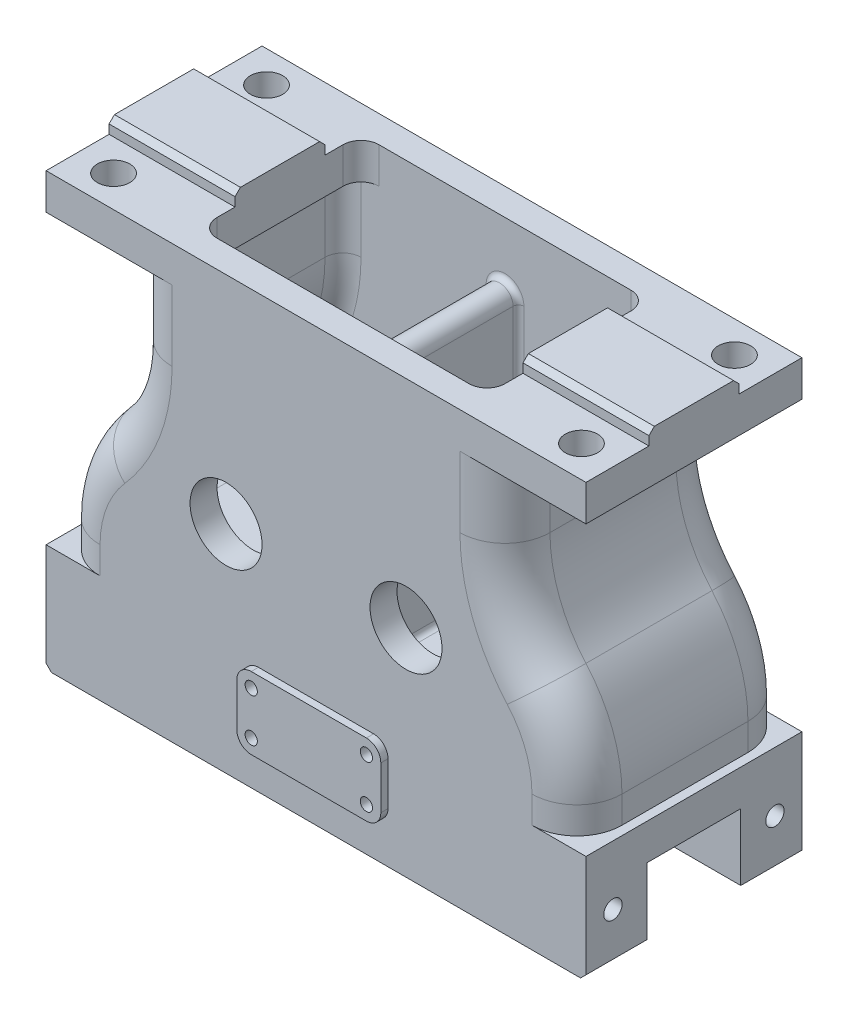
ISO-10303-21;
HEADER;
FILE_DESCRIPTION(('STEP AP214'),'2;1');
FILE_NAME('part.step','',(''),(''),'','','');
FILE_SCHEMA(('AUTOMOTIVE_DESIGN { 1 0 10303 214 1 1 1 1 }'));
ENDSEC;
DATA;
#1=APPLICATION_CONTEXT('core data for automotive mechanical design processes');
#2=APPLICATION_PROTOCOL_DEFINITION('international standard','automotive_design',2000,#1);
#3=PRODUCT_CONTEXT('',#1,'mechanical');
#4=PRODUCT('Part','Part','',(#3));
#5=PRODUCT_RELATED_PRODUCT_CATEGORY('part','',(#4));
#6=PRODUCT_DEFINITION_FORMATION('','',#4);
#7=PRODUCT_DEFINITION_CONTEXT('part definition',#1,'design');
#8=PRODUCT_DEFINITION('design','',#6,#7);
#9=PRODUCT_DEFINITION_SHAPE('','',#8);
#10=(LENGTH_UNIT() NAMED_UNIT(*) SI_UNIT(.MILLI.,.METRE.));
#11=(NAMED_UNIT(*) PLANE_ANGLE_UNIT() SI_UNIT($,.RADIAN.));
#12=(NAMED_UNIT(*) SI_UNIT($,.STERADIAN.) SOLID_ANGLE_UNIT());
#13=UNCERTAINTY_MEASURE_WITH_UNIT(LENGTH_MEASURE(1.E-05),#10,'distance_accuracy_value','');
#14=(GEOMETRIC_REPRESENTATION_CONTEXT(3) GLOBAL_UNCERTAINTY_ASSIGNED_CONTEXT((#13)) GLOBAL_UNIT_ASSIGNED_CONTEXT((#10,
#11,#12)) REPRESENTATION_CONTEXT('',''));
#15=CARTESIAN_POINT('',(0.,0.,0.));
#16=DIRECTION('',(0.,0.,1.));
#17=DIRECTION('',(1.,0.,0.));
#18=AXIS2_PLACEMENT_3D('',#15,#16,#17);
#19=CARTESIAN_POINT('',(0.,0.,60.));
#20=DIRECTION('',(0.,0.,1.));
#21=DIRECTION('',(1.,0.,0.));
#22=AXIS2_PLACEMENT_3D('',#19,#20,#21);
#23=PLANE('',#22);
#24=CARTESIAN_POINT('',(50.,60.,60.));
#25=DIRECTION('',(0.,0.,1.));
#26=DIRECTION('',(1.,0.,0.));
#27=AXIS2_PLACEMENT_3D('',#24,#25,#26);
#28=CIRCLE('',#27,20.);
#29=CARTESIAN_POINT('',(70.,60.,60.));
#30=VERTEX_POINT('',#29);
#31=EDGE_CURVE('E875',#30,#30,#28,.T.);
#32=ORIENTED_EDGE('',*,*,#31,.F.);
#33=EDGE_LOOP('',(#32));
#34=FACE_BOUND('',#33,.T.);
#35=CARTESIAN_POINT('',(-50.,60.,60.));
#36=DIRECTION('',(0.,0.,1.));
#37=DIRECTION('',(-1.,0.,0.));
#38=AXIS2_PLACEMENT_3D('',#35,#36,#37);
#39=CIRCLE('',#38,20.);
#40=CARTESIAN_POINT('',(-70.,60.,60.));
#41=VERTEX_POINT('',#40);
#42=EDGE_CURVE('E874',#41,#41,#39,.T.);
#43=ORIENTED_EDGE('',*,*,#42,.F.);
#44=EDGE_LOOP('',(#43));
#45=FACE_BOUND('',#44,.T.);
#46=DIRECTION('',(-1.,0.,0.));
#47=VECTOR('',#46,1.);
#48=CARTESIAN_POINT('',(150.,-60.,60.));
#49=LINE('',#48,#47);
#50=CARTESIAN_POINT('',(147.,-60.,60.));
#51=VERTEX_POINT('',#50);
#52=CARTESIAN_POINT('',(-147.,-60.,60.));
#53=VERTEX_POINT('',#52);
#54=EDGE_CURVE('E853',#51,#53,#49,.T.);
#55=ORIENTED_EDGE('',*,*,#54,.F.);
#56=DIRECTION('',(0.707106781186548,0.707106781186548,0.));
#57=VECTOR('',#56,1.);
#58=CARTESIAN_POINT('',(103.5,-103.5,60.));
#59=LINE('',#58,#57);
#60=CARTESIAN_POINT('',(150.,-56.9999999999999,60.));
#61=VERTEX_POINT('',#60);
#62=EDGE_CURVE('E1815',#51,#61,#59,.T.);
#63=ORIENTED_EDGE('',*,*,#62,.T.);
#64=DIRECTION('',(0.,-1.,0.));
#65=VECTOR('',#64,1.);
#66=CARTESIAN_POINT('',(150.,0.,60.));
#67=LINE('',#66,#65);
#68=CARTESIAN_POINT('',(150.,0.,60.));
#69=VERTEX_POINT('',#68);
#70=EDGE_CURVE('E820',#69,#61,#67,.T.);
#71=ORIENTED_EDGE('',*,*,#70,.F.);
#72=DIRECTION('',(-1.,0.,0.));
#73=VECTOR('',#72,1.);
#74=CARTESIAN_POINT('',(150.,0.,60.));
#75=LINE('',#74,#73);
#76=CARTESIAN_POINT('',(120.,0.,60.));
#77=VERTEX_POINT('',#76);
#78=EDGE_CURVE('E858',#69,#77,#75,.T.);
#79=ORIENTED_EDGE('',*,*,#78,.T.);
#80=DIRECTION('',(0.,1.,0.));
#81=VECTOR('',#80,1.);
#82=CARTESIAN_POINT('',(120.,15.0000000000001,60.));
#83=LINE('',#82,#81);
#84=CARTESIAN_POINT('',(120.,15.0000000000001,60.));
#85=VERTEX_POINT('',#84);
#86=EDGE_CURVE('E1245',#77,#85,#83,.T.);
#87=ORIENTED_EDGE('',*,*,#86,.T.);
#88=CARTESIAN_POINT('',(65.,15.,60.));
#89=DIRECTION('',(0.,0.,1.));
#90=DIRECTION('',(1.,0.,0.));
#91=AXIS2_PLACEMENT_3D('',#88,#89,#90);
#92=CIRCLE('',#91,55.);
#93=CARTESIAN_POINT('',(106.25,51.3790805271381,60.));
#94=VERTEX_POINT('',#93);
#95=EDGE_CURVE('E1242',#85,#94,#92,.T.);
#96=ORIENTED_EDGE('',*,*,#95,.T.);
#97=CARTESIAN_POINT('',(185.,120.830052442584,60.));
#98=DIRECTION('',(0.,0.,1.));
#99=DIRECTION('',(1.,0.,0.));
#100=AXIS2_PLACEMENT_3D('',#97,#98,#99);
#101=CIRCLE('',#100,105.);
#102=CARTESIAN_POINT('',(80.,120.830052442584,60.));
#103=VERTEX_POINT('',#102);
#104=EDGE_CURVE('E1236',#94,#103,#101,.F.);
#105=ORIENTED_EDGE('',*,*,#104,.T.);
#106=DIRECTION('',(0.,1.,0.));
#107=VECTOR('',#106,1.);
#108=CARTESIAN_POINT('',(80.,160.,60.));
#109=LINE('',#108,#107);
#110=CARTESIAN_POINT('',(80.,160.,60.));
#111=VERTEX_POINT('',#110);
#112=EDGE_CURVE('E1239',#103,#111,#109,.T.);
#113=ORIENTED_EDGE('',*,*,#112,.T.);
#114=DIRECTION('',(1.,0.,0.));
#115=VECTOR('',#114,1.);
#116=CARTESIAN_POINT('',(-150.,160.,60.));
#117=LINE('',#116,#115);
#118=CARTESIAN_POINT('',(150.,160.,60.));
#119=VERTEX_POINT('',#118);
#120=EDGE_CURVE('E1115',#111,#119,#117,.T.);
#121=ORIENTED_EDGE('',*,*,#120,.T.);
#122=DIRECTION('',(0.,-1.,0.));
#123=VECTOR('',#122,1.);
#124=CARTESIAN_POINT('',(150.,180.,60.));
#125=LINE('',#124,#123);
#126=CARTESIAN_POINT('',(150.,180.,60.));
#127=VERTEX_POINT('',#126);
#128=EDGE_CURVE('E1135',#127,#119,#125,.T.);
#129=ORIENTED_EDGE('',*,*,#128,.F.);
#130=DIRECTION('',(1.,0.,0.));
#131=VECTOR('',#130,1.);
#132=CARTESIAN_POINT('',(-150.,180.,60.));
#133=LINE('',#132,#131);
#134=CARTESIAN_POINT('',(-150.,180.,60.));
#135=VERTEX_POINT('',#134);
#136=EDGE_CURVE('E1099',#135,#127,#133,.T.);
#137=ORIENTED_EDGE('',*,*,#136,.F.);
#138=DIRECTION('',(0.,-1.,0.));
#139=VECTOR('',#138,1.);
#140=CARTESIAN_POINT('',(-150.,180.,60.));
#141=LINE('',#140,#139);
#142=CARTESIAN_POINT('',(-150.,160.,60.));
#143=VERTEX_POINT('',#142);
#144=EDGE_CURVE('E1139',#135,#143,#141,.T.);
#145=ORIENTED_EDGE('',*,*,#144,.T.);
#146=CARTESIAN_POINT('',(-80.,160.,60.));
#147=VERTEX_POINT('',#146);
#148=EDGE_CURVE('E1116',#143,#147,#117,.T.);
#149=ORIENTED_EDGE('',*,*,#148,.T.);
#150=DIRECTION('',(0.,1.,0.));
#151=VECTOR('',#150,1.);
#152=CARTESIAN_POINT('',(-79.9999999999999,0.,60.));
#153=LINE('',#152,#151);
#154=CARTESIAN_POINT('',(-80.,120.830052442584,60.));
#155=VERTEX_POINT('',#154);
#156=EDGE_CURVE('E1223',#147,#155,#153,.F.);
#157=ORIENTED_EDGE('',*,*,#156,.T.);
#158=CARTESIAN_POINT('',(-185.,120.830052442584,60.));
#159=DIRECTION('',(0.,0.,1.));
#160=DIRECTION('',(1.,0.,0.));
#161=AXIS2_PLACEMENT_3D('',#158,#159,#160);
#162=CIRCLE('',#161,105.);
#163=CARTESIAN_POINT('',(-106.25,51.3790805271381,60.));
#164=VERTEX_POINT('',#163);
#165=EDGE_CURVE('E1226',#155,#164,#162,.F.);
#166=ORIENTED_EDGE('',*,*,#165,.T.);
#167=CARTESIAN_POINT('',(-65.,15.,60.));
#168=DIRECTION('',(0.,0.,1.));
#169=DIRECTION('',(1.,0.,0.));
#170=AXIS2_PLACEMENT_3D('',#167,#168,#169);
#171=CIRCLE('',#170,55.);
#172=CARTESIAN_POINT('',(-120.,15.,60.));
#173=VERTEX_POINT('',#172);
#174=EDGE_CURVE('E1229',#164,#173,#171,.T.);
#175=ORIENTED_EDGE('',*,*,#174,.T.);
#176=DIRECTION('',(0.,-1.,0.));
#177=VECTOR('',#176,1.);
#178=CARTESIAN_POINT('',(-120.,0.,60.));
#179=LINE('',#178,#177);
#180=CARTESIAN_POINT('',(-120.,0.,60.));
#181=VERTEX_POINT('',#180);
#182=EDGE_CURVE('E1232',#173,#181,#179,.T.);
#183=ORIENTED_EDGE('',*,*,#182,.T.);
#184=CARTESIAN_POINT('',(-150.,0.,60.));
#185=VERTEX_POINT('',#184);
#186=EDGE_CURVE('E857',#181,#185,#75,.T.);
#187=ORIENTED_EDGE('',*,*,#186,.T.);
#188=DIRECTION('',(0.,-1.,0.));
#189=VECTOR('',#188,1.);
#190=CARTESIAN_POINT('',(-150.,0.,60.));
#191=LINE('',#190,#189);
#192=CARTESIAN_POINT('',(-150.,-56.9999999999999,60.));
#193=VERTEX_POINT('',#192);
#194=EDGE_CURVE('E844',#185,#193,#191,.T.);
#195=ORIENTED_EDGE('',*,*,#194,.T.);
#196=DIRECTION('',(-0.707106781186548,0.707106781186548,0.));
#197=VECTOR('',#196,1.);
#198=CARTESIAN_POINT('',(-103.5,-103.5,60.));
#199=LINE('',#198,#197);
#200=EDGE_CURVE('E1812',#193,#53,#199,.F.);
#201=ORIENTED_EDGE('',*,*,#200,.T.);
#202=EDGE_LOOP('',(#55,#63,#71,#79,#87,#96,#105,#113,#121,#129,#137,#145,#149,#157,#166,#175,
#183,#187,#195,#201));
#203=FACE_BOUND('',#202,.T.);
#204=DIRECTION('',(1.,0.,0.));
#205=VECTOR('',#204,1.);
#206=CARTESIAN_POINT('',(-32.,-40.,60.));
#207=LINE('',#206,#205);
#208=CARTESIAN_POINT('',(-32.,-40.,60.));
#209=VERTEX_POINT('',#208);
#210=CARTESIAN_POINT('',(32.,-40.,60.));
#211=VERTEX_POINT('',#210);
#212=EDGE_CURVE('E756',#209,#211,#207,.T.);
#213=ORIENTED_EDGE('',*,*,#212,.F.);
#214=CARTESIAN_POINT('',(-32.,-32.,60.));
#215=DIRECTION('',(0.,0.,1.));
#216=DIRECTION('',(1.,0.,0.));
#217=AXIS2_PLACEMENT_3D('',#214,#215,#216);
#218=CIRCLE('',#217,8.);
#219=CARTESIAN_POINT('',(-40.,-32.,60.));
#220=VERTEX_POINT('',#219);
#221=EDGE_CURVE('E725',#220,#209,#218,.T.);
#222=ORIENTED_EDGE('',*,*,#221,.F.);
#223=DIRECTION('',(0.,-1.,0.));
#224=VECTOR('',#223,1.);
#225=CARTESIAN_POINT('',(-40.,-7.99999999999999,60.));
#226=LINE('',#225,#224);
#227=CARTESIAN_POINT('',(-40.,-7.99999999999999,60.));
#228=VERTEX_POINT('',#227);
#229=EDGE_CURVE('E731',#228,#220,#226,.T.);
#230=ORIENTED_EDGE('',*,*,#229,.F.);
#231=CARTESIAN_POINT('',(-32.,-7.99999999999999,60.));
#232=DIRECTION('',(0.,0.,1.));
#233=DIRECTION('',(1.,0.,0.));
#234=AXIS2_PLACEMENT_3D('',#231,#232,#233);
#235=CIRCLE('',#234,7.99999999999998);
#236=CARTESIAN_POINT('',(-32.,0.,60.));
#237=VERTEX_POINT('',#236);
#238=EDGE_CURVE('E771',#237,#228,#235,.T.);
#239=ORIENTED_EDGE('',*,*,#238,.F.);
#240=DIRECTION('',(-1.,0.,0.));
#241=VECTOR('',#240,1.);
#242=CARTESIAN_POINT('',(-32.,0.,60.));
#243=LINE('',#242,#241);
#244=CARTESIAN_POINT('',(32.,0.,60.));
#245=VERTEX_POINT('',#244);
#246=EDGE_CURVE('E768',#245,#237,#243,.T.);
#247=ORIENTED_EDGE('',*,*,#246,.F.);
#248=CARTESIAN_POINT('',(32.,-7.99999999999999,60.));
#249=DIRECTION('',(0.,0.,1.));
#250=DIRECTION('',(-1.,0.,0.));
#251=AXIS2_PLACEMENT_3D('',#248,#249,#250);
#252=CIRCLE('',#251,7.99999999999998);
#253=CARTESIAN_POINT('',(40.,-7.99999999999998,60.));
#254=VERTEX_POINT('',#253);
#255=EDGE_CURVE('E765',#254,#245,#252,.T.);
#256=ORIENTED_EDGE('',*,*,#255,.F.);
#257=DIRECTION('',(0.,1.,0.));
#258=VECTOR('',#257,1.);
#259=CARTESIAN_POINT('',(40.,-7.99999999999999,60.));
#260=LINE('',#259,#258);
#261=CARTESIAN_POINT('',(40.,-32.,60.));
#262=VERTEX_POINT('',#261);
#263=EDGE_CURVE('E762',#262,#254,#260,.T.);
#264=ORIENTED_EDGE('',*,*,#263,.F.);
#265=CARTESIAN_POINT('',(32.,-32.,60.));
#266=DIRECTION('',(0.,0.,1.));
#267=DIRECTION('',(1.,0.,0.));
#268=AXIS2_PLACEMENT_3D('',#265,#266,#267);
#269=CIRCLE('',#268,7.99999999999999);
#270=EDGE_CURVE('E759',#211,#262,#269,.T.);
#271=ORIENTED_EDGE('',*,*,#270,.F.);
#272=EDGE_LOOP('',(#213,#222,#230,#239,#247,#256,#264,#271));
#273=FACE_BOUND('',#272,.T.);
#274=ADVANCED_FACE('F46',(#34,#45,#203,#273),#23,.T.);
#275=CARTESIAN_POINT('',(-130.,-0.001000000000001,-42.5));
#276=DIRECTION('',(0.,1.,0.));
#277=DIRECTION('',(0.,0.,1.));
#278=AXIS2_PLACEMENT_3D('',#275,#276,#277);
#279=CYLINDRICAL_SURFACE('',#278,9.00000000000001);
#280=CARTESIAN_POINT('',(-130.,180.,-42.5));
#281=DIRECTION('',(0.,1.,0.));
#282=DIRECTION('',(0.,0.,-1.));
#283=AXIS2_PLACEMENT_3D('',#280,#281,#282);
#284=CIRCLE('',#283,9.00000000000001);
#285=CARTESIAN_POINT('',(-130.,180.,-51.5));
#286=VERTEX_POINT('',#285);
#287=EDGE_CURVE('E948',#286,#286,#284,.T.);
#288=ORIENTED_EDGE('',*,*,#287,.T.);
#289=EDGE_LOOP('',(#288));
#290=FACE_BOUND('',#289,.T.);
#291=CARTESIAN_POINT('',(-130.,163.,-42.5));
#292=DIRECTION('',(0.,-1.,0.));
#293=DIRECTION('',(0.,0.,-1.));
#294=AXIS2_PLACEMENT_3D('',#291,#292,#293);
#295=CIRCLE('',#294,9.00000000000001);
#296=CARTESIAN_POINT('',(-130.,163.,-51.5));
#297=VERTEX_POINT('',#296);
#298=EDGE_CURVE('E1789',#297,#297,#295,.F.);
#299=ORIENTED_EDGE('',*,*,#298,.F.);
#300=EDGE_LOOP('',(#299));
#301=FACE_BOUND('',#300,.T.);
#302=ADVANCED_FACE('F2157',(#290,#301),#279,.F.);
#303=CARTESIAN_POINT('',(130.,-0.001000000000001,42.5));
#304=DIRECTION('',(0.,1.,0.));
#305=DIRECTION('',(0.,0.,1.));
#306=AXIS2_PLACEMENT_3D('',#303,#304,#305);
#307=CYLINDRICAL_SURFACE('',#306,9.00000000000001);
#308=CARTESIAN_POINT('',(130.,180.,42.5));
#309=DIRECTION('',(0.,1.,0.));
#310=DIRECTION('',(0.,0.,-1.));
#311=AXIS2_PLACEMENT_3D('',#308,#309,#310);
#312=CIRCLE('',#311,9.00000000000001);
#313=CARTESIAN_POINT('',(130.,180.,33.5));
#314=VERTEX_POINT('',#313);
#315=EDGE_CURVE('E939',#314,#314,#312,.T.);
#316=ORIENTED_EDGE('',*,*,#315,.T.);
#317=EDGE_LOOP('',(#316));
#318=FACE_BOUND('',#317,.T.);
#319=CARTESIAN_POINT('',(130.,163.,42.5));
#320=DIRECTION('',(0.,-1.,0.));
#321=DIRECTION('',(0.,0.,-1.));
#322=AXIS2_PLACEMENT_3D('',#319,#320,#321);
#323=CIRCLE('',#322,9.00000000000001);
#324=CARTESIAN_POINT('',(130.,163.,33.5));
#325=VERTEX_POINT('',#324);
#326=EDGE_CURVE('E935',#325,#325,#323,.F.);
#327=ORIENTED_EDGE('',*,*,#326,.F.);
#328=EDGE_LOOP('',(#327));
#329=FACE_BOUND('',#328,.T.);
#330=ADVANCED_FACE('F2163',(#318,#329),#307,.F.);
#331=CARTESIAN_POINT('',(0.,180.,0.));
#332=DIRECTION('',(0.,1.,0.));
#333=DIRECTION('',(0.,0.,1.));
#334=AXIS2_PLACEMENT_3D('',#331,#332,#333);
#335=PLANE('',#334);
#336=CARTESIAN_POINT('',(-130.,180.,42.5));
#337=DIRECTION('',(0.,1.,0.));
#338=DIRECTION('',(0.,0.,1.));
#339=AXIS2_PLACEMENT_3D('',#336,#337,#338);
#340=CIRCLE('',#339,9.00000000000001);
#341=CARTESIAN_POINT('',(-130.,180.,51.5));
#342=VERTEX_POINT('',#341);
#343=EDGE_CURVE('E944',#342,#342,#340,.T.);
#344=ORIENTED_EDGE('',*,*,#343,.F.);
#345=EDGE_LOOP('',(#344));
#346=FACE_BOUND('',#345,.T.);
#347=ORIENTED_EDGE('',*,*,#315,.F.);
#348=EDGE_LOOP('',(#347));
#349=FACE_BOUND('',#348,.T.);
#350=DIRECTION('',(0.,0.,-1.));
#351=VECTOR('',#350,1.);
#352=CARTESIAN_POINT('',(150.,180.,-60.));
#353=LINE('',#352,#351);
#354=CARTESIAN_POINT('',(150.,180.,25.));
#355=VERTEX_POINT('',#354);
#356=EDGE_CURVE('E1104',#127,#355,#353,.T.);
#357=ORIENTED_EDGE('',*,*,#356,.T.);
#358=DIRECTION('',(1.,0.,0.));
#359=VECTOR('',#358,1.);
#360=CARTESIAN_POINT('',(80.,180.,25.));
#361=LINE('',#360,#359);
#362=CARTESIAN_POINT('',(80.,180.,25.));
#363=VERTEX_POINT('',#362);
#364=EDGE_CURVE('E956',#363,#355,#361,.T.);
#365=ORIENTED_EDGE('',*,*,#364,.F.);
#366=DIRECTION('',(0.,0.,-1.));
#367=VECTOR('',#366,1.);
#368=CARTESIAN_POINT('',(80.,180.,-35.));
#369=LINE('',#368,#367);
#370=CARTESIAN_POINT('',(80.,180.,35.));
#371=VERTEX_POINT('',#370);
#372=EDGE_CURVE('E1039',#371,#363,#369,.T.);
#373=ORIENTED_EDGE('',*,*,#372,.F.);
#374=CARTESIAN_POINT('',(70.,180.,35.));
#375=DIRECTION('',(0.,1.,0.));
#376=DIRECTION('',(0.,0.,1.));
#377=AXIS2_PLACEMENT_3D('',#374,#375,#376);
#378=CIRCLE('',#377,10.);
#379=CARTESIAN_POINT('',(70.,180.,45.));
#380=VERTEX_POINT('',#379);
#381=EDGE_CURVE('E1034',#380,#371,#378,.T.);
#382=ORIENTED_EDGE('',*,*,#381,.F.);
#383=DIRECTION('',(1.,0.,0.));
#384=VECTOR('',#383,1.);
#385=CARTESIAN_POINT('',(-70.,180.,45.));
#386=LINE('',#385,#384);
#387=CARTESIAN_POINT('',(-70.,180.,45.));
#388=VERTEX_POINT('',#387);
#389=EDGE_CURVE('E1031',#388,#380,#386,.T.);
#390=ORIENTED_EDGE('',*,*,#389,.F.);
#391=CARTESIAN_POINT('',(-70.,180.,35.));
#392=DIRECTION('',(0.,1.,0.));
#393=DIRECTION('',(0.,0.,1.));
#394=AXIS2_PLACEMENT_3D('',#391,#392,#393);
#395=CIRCLE('',#394,10.);
#396=CARTESIAN_POINT('',(-80.,180.,35.));
#397=VERTEX_POINT('',#396);
#398=EDGE_CURVE('E1028',#397,#388,#395,.T.);
#399=ORIENTED_EDGE('',*,*,#398,.F.);
#400=DIRECTION('',(0.,0.,1.));
#401=VECTOR('',#400,1.);
#402=CARTESIAN_POINT('',(-80.,180.,-35.));
#403=LINE('',#402,#401);
#404=CARTESIAN_POINT('',(-80.,180.,25.));
#405=VERTEX_POINT('',#404);
#406=EDGE_CURVE('E1023',#405,#397,#403,.T.);
#407=ORIENTED_EDGE('',*,*,#406,.F.);
#408=DIRECTION('',(1.,0.,0.));
#409=VECTOR('',#408,1.);
#410=CARTESIAN_POINT('',(-150.,180.,25.));
#411=LINE('',#410,#409);
#412=CARTESIAN_POINT('',(-150.,180.,25.));
#413=VERTEX_POINT('',#412);
#414=EDGE_CURVE('E984',#413,#405,#411,.T.);
#415=ORIENTED_EDGE('',*,*,#414,.F.);
#416=DIRECTION('',(0.,0.,1.));
#417=VECTOR('',#416,1.);
#418=CARTESIAN_POINT('',(-150.,180.,-60.));
#419=LINE('',#418,#417);
#420=EDGE_CURVE('E1100',#413,#135,#419,.T.);
#421=ORIENTED_EDGE('',*,*,#420,.T.);
#422=ORIENTED_EDGE('',*,*,#136,.T.);
#423=EDGE_LOOP('',(#357,#365,#373,#382,#390,#399,#407,#415,#421,#422));
#424=FACE_BOUND('',#423,.T.);
#425=ADVANCED_FACE('F3272',(#346,#349,#424),#335,.T.);
#426=ORIENTED_EDGE('',*,*,#287,.F.);
#427=EDGE_LOOP('',(#426));
#428=FACE_BOUND('',#427,.T.);
#429=CARTESIAN_POINT('',(130.,180.,-42.5));
#430=DIRECTION('',(0.,1.,0.));
#431=DIRECTION('',(0.,0.,1.));
#432=AXIS2_PLACEMENT_3D('',#429,#430,#431);
#433=CIRCLE('',#432,9.00000000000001);
#434=CARTESIAN_POINT('',(130.,180.,-33.5));
#435=VERTEX_POINT('',#434);
#436=EDGE_CURVE('E943',#435,#435,#433,.T.);
#437=ORIENTED_EDGE('',*,*,#436,.F.);
#438=EDGE_LOOP('',(#437));
#439=FACE_BOUND('',#438,.T.);
#440=CARTESIAN_POINT('',(80.,180.,-25.));
#441=VERTEX_POINT('',#440);
#442=CARTESIAN_POINT('',(80.,180.,-35.));
#443=VERTEX_POINT('',#442);
#444=EDGE_CURVE('E1038',#441,#443,#369,.T.);
#445=ORIENTED_EDGE('',*,*,#444,.F.);
#446=DIRECTION('',(-1.,0.,0.));
#447=VECTOR('',#446,1.);
#448=CARTESIAN_POINT('',(80.,180.,-25.));
#449=LINE('',#448,#447);
#450=CARTESIAN_POINT('',(150.,180.,-25.));
#451=VERTEX_POINT('',#450);
#452=EDGE_CURVE('E962',#451,#441,#449,.T.);
#453=ORIENTED_EDGE('',*,*,#452,.F.);
#454=CARTESIAN_POINT('',(150.,180.,-60.));
#455=VERTEX_POINT('',#454);
#456=EDGE_CURVE('E1103',#451,#455,#353,.T.);
#457=ORIENTED_EDGE('',*,*,#456,.T.);
#458=DIRECTION('',(-1.,0.,0.));
#459=VECTOR('',#458,1.);
#460=CARTESIAN_POINT('',(-150.,180.,-60.));
#461=LINE('',#460,#459);
#462=CARTESIAN_POINT('',(-150.,180.,-60.));
#463=VERTEX_POINT('',#462);
#464=EDGE_CURVE('E1108',#455,#463,#461,.T.);
#465=ORIENTED_EDGE('',*,*,#464,.T.);
#466=CARTESIAN_POINT('',(-150.,180.,-25.));
#467=VERTEX_POINT('',#466);
#468=EDGE_CURVE('E1095',#463,#467,#419,.T.);
#469=ORIENTED_EDGE('',*,*,#468,.T.);
#470=DIRECTION('',(-1.,0.,0.));
#471=VECTOR('',#470,1.);
#472=CARTESIAN_POINT('',(-150.,180.,-25.));
#473=LINE('',#472,#471);
#474=CARTESIAN_POINT('',(-80.,180.,-25.));
#475=VERTEX_POINT('',#474);
#476=EDGE_CURVE('E990',#475,#467,#473,.T.);
#477=ORIENTED_EDGE('',*,*,#476,.F.);
#478=CARTESIAN_POINT('',(-80.,180.,-35.));
#479=VERTEX_POINT('',#478);
#480=EDGE_CURVE('E1024',#479,#475,#403,.T.);
#481=ORIENTED_EDGE('',*,*,#480,.F.);
#482=CARTESIAN_POINT('',(-70.,180.,-35.));
#483=DIRECTION('',(0.,1.,0.));
#484=DIRECTION('',(0.,0.,1.));
#485=AXIS2_PLACEMENT_3D('',#482,#483,#484);
#486=CIRCLE('',#485,10.);
#487=CARTESIAN_POINT('',(-70.,180.,-45.));
#488=VERTEX_POINT('',#487);
#489=EDGE_CURVE('E1020',#488,#479,#486,.T.);
#490=ORIENTED_EDGE('',*,*,#489,.F.);
#491=DIRECTION('',(-1.,0.,0.));
#492=VECTOR('',#491,1.);
#493=CARTESIAN_POINT('',(-70.,180.,-45.));
#494=LINE('',#493,#492);
#495=CARTESIAN_POINT('',(70.,180.,-45.));
#496=VERTEX_POINT('',#495);
#497=EDGE_CURVE('E1016',#496,#488,#494,.T.);
#498=ORIENTED_EDGE('',*,*,#497,.F.);
#499=CARTESIAN_POINT('',(70.,180.,-35.));
#500=DIRECTION('',(0.,1.,0.));
#501=DIRECTION('',(0.,0.,-1.));
#502=AXIS2_PLACEMENT_3D('',#499,#500,#501);
#503=CIRCLE('',#502,10.);
#504=EDGE_CURVE('E1013',#443,#496,#503,.T.);
#505=ORIENTED_EDGE('',*,*,#504,.F.);
#506=EDGE_LOOP('',(#445,#453,#457,#465,#469,#477,#481,#490,#498,#505));
#507=FACE_BOUND('',#506,.T.);
#508=ADVANCED_FACE('F2099',(#428,#439,#507),#335,.T.);
#509=CARTESIAN_POINT('',(0.,10.,60.));
#510=DIRECTION('',(0.,1.,0.));
#511=DIRECTION('',(-1.,0.,0.));
#512=AXIS2_PLACEMENT_3D('',#509,#510,#511);
#513=PLANE('',#512);
#514=DIRECTION('',(1.,0.,0.));
#515=VECTOR('',#514,1.);
#516=CARTESIAN_POINT('',(0.,10.,35.));
#517=LINE('',#516,#515);
#518=CARTESIAN_POINT('',(-119.772255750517,10.,35.));
#519=VERTEX_POINT('',#518);
#520=CARTESIAN_POINT('',(-10.5,10.,35.));
#521=VERTEX_POINT('',#520);
#522=EDGE_CURVE('E1576',#519,#521,#517,.T.);
#523=ORIENTED_EDGE('',*,*,#522,.T.);
#524=DIRECTION('',(0.,0.,-1.));
#525=VECTOR('',#524,1.);
#526=CARTESIAN_POINT('',(-10.5,10.,60.));
#527=LINE('',#526,#525);
#528=CARTESIAN_POINT('',(-10.5,10.,-35.));
#529=VERTEX_POINT('',#528);
#530=EDGE_CURVE('E1670',#521,#529,#527,.T.);
#531=ORIENTED_EDGE('',*,*,#530,.T.);
#532=DIRECTION('',(1.,0.,0.));
#533=VECTOR('',#532,1.);
#534=CARTESIAN_POINT('',(-119.772255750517,10.,-35.));
#535=LINE('',#534,#533);
#536=CARTESIAN_POINT('',(-119.772255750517,10.,-35.));
#537=VERTEX_POINT('',#536);
#538=EDGE_CURVE('E1573',#529,#537,#535,.F.);
#539=ORIENTED_EDGE('',*,*,#538,.T.);
#540=DIRECTION('',(0.,0.,-1.));
#541=VECTOR('',#540,1.);
#542=CARTESIAN_POINT('',(-119.772255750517,10.,60.));
#543=LINE('',#542,#541);
#544=EDGE_CURVE('E1475',#537,#519,#543,.F.);
#545=ORIENTED_EDGE('',*,*,#544,.T.);
#546=EDGE_LOOP('',(#523,#531,#539,#545));
#547=FACE_BOUND('',#546,.T.);
#548=ADVANCED_FACE('F2281',(#547),#513,.T.);
#549=DIRECTION('',(1.,0.,0.));
#550=VECTOR('',#549,1.);
#551=CARTESIAN_POINT('',(7.5,10.,-35.));
#552=LINE('',#551,#550);
#553=CARTESIAN_POINT('',(119.772255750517,10.,-35.));
#554=VERTEX_POINT('',#553);
#555=CARTESIAN_POINT('',(10.5,10.,-35.));
#556=VERTEX_POINT('',#555);
#557=EDGE_CURVE('E1547',#554,#556,#552,.F.);
#558=ORIENTED_EDGE('',*,*,#557,.T.);
#559=DIRECTION('',(0.,0.,-1.));
#560=VECTOR('',#559,1.);
#561=CARTESIAN_POINT('',(10.5,10.,60.));
#562=LINE('',#561,#560);
#563=CARTESIAN_POINT('',(10.5,10.,35.));
#564=VERTEX_POINT('',#563);
#565=EDGE_CURVE('E1631',#556,#564,#562,.F.);
#566=ORIENTED_EDGE('',*,*,#565,.T.);
#567=DIRECTION('',(1.,0.,0.));
#568=VECTOR('',#567,1.);
#569=CARTESIAN_POINT('',(0.,10.,35.));
#570=LINE('',#569,#568);
#571=CARTESIAN_POINT('',(119.772255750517,10.,35.));
#572=VERTEX_POINT('',#571);
#573=EDGE_CURVE('E1554',#564,#572,#570,.T.);
#574=ORIENTED_EDGE('',*,*,#573,.T.);
#575=DIRECTION('',(0.,0.,1.));
#576=VECTOR('',#575,1.);
#577=CARTESIAN_POINT('',(119.772255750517,10.,-35.));
#578=LINE('',#577,#576);
#579=EDGE_CURVE('E1551',#572,#554,#578,.F.);
#580=ORIENTED_EDGE('',*,*,#579,.T.);
#581=EDGE_LOOP('',(#558,#566,#574,#580));
#582=FACE_BOUND('',#581,.T.);
#583=ADVANCED_FACE('F2060',(#582),#513,.T.);
#584=CARTESIAN_POINT('',(0.,0.,45.));
#585=DIRECTION('',(0.,0.,1.));
#586=DIRECTION('',(1.,0.,0.));
#587=AXIS2_PLACEMENT_3D('',#584,#585,#586);
#588=PLANE('',#587);
#589=CARTESIAN_POINT('',(50.,60.,45.));
#590=DIRECTION('',(0.,0.,1.));
#591=DIRECTION('',(1.,0.,0.));
#592=AXIS2_PLACEMENT_3D('',#589,#590,#591);
#593=CIRCLE('',#592,20.);
#594=CARTESIAN_POINT('',(70.,60.,45.));
#595=VERTEX_POINT('',#594);
#596=EDGE_CURVE('E902',#595,#595,#593,.T.);
#597=ORIENTED_EDGE('',*,*,#596,.T.);
#598=EDGE_LOOP('',(#597));
#599=FACE_BOUND('',#598,.T.);
#600=CARTESIAN_POINT('',(-50.,60.,45.));
#601=DIRECTION('',(0.,0.,1.));
#602=DIRECTION('',(1.,0.,0.));
#603=AXIS2_PLACEMENT_3D('',#600,#601,#602);
#604=CIRCLE('',#603,20.);
#605=CARTESIAN_POINT('',(-30.,60.,45.));
#606=VERTEX_POINT('',#605);
#607=EDGE_CURVE('E894',#606,#606,#604,.T.);
#608=ORIENTED_EDGE('',*,*,#607,.T.);
#609=EDGE_LOOP('',(#608));
#610=FACE_BOUND('',#609,.T.);
#611=DIRECTION('',(1.,0.,0.));
#612=VECTOR('',#611,1.);
#613=CARTESIAN_POINT('',(0.,20.,45.));
#614=LINE('',#613,#612);
#615=CARTESIAN_POINT('',(119.772255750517,20.,45.));
#616=VERTEX_POINT('',#615);
#617=CARTESIAN_POINT('',(10.5,20.,45.));
#618=VERTEX_POINT('',#617);
#619=EDGE_CURVE('E1560',#616,#618,#614,.F.);
#620=ORIENTED_EDGE('',*,*,#619,.T.);
#621=DIRECTION('',(0.,1.,0.));
#622=VECTOR('',#621,1.);
#623=CARTESIAN_POINT('',(10.5,142.5,45.));
#624=LINE('',#623,#622);
#625=CARTESIAN_POINT('',(10.5,142.5,45.));
#626=VERTEX_POINT('',#625);
#627=EDGE_CURVE('E1643',#618,#626,#624,.T.);
#628=ORIENTED_EDGE('',*,*,#627,.T.);
#629=CARTESIAN_POINT('',(0.,142.5,45.));
#630=DIRECTION('',(0.,0.,1.));
#631=DIRECTION('',(1.,0.,0.));
#632=AXIS2_PLACEMENT_3D('',#629,#630,#631);
#633=CIRCLE('',#632,10.5);
#634=CARTESIAN_POINT('',(-10.5,142.5,45.));
#635=VERTEX_POINT('',#634);
#636=EDGE_CURVE('E1640',#626,#635,#633,.T.);
#637=ORIENTED_EDGE('',*,*,#636,.T.);
#638=DIRECTION('',(0.,-1.,0.));
#639=VECTOR('',#638,1.);
#640=CARTESIAN_POINT('',(-10.5,20.,45.));
#641=LINE('',#640,#639);
#642=CARTESIAN_POINT('',(-10.5,20.,45.));
#643=VERTEX_POINT('',#642);
#644=EDGE_CURVE('E1637',#635,#643,#641,.T.);
#645=ORIENTED_EDGE('',*,*,#644,.T.);
#646=DIRECTION('',(1.,0.,0.));
#647=VECTOR('',#646,1.);
#648=CARTESIAN_POINT('',(0.,20.,45.));
#649=LINE('',#648,#647);
#650=CARTESIAN_POINT('',(-119.772255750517,20.,45.));
#651=VERTEX_POINT('',#650);
#652=EDGE_CURVE('E1557',#643,#651,#649,.F.);
#653=ORIENTED_EDGE('',*,*,#652,.T.);
#654=CARTESIAN_POINT('',(-65.,15.,45.));
#655=DIRECTION('',(0.,0.,1.));
#656=DIRECTION('',(1.,0.,0.));
#657=AXIS2_PLACEMENT_3D('',#654,#655,#656);
#658=CIRCLE('',#657,55.);
#659=CARTESIAN_POINT('',(-106.25,51.3790805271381,45.));
#660=VERTEX_POINT('',#659);
#661=EDGE_CURVE('E1407',#651,#660,#658,.F.);
#662=ORIENTED_EDGE('',*,*,#661,.T.);
#663=CARTESIAN_POINT('',(-185.,120.830052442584,45.));
#664=DIRECTION('',(0.,0.,1.));
#665=DIRECTION('',(1.,0.,0.));
#666=AXIS2_PLACEMENT_3D('',#663,#664,#665);
#667=CIRCLE('',#666,105.);
#668=CARTESIAN_POINT('',(-80.,120.830052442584,45.));
#669=VERTEX_POINT('',#668);
#670=EDGE_CURVE('E1355',#660,#669,#667,.T.);
#671=ORIENTED_EDGE('',*,*,#670,.T.);
#672=DIRECTION('',(0.,1.,0.));
#673=VECTOR('',#672,1.);
#674=CARTESIAN_POINT('',(-80.,160.,45.));
#675=LINE('',#674,#673);
#676=CARTESIAN_POINT('',(-80.,160.,45.));
#677=VERTEX_POINT('',#676);
#678=EDGE_CURVE('E1404',#669,#677,#675,.T.);
#679=ORIENTED_EDGE('',*,*,#678,.T.);
#680=DIRECTION('',(1.,0.,0.));
#681=VECTOR('',#680,1.);
#682=CARTESIAN_POINT('',(0.,160.,45.));
#683=LINE('',#682,#681);
#684=CARTESIAN_POINT('',(-70.,160.,45.));
#685=VERTEX_POINT('',#684);
#686=EDGE_CURVE('E1173',#677,#685,#683,.T.);
#687=ORIENTED_EDGE('',*,*,#686,.T.);
#688=DIRECTION('',(0.,-1.,0.));
#689=VECTOR('',#688,1.);
#690=CARTESIAN_POINT('',(-70.,180.,45.));
#691=LINE('',#690,#689);
#692=EDGE_CURVE('E1076',#388,#685,#691,.T.);
#693=ORIENTED_EDGE('',*,*,#692,.F.);
#694=ORIENTED_EDGE('',*,*,#389,.T.);
#695=DIRECTION('',(0.,-1.,0.));
#696=VECTOR('',#695,1.);
#697=CARTESIAN_POINT('',(70.,180.,45.));
#698=LINE('',#697,#696);
#699=CARTESIAN_POINT('',(70.,160.,45.));
#700=VERTEX_POINT('',#699);
#701=EDGE_CURVE('E1072',#380,#700,#698,.T.);
#702=ORIENTED_EDGE('',*,*,#701,.T.);
#703=CARTESIAN_POINT('',(80.,160.,45.));
#704=VERTEX_POINT('',#703);
#705=EDGE_CURVE('E1179',#700,#704,#683,.T.);
#706=ORIENTED_EDGE('',*,*,#705,.T.);
#707=DIRECTION('',(0.,1.,0.));
#708=VECTOR('',#707,1.);
#709=CARTESIAN_POINT('',(79.9999999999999,0.,45.));
#710=LINE('',#709,#708);
#711=CARTESIAN_POINT('',(80.,120.830052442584,45.));
#712=VERTEX_POINT('',#711);
#713=EDGE_CURVE('E1410',#704,#712,#710,.F.);
#714=ORIENTED_EDGE('',*,*,#713,.T.);
#715=CARTESIAN_POINT('',(185.,120.830052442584,45.));
#716=DIRECTION('',(0.,0.,1.));
#717=DIRECTION('',(1.,0.,0.));
#718=AXIS2_PLACEMENT_3D('',#715,#716,#717);
#719=CIRCLE('',#718,105.);
#720=CARTESIAN_POINT('',(106.25,51.3790805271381,45.));
#721=VERTEX_POINT('',#720);
#722=EDGE_CURVE('E1413',#712,#721,#719,.T.);
#723=ORIENTED_EDGE('',*,*,#722,.T.);
#724=CARTESIAN_POINT('',(65.,15.,45.));
#725=DIRECTION('',(0.,0.,1.));
#726=DIRECTION('',(1.,0.,0.));
#727=AXIS2_PLACEMENT_3D('',#724,#725,#726);
#728=CIRCLE('',#727,55.);
#729=EDGE_CURVE('E1416',#721,#616,#728,.F.);
#730=ORIENTED_EDGE('',*,*,#729,.T.);
#731=EDGE_LOOP('',(#620,#628,#637,#645,#653,#662,#671,#679,#687,#693,#694,#702,#706,#714,#723,#730));
#732=FACE_BOUND('',#731,.T.);
#733=ADVANCED_FACE('F2024',(#599,#610,#732),#588,.F.);
#734=CARTESIAN_POINT('',(0.,0.,-45.));
#735=DIRECTION('',(0.,0.,1.));
#736=DIRECTION('',(1.,0.,0.));
#737=AXIS2_PLACEMENT_3D('',#734,#735,#736);
#738=PLANE('',#737);
#739=CARTESIAN_POINT('',(50.,60.,-45.));
#740=DIRECTION('',(0.,0.,1.));
#741=DIRECTION('',(1.,0.,0.));
#742=AXIS2_PLACEMENT_3D('',#739,#740,#741);
#743=CIRCLE('',#742,20.);
#744=CARTESIAN_POINT('',(70.,60.,-45.));
#745=VERTEX_POINT('',#744);
#746=EDGE_CURVE('E898',#745,#745,#743,.T.);
#747=ORIENTED_EDGE('',*,*,#746,.F.);
#748=EDGE_LOOP('',(#747));
#749=FACE_BOUND('',#748,.T.);
#750=CARTESIAN_POINT('',(-50.,60.,-45.));
#751=DIRECTION('',(0.,0.,1.));
#752=DIRECTION('',(1.,0.,0.));
#753=AXIS2_PLACEMENT_3D('',#750,#751,#752);
#754=CIRCLE('',#753,20.);
#755=CARTESIAN_POINT('',(-30.,60.,-45.));
#756=VERTEX_POINT('',#755);
#757=EDGE_CURVE('E884',#756,#756,#754,.T.);
#758=ORIENTED_EDGE('',*,*,#757,.F.);
#759=EDGE_LOOP('',(#758));
#760=FACE_BOUND('',#759,.T.);
#761=DIRECTION('',(1.,0.,0.));
#762=VECTOR('',#761,1.);
#763=CARTESIAN_POINT('',(-7.5,20.,-45.));
#764=LINE('',#763,#762);
#765=CARTESIAN_POINT('',(-119.772255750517,20.,-45.));
#766=VERTEX_POINT('',#765);
#767=CARTESIAN_POINT('',(-10.5,20.,-45.));
#768=VERTEX_POINT('',#767);
#769=EDGE_CURVE('E1583',#766,#768,#764,.T.);
#770=ORIENTED_EDGE('',*,*,#769,.T.);
#771=DIRECTION('',(0.,-1.,0.));
#772=VECTOR('',#771,1.);
#773=CARTESIAN_POINT('',(-10.5,0.,-45.));
#774=LINE('',#773,#772);
#775=CARTESIAN_POINT('',(-10.5,142.5,-45.));
#776=VERTEX_POINT('',#775);
#777=EDGE_CURVE('E1682',#768,#776,#774,.F.);
#778=ORIENTED_EDGE('',*,*,#777,.T.);
#779=CARTESIAN_POINT('',(0.,142.5,-45.));
#780=DIRECTION('',(0.,0.,1.));
#781=DIRECTION('',(1.,0.,0.));
#782=AXIS2_PLACEMENT_3D('',#779,#780,#781);
#783=CIRCLE('',#782,10.5);
#784=CARTESIAN_POINT('',(10.5,142.5,-45.));
#785=VERTEX_POINT('',#784);
#786=EDGE_CURVE('E1679',#776,#785,#783,.F.);
#787=ORIENTED_EDGE('',*,*,#786,.T.);
#788=DIRECTION('',(0.,1.,0.));
#789=VECTOR('',#788,1.);
#790=CARTESIAN_POINT('',(10.5,0.,-45.));
#791=LINE('',#790,#789);
#792=CARTESIAN_POINT('',(10.5,20.,-45.));
#793=VERTEX_POINT('',#792);
#794=EDGE_CURVE('E1676',#785,#793,#791,.F.);
#795=ORIENTED_EDGE('',*,*,#794,.T.);
#796=DIRECTION('',(1.,0.,0.));
#797=VECTOR('',#796,1.);
#798=CARTESIAN_POINT('',(120.,20.,-45.));
#799=LINE('',#798,#797);
#800=CARTESIAN_POINT('',(119.772255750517,20.,-45.));
#801=VERTEX_POINT('',#800);
#802=EDGE_CURVE('E1580',#793,#801,#799,.T.);
#803=ORIENTED_EDGE('',*,*,#802,.T.);
#804=CARTESIAN_POINT('',(65.,15.,-45.));
#805=DIRECTION('',(0.,0.,1.));
#806=DIRECTION('',(1.,0.,0.));
#807=AXIS2_PLACEMENT_3D('',#804,#805,#806);
#808=CIRCLE('',#807,55.);
#809=CARTESIAN_POINT('',(106.25,51.3790805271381,-45.));
#810=VERTEX_POINT('',#809);
#811=EDGE_CURVE('E1449',#801,#810,#808,.T.);
#812=ORIENTED_EDGE('',*,*,#811,.T.);
#813=CARTESIAN_POINT('',(185.,120.830052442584,-45.));
#814=DIRECTION('',(0.,0.,1.));
#815=DIRECTION('',(1.,0.,0.));
#816=AXIS2_PLACEMENT_3D('',#813,#814,#815);
#817=CIRCLE('',#816,105.);
#818=CARTESIAN_POINT('',(80.,120.830052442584,-45.));
#819=VERTEX_POINT('',#818);
#820=EDGE_CURVE('E1443',#810,#819,#817,.F.);
#821=ORIENTED_EDGE('',*,*,#820,.T.);
#822=DIRECTION('',(0.,1.,0.));
#823=VECTOR('',#822,1.);
#824=CARTESIAN_POINT('',(80.,160.,-45.));
#825=LINE('',#824,#823);
#826=CARTESIAN_POINT('',(80.,160.,-45.));
#827=VERTEX_POINT('',#826);
#828=EDGE_CURVE('E1446',#819,#827,#825,.T.);
#829=ORIENTED_EDGE('',*,*,#828,.T.);
#830=DIRECTION('',(1.,0.,0.));
#831=VECTOR('',#830,1.);
#832=CARTESIAN_POINT('',(0.,160.,-45.));
#833=LINE('',#832,#831);
#834=CARTESIAN_POINT('',(70.,160.,-45.));
#835=VERTEX_POINT('',#834);
#836=EDGE_CURVE('E1148',#835,#827,#833,.T.);
#837=ORIENTED_EDGE('',*,*,#836,.F.);
#838=DIRECTION('',(0.,-1.,0.));
#839=VECTOR('',#838,1.);
#840=CARTESIAN_POINT('',(70.,180.,-45.));
#841=LINE('',#840,#839);
#842=EDGE_CURVE('E1090',#496,#835,#841,.T.);
#843=ORIENTED_EDGE('',*,*,#842,.F.);
#844=ORIENTED_EDGE('',*,*,#497,.T.);
#845=DIRECTION('',(0.,-1.,0.));
#846=VECTOR('',#845,1.);
#847=CARTESIAN_POINT('',(-70.,180.,-45.));
#848=LINE('',#847,#846);
#849=CARTESIAN_POINT('',(-70.,160.,-45.));
#850=VERTEX_POINT('',#849);
#851=EDGE_CURVE('E1086',#488,#850,#848,.T.);
#852=ORIENTED_EDGE('',*,*,#851,.T.);
#853=CARTESIAN_POINT('',(-80.,160.,-45.));
#854=VERTEX_POINT('',#853);
#855=EDGE_CURVE('E1176',#854,#850,#833,.T.);
#856=ORIENTED_EDGE('',*,*,#855,.F.);
#857=DIRECTION('',(0.,1.,0.));
#858=VECTOR('',#857,1.);
#859=CARTESIAN_POINT('',(-79.9999999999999,0.,-45.));
#860=LINE('',#859,#858);
#861=CARTESIAN_POINT('',(-80.,120.830052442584,-45.));
#862=VERTEX_POINT('',#861);
#863=EDGE_CURVE('E1436',#854,#862,#860,.F.);
#864=ORIENTED_EDGE('',*,*,#863,.T.);
#865=CARTESIAN_POINT('',(-185.,120.830052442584,-45.));
#866=DIRECTION('',(0.,0.,1.));
#867=DIRECTION('',(1.,0.,0.));
#868=AXIS2_PLACEMENT_3D('',#865,#866,#867);
#869=CIRCLE('',#868,105.);
#870=CARTESIAN_POINT('',(-106.25,51.3790805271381,-45.));
#871=VERTEX_POINT('',#870);
#872=EDGE_CURVE('E1433',#862,#871,#869,.F.);
#873=ORIENTED_EDGE('',*,*,#872,.T.);
#874=CARTESIAN_POINT('',(-65.,15.,-45.));
#875=DIRECTION('',(0.,0.,1.));
#876=DIRECTION('',(1.,0.,0.));
#877=AXIS2_PLACEMENT_3D('',#874,#875,#876);
#878=CIRCLE('',#877,55.);
#879=EDGE_CURVE('E1439',#871,#766,#878,.T.);
#880=ORIENTED_EDGE('',*,*,#879,.T.);
#881=EDGE_LOOP('',(#770,#778,#787,#795,#803,#812,#821,#829,#837,#843,#844,#852,#856,#864,#873,#880));
#882=FACE_BOUND('',#881,.T.);
#883=ADVANCED_FACE('F2086',(#749,#760,#882),#738,.T.);
#884=CARTESIAN_POINT('',(65.,15.,60.));
#885=DIRECTION('',(0.,0.,-1.));
#886=DIRECTION('',(-1.,0.,0.));
#887=AXIS2_PLACEMENT_3D('',#884,#885,#886);
#888=CYLINDRICAL_SURFACE('',#887,65.);
#889=CARTESIAN_POINT('',(65.,15.,-35.));
#890=DIRECTION('',(0.,0.,1.));
#891=DIRECTION('',(1.,0.,0.));
#892=AXIS2_PLACEMENT_3D('',#889,#890,#891);
#893=CIRCLE('',#892,65.);
#894=CARTESIAN_POINT('',(113.75,57.9934588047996,-35.));
#895=VERTEX_POINT('',#894);
#896=CARTESIAN_POINT('',(129.730847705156,20.909090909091,-35.));
#897=VERTEX_POINT('',#896);
#898=EDGE_CURVE('E1420',#895,#897,#893,.F.);
#899=ORIENTED_EDGE('',*,*,#898,.T.);
#900=DIRECTION('',(0.,0.,-1.));
#901=VECTOR('',#900,1.);
#902=CARTESIAN_POINT('',(129.730847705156,20.909090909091,60.));
#903=LINE('',#902,#901);
#904=CARTESIAN_POINT('',(129.730847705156,20.909090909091,35.));
#905=VERTEX_POINT('',#904);
#906=EDGE_CURVE('E1567',#897,#905,#903,.F.);
#907=ORIENTED_EDGE('',*,*,#906,.T.);
#908=CARTESIAN_POINT('',(65.,15.,35.));
#909=DIRECTION('',(0.,0.,1.));
#910=DIRECTION('',(1.,0.,0.));
#911=AXIS2_PLACEMENT_3D('',#908,#909,#910);
#912=CIRCLE('',#911,65.);
#913=CARTESIAN_POINT('',(113.75,57.9934588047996,35.));
#914=VERTEX_POINT('',#913);
#915=EDGE_CURVE('E1424',#905,#914,#912,.T.);
#916=ORIENTED_EDGE('',*,*,#915,.T.);
#917=DIRECTION('',(0.,0.,-1.));
#918=VECTOR('',#917,1.);
#919=CARTESIAN_POINT('',(113.75,57.9934588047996,60.));
#920=LINE('',#919,#918);
#921=EDGE_CURVE('E1154',#914,#895,#920,.T.);
#922=ORIENTED_EDGE('',*,*,#921,.T.);
#923=EDGE_LOOP('',(#899,#907,#916,#922));
#924=FACE_BOUND('',#923,.T.);
#925=ADVANCED_FACE('F2074',(#924),#888,.F.);
#926=CARTESIAN_POINT('',(185.,120.830052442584,60.));
#927=DIRECTION('',(0.,0.,-1.));
#928=DIRECTION('',(-1.,0.,0.));
#929=AXIS2_PLACEMENT_3D('',#926,#927,#928);
#930=CYLINDRICAL_SURFACE('',#929,95.);
#931=ORIENTED_EDGE('',*,*,#921,.F.);
#932=CARTESIAN_POINT('',(185.,120.830052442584,35.));
#933=DIRECTION('',(0.,0.,1.));
#934=DIRECTION('',(1.,0.,0.));
#935=AXIS2_PLACEMENT_3D('',#932,#933,#934);
#936=CIRCLE('',#935,95.);
#937=CARTESIAN_POINT('',(90.,120.830052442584,35.));
#938=VERTEX_POINT('',#937);
#939=EDGE_CURVE('E1430',#914,#938,#936,.F.);
#940=ORIENTED_EDGE('',*,*,#939,.T.);
#941=DIRECTION('',(0.,0.,1.));
#942=VECTOR('',#941,1.);
#943=CARTESIAN_POINT('',(90.,120.830052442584,60.));
#944=LINE('',#943,#942);
#945=CARTESIAN_POINT('',(90.,120.830052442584,-35.));
#946=VERTEX_POINT('',#945);
#947=EDGE_CURVE('E1159',#938,#946,#944,.F.);
#948=ORIENTED_EDGE('',*,*,#947,.T.);
#949=CARTESIAN_POINT('',(185.,120.830052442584,-35.));
#950=DIRECTION('',(0.,0.,1.));
#951=DIRECTION('',(1.,0.,0.));
#952=AXIS2_PLACEMENT_3D('',#949,#950,#951);
#953=CIRCLE('',#952,95.);
#954=EDGE_CURVE('E1427',#946,#895,#953,.T.);
#955=ORIENTED_EDGE('',*,*,#954,.T.);
#956=EDGE_LOOP('',(#931,#940,#948,#955));
#957=FACE_BOUND('',#956,.T.);
#958=ADVANCED_FACE('F3059',(#957),#930,.T.);
#959=CARTESIAN_POINT('',(89.9999999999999,0.,60.));
#960=DIRECTION('',(-1.,0.,0.));
#961=DIRECTION('',(0.,-1.,0.));
#962=AXIS2_PLACEMENT_3D('',#959,#960,#961);
#963=PLANE('',#962);
#964=DIRECTION('',(0.,0.,-1.));
#965=VECTOR('',#964,1.);
#966=CARTESIAN_POINT('',(90.,160.,60.));
#967=LINE('',#966,#965);
#968=CARTESIAN_POINT('',(90.,160.,35.));
#969=VERTEX_POINT('',#968);
#970=CARTESIAN_POINT('',(90.,160.,-35.));
#971=VERTEX_POINT('',#970);
#972=EDGE_CURVE('E1163',#969,#971,#967,.T.);
#973=ORIENTED_EDGE('',*,*,#972,.T.);
#974=DIRECTION('',(0.,1.,0.));
#975=VECTOR('',#974,1.);
#976=CARTESIAN_POINT('',(90.,120.830052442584,-35.));
#977=LINE('',#976,#975);
#978=EDGE_CURVE('E1455',#971,#946,#977,.F.);
#979=ORIENTED_EDGE('',*,*,#978,.T.);
#980=ORIENTED_EDGE('',*,*,#947,.F.);
#981=DIRECTION('',(0.,1.,0.));
#982=VECTOR('',#981,1.);
#983=CARTESIAN_POINT('',(89.9999999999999,0.,35.));
#984=LINE('',#983,#982);
#985=EDGE_CURVE('E1452',#938,#969,#984,.T.);
#986=ORIENTED_EDGE('',*,*,#985,.T.);
#987=EDGE_LOOP('',(#973,#979,#980,#986));
#988=FACE_BOUND('',#987,.T.);
#989=ADVANCED_FACE('F3098',(#988),#963,.T.);
#990=CARTESIAN_POINT('',(-89.9999999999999,0.,60.));
#991=DIRECTION('',(-1.,0.,0.));
#992=DIRECTION('',(0.,-1.,0.));
#993=AXIS2_PLACEMENT_3D('',#990,#991,#992);
#994=PLANE('',#993);
#995=DIRECTION('',(0.,0.,-1.));
#996=VECTOR('',#995,1.);
#997=CARTESIAN_POINT('',(-90.,160.,60.));
#998=LINE('',#997,#996);
#999=CARTESIAN_POINT('',(-90.,160.,35.));
#1000=VERTEX_POINT('',#999);
#1001=CARTESIAN_POINT('',(-90.,160.,-35.));
#1002=VERTEX_POINT('',#1001);
#1003=EDGE_CURVE('E1168',#1000,#1002,#998,.T.);
#1004=ORIENTED_EDGE('',*,*,#1003,.F.);
#1005=DIRECTION('',(0.,1.,0.));
#1006=VECTOR('',#1005,1.);
#1007=CARTESIAN_POINT('',(-90.,120.830052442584,35.));
#1008=LINE('',#1007,#1006);
#1009=CARTESIAN_POINT('',(-90.,120.830052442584,35.));
#1010=VERTEX_POINT('',#1009);
#1011=EDGE_CURVE('E1472',#1000,#1010,#1008,.F.);
#1012=ORIENTED_EDGE('',*,*,#1011,.T.);
#1013=DIRECTION('',(0.,0.,-1.));
#1014=VECTOR('',#1013,1.);
#1015=CARTESIAN_POINT('',(-90.,120.830052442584,60.));
#1016=LINE('',#1015,#1014);
#1017=CARTESIAN_POINT('',(-90.,120.830052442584,-35.));
#1018=VERTEX_POINT('',#1017);
#1019=EDGE_CURVE('E1164',#1010,#1018,#1016,.T.);
#1020=ORIENTED_EDGE('',*,*,#1019,.T.);
#1021=DIRECTION('',(0.,1.,0.));
#1022=VECTOR('',#1021,1.);
#1023=CARTESIAN_POINT('',(-89.9999999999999,0.,-35.));
#1024=LINE('',#1023,#1022);
#1025=EDGE_CURVE('E1469',#1018,#1002,#1024,.T.);
#1026=ORIENTED_EDGE('',*,*,#1025,.T.);
#1027=EDGE_LOOP('',(#1004,#1012,#1020,#1026));
#1028=FACE_BOUND('',#1027,.T.);
#1029=ADVANCED_FACE('F3089',(#1028),#994,.F.);
#1030=CARTESIAN_POINT('',(-185.,120.830052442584,60.));
#1031=DIRECTION('',(0.,0.,-1.));
#1032=DIRECTION('',(-1.,0.,0.));
#1033=AXIS2_PLACEMENT_3D('',#1030,#1031,#1032);
#1034=CYLINDRICAL_SURFACE('',#1033,95.);
#1035=ORIENTED_EDGE('',*,*,#1019,.F.);
#1036=CARTESIAN_POINT('',(-185.,120.830052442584,35.));
#1037=DIRECTION('',(0.,0.,1.));
#1038=DIRECTION('',(1.,0.,0.));
#1039=AXIS2_PLACEMENT_3D('',#1036,#1037,#1038);
#1040=CIRCLE('',#1039,95.);
#1041=CARTESIAN_POINT('',(-113.75,57.9934588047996,35.));
#1042=VERTEX_POINT('',#1041);
#1043=EDGE_CURVE('E1482',#1010,#1042,#1040,.F.);
#1044=ORIENTED_EDGE('',*,*,#1043,.T.);
#1045=DIRECTION('',(0.,0.,-1.));
#1046=VECTOR('',#1045,1.);
#1047=CARTESIAN_POINT('',(-113.75,57.9934588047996,60.));
#1048=LINE('',#1047,#1046);
#1049=CARTESIAN_POINT('',(-113.75,57.9934588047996,-35.));
#1050=VERTEX_POINT('',#1049);
#1051=EDGE_CURVE('E1169',#1042,#1050,#1048,.T.);
#1052=ORIENTED_EDGE('',*,*,#1051,.T.);
#1053=CARTESIAN_POINT('',(-185.,120.830052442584,-35.));
#1054=DIRECTION('',(0.,0.,1.));
#1055=DIRECTION('',(1.,0.,0.));
#1056=AXIS2_PLACEMENT_3D('',#1053,#1054,#1055);
#1057=CIRCLE('',#1056,95.);
#1058=EDGE_CURVE('E1479',#1050,#1018,#1057,.T.);
#1059=ORIENTED_EDGE('',*,*,#1058,.T.);
#1060=EDGE_LOOP('',(#1035,#1044,#1052,#1059));
#1061=FACE_BOUND('',#1060,.T.);
#1062=ADVANCED_FACE('F3048',(#1061),#1034,.T.);
#1063=CARTESIAN_POINT('',(-65.,15.,60.));
#1064=DIRECTION('',(0.,0.,-1.));
#1065=DIRECTION('',(-1.,0.,0.));
#1066=AXIS2_PLACEMENT_3D('',#1063,#1064,#1065);
#1067=CYLINDRICAL_SURFACE('',#1066,65.);
#1068=ORIENTED_EDGE('',*,*,#1051,.F.);
#1069=CARTESIAN_POINT('',(-65.,15.,35.));
#1070=DIRECTION('',(0.,0.,1.));
#1071=DIRECTION('',(1.,0.,0.));
#1072=AXIS2_PLACEMENT_3D('',#1069,#1070,#1071);
#1073=CIRCLE('',#1072,65.);
#1074=CARTESIAN_POINT('',(-129.730847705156,20.9090909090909,35.));
#1075=VERTEX_POINT('',#1074);
#1076=EDGE_CURVE('E1465',#1042,#1075,#1073,.T.);
#1077=ORIENTED_EDGE('',*,*,#1076,.T.);
#1078=DIRECTION('',(0.,0.,-1.));
#1079=VECTOR('',#1078,1.);
#1080=CARTESIAN_POINT('',(-129.730847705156,20.9090909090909,60.));
#1081=LINE('',#1080,#1079);
#1082=CARTESIAN_POINT('',(-129.730847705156,20.9090909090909,-35.));
#1083=VERTEX_POINT('',#1082);
#1084=EDGE_CURVE('E1458',#1075,#1083,#1081,.T.);
#1085=ORIENTED_EDGE('',*,*,#1084,.T.);
#1086=CARTESIAN_POINT('',(-65.,15.,-35.));
#1087=DIRECTION('',(0.,0.,1.));
#1088=DIRECTION('',(1.,0.,0.));
#1089=AXIS2_PLACEMENT_3D('',#1086,#1087,#1088);
#1090=CIRCLE('',#1089,65.);
#1091=EDGE_CURVE('E1462',#1083,#1050,#1090,.F.);
#1092=ORIENTED_EDGE('',*,*,#1091,.T.);
#1093=EDGE_LOOP('',(#1068,#1077,#1085,#1092));
#1094=FACE_BOUND('',#1093,.T.);
#1095=ADVANCED_FACE('F2142',(#1094),#1067,.F.);
#1096=CARTESIAN_POINT('',(0.,142.5,185.801278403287));
#1097=DIRECTION('',(0.,0.,-1.));
#1098=DIRECTION('',(-1.,0.,0.));
#1099=AXIS2_PLACEMENT_3D('',#1096,#1097,#1098);
#1100=CYLINDRICAL_SURFACE('',#1099,7.5);
#1101=DIRECTION('',(0.,0.,-1.));
#1102=VECTOR('',#1101,1.);
#1103=CARTESIAN_POINT('',(-7.5,142.5,185.801278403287));
#1104=LINE('',#1103,#1102);
#1105=CARTESIAN_POINT('',(-7.5,142.5,42.));
#1106=VERTEX_POINT('',#1105);
#1107=CARTESIAN_POINT('',(-7.5,142.5,-41.9999999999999));
#1108=VERTEX_POINT('',#1107);
#1109=EDGE_CURVE('E1144',#1106,#1108,#1104,.T.);
#1110=ORIENTED_EDGE('',*,*,#1109,.F.);
#1111=CARTESIAN_POINT('',(0.,142.5,42.));
#1112=DIRECTION('',(0.,0.,1.));
#1113=DIRECTION('',(1.,0.,0.));
#1114=AXIS2_PLACEMENT_3D('',#1111,#1112,#1113);
#1115=CIRCLE('',#1114,7.5);
#1116=CARTESIAN_POINT('',(7.5,142.5,42.));
#1117=VERTEX_POINT('',#1116);
#1118=EDGE_CURVE('E1649',#1106,#1117,#1115,.F.);
#1119=ORIENTED_EDGE('',*,*,#1118,.T.);
#1120=DIRECTION('',(0.,0.,-1.));
#1121=VECTOR('',#1120,1.);
#1122=CARTESIAN_POINT('',(7.5,142.5,185.801278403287));
#1123=LINE('',#1122,#1121);
#1124=CARTESIAN_POINT('',(7.5,142.5,-41.9999999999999));
#1125=VERTEX_POINT('',#1124);
#1126=EDGE_CURVE('E1149',#1117,#1125,#1123,.T.);
#1127=ORIENTED_EDGE('',*,*,#1126,.T.);
#1128=CARTESIAN_POINT('',(0.,142.5,-42.));
#1129=DIRECTION('',(0.,0.,1.));
#1130=DIRECTION('',(1.,0.,0.));
#1131=AXIS2_PLACEMENT_3D('',#1128,#1129,#1130);
#1132=CIRCLE('',#1131,7.5);
#1133=EDGE_CURVE('E1646',#1125,#1108,#1132,.T.);
#1134=ORIENTED_EDGE('',*,*,#1133,.T.);
#1135=EDGE_LOOP('',(#1110,#1119,#1127,#1134));
#1136=FACE_BOUND('',#1135,.T.);
#1137=ADVANCED_FACE('F2301',(#1136),#1100,.T.);
#1138=CARTESIAN_POINT('',(-7.5,142.5,185.801278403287));
#1139=DIRECTION('',(1.,0.,0.));
#1140=DIRECTION('',(0.,1.,0.));
#1141=AXIS2_PLACEMENT_3D('',#1138,#1139,#1140);
#1142=PLANE('',#1141);
#1143=CARTESIAN_POINT('',(-7.5,20.,35.));
#1144=DIRECTION('',(1.,0.,0.));
#1145=DIRECTION('',(0.,1.,0.));
#1146=AXIS2_PLACEMENT_3D('',#1143,#1144,#1145);
#1147=CIRCLE('',#1146,7.);
#1148=CARTESIAN_POINT('',(-7.5,13.,35.));
#1149=VERTEX_POINT('',#1148);
#1150=CARTESIAN_POINT('',(-7.5,20.,42.));
#1151=VERTEX_POINT('',#1150);
#1152=EDGE_CURVE('E1661',#1149,#1151,#1147,.F.);
#1153=ORIENTED_EDGE('',*,*,#1152,.T.);
#1154=DIRECTION('',(0.,-1.,0.));
#1155=VECTOR('',#1154,1.);
#1156=CARTESIAN_POINT('',(-7.5,142.5,42.));
#1157=LINE('',#1156,#1155);
#1158=EDGE_CURVE('E1664',#1151,#1106,#1157,.F.);
#1159=ORIENTED_EDGE('',*,*,#1158,.T.);
#1160=ORIENTED_EDGE('',*,*,#1109,.T.);
#1161=DIRECTION('',(0.,-1.,0.));
#1162=VECTOR('',#1161,1.);
#1163=CARTESIAN_POINT('',(-7.5,142.5,-42.));
#1164=LINE('',#1163,#1162);
#1165=CARTESIAN_POINT('',(-7.5,20.,-42.));
#1166=VERTEX_POINT('',#1165);
#1167=EDGE_CURVE('E1652',#1108,#1166,#1164,.T.);
#1168=ORIENTED_EDGE('',*,*,#1167,.T.);
#1169=CARTESIAN_POINT('',(-7.5,20.,-35.));
#1170=DIRECTION('',(1.,0.,0.));
#1171=DIRECTION('',(0.,1.,0.));
#1172=AXIS2_PLACEMENT_3D('',#1169,#1170,#1171);
#1173=CIRCLE('',#1172,7.);
#1174=CARTESIAN_POINT('',(-7.5,13.,-35.));
#1175=VERTEX_POINT('',#1174);
#1176=EDGE_CURVE('E1655',#1166,#1175,#1173,.F.);
#1177=ORIENTED_EDGE('',*,*,#1176,.T.);
#1178=DIRECTION('',(0.,0.,-1.));
#1179=VECTOR('',#1178,1.);
#1180=CARTESIAN_POINT('',(-7.5,13.,185.801278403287));
#1181=LINE('',#1180,#1179);
#1182=EDGE_CURVE('E1658',#1175,#1149,#1181,.F.);
#1183=ORIENTED_EDGE('',*,*,#1182,.T.);
#1184=EDGE_LOOP('',(#1153,#1159,#1160,#1168,#1177,#1183));
#1185=FACE_BOUND('',#1184,.T.);
#1186=ADVANCED_FACE('F2298',(#1185),#1142,.F.);
#1187=CARTESIAN_POINT('',(7.5,142.5,185.801278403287));
#1188=DIRECTION('',(-1.,0.,0.));
#1189=DIRECTION('',(0.,-1.,0.));
#1190=AXIS2_PLACEMENT_3D('',#1187,#1188,#1189);
#1191=PLANE('',#1190);
#1192=ORIENTED_EDGE('',*,*,#1126,.F.);
#1193=DIRECTION('',(0.,1.,0.));
#1194=VECTOR('',#1193,1.);
#1195=CARTESIAN_POINT('',(7.5,20.,42.));
#1196=LINE('',#1195,#1194);
#1197=CARTESIAN_POINT('',(7.5,20.,42.));
#1198=VERTEX_POINT('',#1197);
#1199=EDGE_CURVE('E1624',#1117,#1198,#1196,.F.);
#1200=ORIENTED_EDGE('',*,*,#1199,.T.);
#1201=CARTESIAN_POINT('',(7.5,20.,35.));
#1202=DIRECTION('',(-1.,0.,0.));
#1203=DIRECTION('',(0.,-1.,0.));
#1204=AXIS2_PLACEMENT_3D('',#1201,#1202,#1203);
#1205=CIRCLE('',#1204,7.);
#1206=CARTESIAN_POINT('',(7.5,13.,35.));
#1207=VERTEX_POINT('',#1206);
#1208=EDGE_CURVE('E1621',#1198,#1207,#1205,.F.);
#1209=ORIENTED_EDGE('',*,*,#1208,.T.);
#1210=DIRECTION('',(0.,0.,-1.));
#1211=VECTOR('',#1210,1.);
#1212=CARTESIAN_POINT('',(7.5,13.,185.801278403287));
#1213=LINE('',#1212,#1211);
#1214=CARTESIAN_POINT('',(7.5,13.,-35.));
#1215=VERTEX_POINT('',#1214);
#1216=EDGE_CURVE('E1618',#1207,#1215,#1213,.T.);
#1217=ORIENTED_EDGE('',*,*,#1216,.T.);
#1218=CARTESIAN_POINT('',(7.5,20.,-35.));
#1219=DIRECTION('',(-1.,0.,0.));
#1220=DIRECTION('',(0.,-1.,0.));
#1221=AXIS2_PLACEMENT_3D('',#1218,#1219,#1220);
#1222=CIRCLE('',#1221,7.);
#1223=CARTESIAN_POINT('',(7.5,20.,-42.));
#1224=VERTEX_POINT('',#1223);
#1225=EDGE_CURVE('E1614',#1215,#1224,#1222,.F.);
#1226=ORIENTED_EDGE('',*,*,#1225,.T.);
#1227=DIRECTION('',(0.,1.,0.));
#1228=VECTOR('',#1227,1.);
#1229=CARTESIAN_POINT('',(7.5,142.5,-42.));
#1230=LINE('',#1229,#1228);
#1231=EDGE_CURVE('E1587',#1224,#1125,#1230,.T.);
#1232=ORIENTED_EDGE('',*,*,#1231,.T.);
#1233=EDGE_LOOP('',(#1192,#1200,#1209,#1217,#1226,#1232));
#1234=FACE_BOUND('',#1233,.T.);
#1235=ADVANCED_FACE('F2247',(#1234),#1191,.F.);
#1236=CARTESIAN_POINT('',(79.9999999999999,0.,35.));
#1237=DIRECTION('',(0.,1.,0.));
#1238=DIRECTION('',(-1.,0.,0.));
#1239=AXIS2_PLACEMENT_3D('',#1236,#1237,#1238);
#1240=CYLINDRICAL_SURFACE('',#1239,10.);
#1241=CARTESIAN_POINT('',(80.,160.,35.));
#1242=DIRECTION('',(0.,1.,0.));
#1243=DIRECTION('',(0.,0.,1.));
#1244=AXIS2_PLACEMENT_3D('',#1241,#1242,#1243);
#1245=CIRCLE('',#1244,10.);
#1246=EDGE_CURVE('E1497',#969,#704,#1245,.F.);
#1247=ORIENTED_EDGE('',*,*,#1246,.F.);
#1248=ORIENTED_EDGE('',*,*,#985,.F.);
#1249=CARTESIAN_POINT('',(80.,120.830052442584,35.));
#1250=DIRECTION('',(0.,1.,0.));
#1251=DIRECTION('',(0.,0.,1.));
#1252=AXIS2_PLACEMENT_3D('',#1249,#1250,#1251);
#1253=CIRCLE('',#1252,10.);
#1254=EDGE_CURVE('E1395',#712,#938,#1253,.T.);
#1255=ORIENTED_EDGE('',*,*,#1254,.F.);
#1256=ORIENTED_EDGE('',*,*,#713,.F.);
#1257=EDGE_LOOP('',(#1247,#1248,#1255,#1256));
#1258=FACE_BOUND('',#1257,.T.);
#1259=ADVANCED_FACE('F2034',(#1258),#1240,.F.);
#1260=CARTESIAN_POINT('',(185.,120.830052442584,35.));
#1261=DIRECTION('',(0.,0.,1.));
#1262=DIRECTION('',(1.,0.,0.));
#1263=AXIS2_PLACEMENT_3D('',#1260,#1261,#1262);
#1264=TOROIDAL_SURFACE('',#1263,105.,10.);
#1265=ORIENTED_EDGE('',*,*,#1254,.T.);
#1266=ORIENTED_EDGE('',*,*,#939,.F.);
#1267=CARTESIAN_POINT('',(106.25,51.3790805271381,35.));
#1268=DIRECTION('',(-0.661437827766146,0.750000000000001,0.));
#1269=DIRECTION('',(-0.750000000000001,-0.661437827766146,0.));
#1270=AXIS2_PLACEMENT_3D('',#1267,#1268,#1269);
#1271=CIRCLE('',#1270,10.);
#1272=EDGE_CURVE('E1502',#721,#914,#1271,.T.);
#1273=ORIENTED_EDGE('',*,*,#1272,.F.);
#1274=ORIENTED_EDGE('',*,*,#722,.F.);
#1275=EDGE_LOOP('',(#1265,#1266,#1273,#1274));
#1276=FACE_BOUND('',#1275,.T.);
#1277=ADVANCED_FACE('F2039',(#1276),#1264,.F.);
#1278=CARTESIAN_POINT('',(65.,15.,35.));
#1279=DIRECTION('',(0.,0.,1.));
#1280=DIRECTION('',(1.,0.,0.));
#1281=AXIS2_PLACEMENT_3D('',#1278,#1279,#1280);
#1282=TOROIDAL_SURFACE('',#1281,55.,10.);
#1283=ORIENTED_EDGE('',*,*,#915,.F.);
#1284=CARTESIAN_POINT('',(119.772255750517,20.,35.));
#1285=DIRECTION('',(-0.0909090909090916,0.995859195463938,0.));
#1286=DIRECTION('',(-0.995859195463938,-0.0909090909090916,0.));
#1287=AXIS2_PLACEMENT_3D('',#1284,#1285,#1286);
#1288=CIRCLE('',#1287,10.);
#1289=EDGE_CURVE('E1564',#905,#616,#1288,.F.);
#1290=ORIENTED_EDGE('',*,*,#1289,.T.);
#1291=ORIENTED_EDGE('',*,*,#729,.F.);
#1292=ORIENTED_EDGE('',*,*,#1272,.T.);
#1293=EDGE_LOOP('',(#1283,#1290,#1291,#1292));
#1294=FACE_BOUND('',#1293,.T.);
#1295=ADVANCED_FACE('F2240',(#1294),#1282,.F.);
#1296=CARTESIAN_POINT('',(79.9999999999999,0.,-35.));
#1297=DIRECTION('',(0.,-1.,0.));
#1298=DIRECTION('',(1.,0.,0.));
#1299=AXIS2_PLACEMENT_3D('',#1296,#1297,#1298);
#1300=CYLINDRICAL_SURFACE('',#1299,10.);
#1301=CARTESIAN_POINT('',(80.,160.,-35.));
#1302=DIRECTION('',(0.,1.,0.));
#1303=DIRECTION('',(0.,0.,1.));
#1304=AXIS2_PLACEMENT_3D('',#1301,#1302,#1303);
#1305=CIRCLE('',#1304,10.);
#1306=EDGE_CURVE('E1485',#827,#971,#1305,.F.);
#1307=ORIENTED_EDGE('',*,*,#1306,.F.);
#1308=ORIENTED_EDGE('',*,*,#828,.F.);
#1309=CARTESIAN_POINT('',(80.,120.830052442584,-35.));
#1310=DIRECTION('',(0.,1.,0.));
#1311=DIRECTION('',(0.,0.,1.));
#1312=AXIS2_PLACEMENT_3D('',#1309,#1310,#1311);
#1313=CIRCLE('',#1312,10.);
#1314=EDGE_CURVE('E1506',#946,#819,#1313,.T.);
#1315=ORIENTED_EDGE('',*,*,#1314,.F.);
#1316=ORIENTED_EDGE('',*,*,#978,.F.);
#1317=EDGE_LOOP('',(#1307,#1308,#1315,#1316));
#1318=FACE_BOUND('',#1317,.T.);
#1319=ADVANCED_FACE('F2089',(#1318),#1300,.F.);
#1320=CARTESIAN_POINT('',(185.,120.830052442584,-35.));
#1321=DIRECTION('',(0.,0.,1.));
#1322=DIRECTION('',(1.,0.,0.));
#1323=AXIS2_PLACEMENT_3D('',#1320,#1321,#1322);
#1324=TOROIDAL_SURFACE('',#1323,105.,10.);
#1325=ORIENTED_EDGE('',*,*,#1314,.T.);
#1326=ORIENTED_EDGE('',*,*,#820,.F.);
#1327=CARTESIAN_POINT('',(106.25,51.3790805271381,-35.));
#1328=DIRECTION('',(-0.661437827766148,0.749999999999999,0.));
#1329=DIRECTION('',(-0.749999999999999,-0.661437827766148,0.));
#1330=AXIS2_PLACEMENT_3D('',#1327,#1328,#1329);
#1331=CIRCLE('',#1330,10.);
#1332=EDGE_CURVE('E1510',#895,#810,#1331,.T.);
#1333=ORIENTED_EDGE('',*,*,#1332,.F.);
#1334=ORIENTED_EDGE('',*,*,#954,.F.);
#1335=EDGE_LOOP('',(#1325,#1326,#1333,#1334));
#1336=FACE_BOUND('',#1335,.T.);
#1337=ADVANCED_FACE('F2082',(#1336),#1324,.F.);
#1338=CARTESIAN_POINT('',(65.,15.,-35.));
#1339=DIRECTION('',(0.,0.,1.));
#1340=DIRECTION('',(1.,0.,0.));
#1341=AXIS2_PLACEMENT_3D('',#1338,#1339,#1340);
#1342=TOROIDAL_SURFACE('',#1341,55.,10.);
#1343=ORIENTED_EDGE('',*,*,#811,.F.);
#1344=CARTESIAN_POINT('',(119.772255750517,20.,-35.));
#1345=DIRECTION('',(-0.0909090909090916,0.995859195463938,0.));
#1346=DIRECTION('',(-0.995859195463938,-0.0909090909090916,0.));
#1347=AXIS2_PLACEMENT_3D('',#1344,#1345,#1346);
#1348=CIRCLE('',#1347,10.);
#1349=EDGE_CURVE('E1570',#801,#897,#1348,.F.);
#1350=ORIENTED_EDGE('',*,*,#1349,.T.);
#1351=ORIENTED_EDGE('',*,*,#898,.F.);
#1352=ORIENTED_EDGE('',*,*,#1332,.T.);
#1353=EDGE_LOOP('',(#1343,#1350,#1351,#1352));
#1354=FACE_BOUND('',#1353,.T.);
#1355=ADVANCED_FACE('F2072',(#1354),#1342,.F.);
#1356=CARTESIAN_POINT('',(-79.9999999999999,0.,-35.));
#1357=DIRECTION('',(0.,1.,0.));
#1358=DIRECTION('',(-1.,0.,0.));
#1359=AXIS2_PLACEMENT_3D('',#1356,#1357,#1358);
#1360=CYLINDRICAL_SURFACE('',#1359,10.);
#1361=CARTESIAN_POINT('',(-80.,160.,-35.));
#1362=DIRECTION('',(0.,1.,0.));
#1363=DIRECTION('',(0.,0.,1.));
#1364=AXIS2_PLACEMENT_3D('',#1361,#1362,#1363);
#1365=CIRCLE('',#1364,10.);
#1366=EDGE_CURVE('E1493',#1002,#854,#1365,.F.);
#1367=ORIENTED_EDGE('',*,*,#1366,.F.);
#1368=ORIENTED_EDGE('',*,*,#1025,.F.);
#1369=CARTESIAN_POINT('',(-80.,120.830052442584,-35.));
#1370=DIRECTION('',(0.,1.,0.));
#1371=DIRECTION('',(0.,0.,1.));
#1372=AXIS2_PLACEMENT_3D('',#1369,#1370,#1371);
#1373=CIRCLE('',#1372,10.);
#1374=EDGE_CURVE('E1514',#862,#1018,#1373,.T.);
#1375=ORIENTED_EDGE('',*,*,#1374,.F.);
#1376=ORIENTED_EDGE('',*,*,#863,.F.);
#1377=EDGE_LOOP('',(#1367,#1368,#1375,#1376));
#1378=FACE_BOUND('',#1377,.T.);
#1379=ADVANCED_FACE('F2116',(#1378),#1360,.F.);
#1380=CARTESIAN_POINT('',(-185.,120.830052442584,-35.));
#1381=DIRECTION('',(0.,0.,1.));
#1382=DIRECTION('',(1.,0.,0.));
#1383=AXIS2_PLACEMENT_3D('',#1380,#1381,#1382);
#1384=TOROIDAL_SURFACE('',#1383,105.,10.);
#1385=ORIENTED_EDGE('',*,*,#1374,.T.);
#1386=ORIENTED_EDGE('',*,*,#1058,.F.);
#1387=CARTESIAN_POINT('',(-106.25,51.3790805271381,-35.));
#1388=DIRECTION('',(0.661437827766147,0.75,0.));
#1389=DIRECTION('',(-0.75,0.661437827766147,0.));
#1390=AXIS2_PLACEMENT_3D('',#1387,#1388,#1389);
#1391=CIRCLE('',#1390,10.);
#1392=EDGE_CURVE('E1527',#871,#1050,#1391,.T.);
#1393=ORIENTED_EDGE('',*,*,#1392,.F.);
#1394=ORIENTED_EDGE('',*,*,#872,.F.);
#1395=EDGE_LOOP('',(#1385,#1386,#1393,#1394));
#1396=FACE_BOUND('',#1395,.T.);
#1397=ADVANCED_FACE('F2122',(#1396),#1384,.F.);
#1398=CARTESIAN_POINT('',(-65.,15.,-35.));
#1399=DIRECTION('',(0.,0.,1.));
#1400=DIRECTION('',(1.,0.,0.));
#1401=AXIS2_PLACEMENT_3D('',#1398,#1399,#1400);
#1402=TOROIDAL_SURFACE('',#1401,55.,10.);
#1403=ORIENTED_EDGE('',*,*,#1091,.F.);
#1404=CARTESIAN_POINT('',(-119.772255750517,20.,-35.));
#1405=DIRECTION('',(-0.0909090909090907,-0.995859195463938,0.));
#1406=DIRECTION('',(0.995859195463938,-0.0909090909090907,0.));
#1407=AXIS2_PLACEMENT_3D('',#1404,#1405,#1406);
#1408=CIRCLE('',#1407,10.);
#1409=EDGE_CURVE('E1544',#1083,#766,#1408,.T.);
#1410=ORIENTED_EDGE('',*,*,#1409,.T.);
#1411=ORIENTED_EDGE('',*,*,#879,.F.);
#1412=ORIENTED_EDGE('',*,*,#1392,.T.);
#1413=EDGE_LOOP('',(#1403,#1410,#1411,#1412));
#1414=FACE_BOUND('',#1413,.T.);
#1415=ADVANCED_FACE('F2144',(#1414),#1402,.F.);
#1416=CARTESIAN_POINT('',(-79.9999999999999,0.,35.));
#1417=DIRECTION('',(0.,-1.,0.));
#1418=DIRECTION('',(1.,0.,0.));
#1419=AXIS2_PLACEMENT_3D('',#1416,#1417,#1418);
#1420=CYLINDRICAL_SURFACE('',#1419,10.);
#1421=CARTESIAN_POINT('',(-80.,160.,35.));
#1422=DIRECTION('',(0.,1.,0.));
#1423=DIRECTION('',(0.,0.,1.));
#1424=AXIS2_PLACEMENT_3D('',#1421,#1422,#1423);
#1425=CIRCLE('',#1424,10.);
#1426=EDGE_CURVE('E1489',#677,#1000,#1425,.F.);
#1427=ORIENTED_EDGE('',*,*,#1426,.F.);
#1428=ORIENTED_EDGE('',*,*,#678,.F.);
#1429=CARTESIAN_POINT('',(-80.,120.830052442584,35.));
#1430=DIRECTION('',(0.,1.,0.));
#1431=DIRECTION('',(0.,0.,1.));
#1432=AXIS2_PLACEMENT_3D('',#1429,#1430,#1431);
#1433=CIRCLE('',#1432,10.);
#1434=EDGE_CURVE('E1522',#1010,#669,#1433,.T.);
#1435=ORIENTED_EDGE('',*,*,#1434,.F.);
#1436=ORIENTED_EDGE('',*,*,#1011,.F.);
#1437=EDGE_LOOP('',(#1427,#1428,#1435,#1436));
#1438=FACE_BOUND('',#1437,.T.);
#1439=ADVANCED_FACE('F2146',(#1438),#1420,.F.);
#1440=CARTESIAN_POINT('',(-119.772255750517,20.,60.));
#1441=DIRECTION('',(0.,0.,-1.));
#1442=DIRECTION('',(-1.,0.,0.));
#1443=AXIS2_PLACEMENT_3D('',#1440,#1441,#1442);
#1444=CYLINDRICAL_SURFACE('',#1443,10.);
#1445=ORIENTED_EDGE('',*,*,#1084,.F.);
#1446=CARTESIAN_POINT('',(-119.772255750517,20.,35.));
#1447=DIRECTION('',(0.,0.,-1.));
#1448=DIRECTION('',(-1.,0.,0.));
#1449=AXIS2_PLACEMENT_3D('',#1446,#1447,#1448);
#1450=CIRCLE('',#1449,10.);
#1451=EDGE_CURVE('E1541',#1075,#519,#1450,.F.);
#1452=ORIENTED_EDGE('',*,*,#1451,.T.);
#1453=ORIENTED_EDGE('',*,*,#544,.F.);
#1454=CARTESIAN_POINT('',(-119.772255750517,20.,-35.));
#1455=DIRECTION('',(0.,0.,-1.));
#1456=DIRECTION('',(-1.,0.,0.));
#1457=AXIS2_PLACEMENT_3D('',#1454,#1455,#1456);
#1458=CIRCLE('',#1457,10.);
#1459=EDGE_CURVE('E1537',#537,#1083,#1458,.T.);
#1460=ORIENTED_EDGE('',*,*,#1459,.T.);
#1461=EDGE_LOOP('',(#1445,#1452,#1453,#1460));
#1462=FACE_BOUND('',#1461,.T.);
#1463=ADVANCED_FACE('F2138',(#1462),#1444,.F.);
#1464=CARTESIAN_POINT('',(-185.,120.830052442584,35.));
#1465=DIRECTION('',(0.,0.,1.));
#1466=DIRECTION('',(1.,0.,0.));
#1467=AXIS2_PLACEMENT_3D('',#1464,#1465,#1466);
#1468=TOROIDAL_SURFACE('',#1467,105.,10.);
#1469=ORIENTED_EDGE('',*,*,#1434,.T.);
#1470=ORIENTED_EDGE('',*,*,#670,.F.);
#1471=CARTESIAN_POINT('',(-106.25,51.3790805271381,35.));
#1472=DIRECTION('',(0.661437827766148,0.749999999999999,0.));
#1473=DIRECTION('',(-0.749999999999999,0.661437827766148,0.));
#1474=AXIS2_PLACEMENT_3D('',#1471,#1472,#1473);
#1475=CIRCLE('',#1474,10.);
#1476=EDGE_CURVE('E1518',#1042,#660,#1475,.T.);
#1477=ORIENTED_EDGE('',*,*,#1476,.F.);
#1478=ORIENTED_EDGE('',*,*,#1043,.F.);
#1479=EDGE_LOOP('',(#1469,#1470,#1477,#1478));
#1480=FACE_BOUND('',#1479,.T.);
#1481=ADVANCED_FACE('F2256',(#1480),#1468,.F.);
#1482=CARTESIAN_POINT('',(-65.,15.,35.));
#1483=DIRECTION('',(0.,0.,1.));
#1484=DIRECTION('',(1.,0.,0.));
#1485=AXIS2_PLACEMENT_3D('',#1482,#1483,#1484);
#1486=TOROIDAL_SURFACE('',#1485,55.,10.);
#1487=ORIENTED_EDGE('',*,*,#661,.F.);
#1488=CARTESIAN_POINT('',(-119.772255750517,20.,35.));
#1489=DIRECTION('',(-0.0909090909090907,-0.995859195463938,0.));
#1490=DIRECTION('',(0.995859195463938,-0.0909090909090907,0.));
#1491=AXIS2_PLACEMENT_3D('',#1488,#1489,#1490);
#1492=CIRCLE('',#1491,10.);
#1493=EDGE_CURVE('E1501',#651,#1075,#1492,.T.);
#1494=ORIENTED_EDGE('',*,*,#1493,.T.);
#1495=ORIENTED_EDGE('',*,*,#1076,.F.);
#1496=ORIENTED_EDGE('',*,*,#1476,.T.);
#1497=EDGE_LOOP('',(#1487,#1494,#1495,#1496));
#1498=FACE_BOUND('',#1497,.T.);
#1499=ADVANCED_FACE('F2257',(#1498),#1486,.F.);
#1500=CARTESIAN_POINT('',(0.,20.,35.));
#1501=DIRECTION('',(1.,0.,0.));
#1502=DIRECTION('',(0.,1.,0.));
#1503=AXIS2_PLACEMENT_3D('',#1500,#1501,#1502);
#1504=CYLINDRICAL_SURFACE('',#1503,10.);
#1505=ORIENTED_EDGE('',*,*,#652,.F.);
#1506=CARTESIAN_POINT('',(-10.5,20.,35.));
#1507=DIRECTION('',(1.,0.,0.));
#1508=DIRECTION('',(0.,1.,0.));
#1509=AXIS2_PLACEMENT_3D('',#1506,#1507,#1508);
#1510=CIRCLE('',#1509,10.);
#1511=EDGE_CURVE('E1667',#643,#521,#1510,.T.);
#1512=ORIENTED_EDGE('',*,*,#1511,.T.);
#1513=ORIENTED_EDGE('',*,*,#522,.F.);
#1514=CARTESIAN_POINT('',(-119.772255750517,20.,35.));
#1515=DIRECTION('',(1.,0.,0.));
#1516=DIRECTION('',(0.,0.,-1.));
#1517=AXIS2_PLACEMENT_3D('',#1514,#1515,#1516);
#1518=CIRCLE('',#1517,10.);
#1519=EDGE_CURVE('E1523',#651,#519,#1518,.T.);
#1520=ORIENTED_EDGE('',*,*,#1519,.F.);
#1521=EDGE_LOOP('',(#1505,#1512,#1513,#1520));
#1522=FACE_BOUND('',#1521,.T.);
#1523=ADVANCED_FACE('F2259',(#1522),#1504,.F.);
#1524=CARTESIAN_POINT('',(-119.772255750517,20.,35.));
#1525=DIRECTION('',(0.,0.,1.));
#1526=DIRECTION('',(1.,0.,0.));
#1527=AXIS2_PLACEMENT_3D('',#1524,#1525,#1526);
#1528=SPHERICAL_SURFACE('',#1527,10.);
#1529=ORIENTED_EDGE('',*,*,#1519,.T.);
#1530=ORIENTED_EDGE('',*,*,#1451,.F.);
#1531=ORIENTED_EDGE('',*,*,#1493,.F.);
#1532=EDGE_LOOP('',(#1529,#1530,#1531));
#1533=FACE_BOUND('',#1532,.T.);
#1534=ADVANCED_FACE('F2278',(#1533),#1528,.F.);
#1535=CARTESIAN_POINT('',(0.,20.,-35.));
#1536=DIRECTION('',(-1.,0.,0.));
#1537=DIRECTION('',(0.,-1.,0.));
#1538=AXIS2_PLACEMENT_3D('',#1535,#1536,#1537);
#1539=CYLINDRICAL_SURFACE('',#1538,10.);
#1540=ORIENTED_EDGE('',*,*,#538,.F.);
#1541=CARTESIAN_POINT('',(-10.5,20.,-35.));
#1542=DIRECTION('',(1.,0.,0.));
#1543=DIRECTION('',(0.,1.,0.));
#1544=AXIS2_PLACEMENT_3D('',#1541,#1542,#1543);
#1545=CIRCLE('',#1544,10.);
#1546=EDGE_CURVE('E1673',#529,#768,#1545,.T.);
#1547=ORIENTED_EDGE('',*,*,#1546,.T.);
#1548=ORIENTED_EDGE('',*,*,#769,.F.);
#1549=CARTESIAN_POINT('',(-119.772255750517,20.,-35.));
#1550=DIRECTION('',(1.,0.,0.));
#1551=DIRECTION('',(0.,0.,-1.));
#1552=AXIS2_PLACEMENT_3D('',#1549,#1550,#1551);
#1553=CIRCLE('',#1552,10.);
#1554=EDGE_CURVE('E1591',#537,#766,#1553,.T.);
#1555=ORIENTED_EDGE('',*,*,#1554,.F.);
#1556=EDGE_LOOP('',(#1540,#1547,#1548,#1555));
#1557=FACE_BOUND('',#1556,.T.);
#1558=ADVANCED_FACE('F2130',(#1557),#1539,.F.);
#1559=CARTESIAN_POINT('',(-119.772255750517,20.,-35.));
#1560=DIRECTION('',(0.,0.,1.));
#1561=DIRECTION('',(1.,0.,0.));
#1562=AXIS2_PLACEMENT_3D('',#1559,#1560,#1561);
#1563=SPHERICAL_SURFACE('',#1562,10.);
#1564=ORIENTED_EDGE('',*,*,#1554,.T.);
#1565=ORIENTED_EDGE('',*,*,#1409,.F.);
#1566=ORIENTED_EDGE('',*,*,#1459,.F.);
#1567=EDGE_LOOP('',(#1564,#1565,#1566));
#1568=FACE_BOUND('',#1567,.T.);
#1569=ADVANCED_FACE('F2134',(#1568),#1563,.F.);
#1570=CARTESIAN_POINT('',(0.,20.,-35.));
#1571=DIRECTION('',(-1.,0.,0.));
#1572=DIRECTION('',(0.,-1.,0.));
#1573=AXIS2_PLACEMENT_3D('',#1570,#1571,#1572);
#1574=CYLINDRICAL_SURFACE('',#1573,10.);
#1575=ORIENTED_EDGE('',*,*,#802,.F.);
#1576=CARTESIAN_POINT('',(10.5,20.,-35.));
#1577=DIRECTION('',(-1.,0.,0.));
#1578=DIRECTION('',(0.,-1.,0.));
#1579=AXIS2_PLACEMENT_3D('',#1576,#1577,#1578);
#1580=CIRCLE('',#1579,10.);
#1581=EDGE_CURVE('E1627',#793,#556,#1580,.T.);
#1582=ORIENTED_EDGE('',*,*,#1581,.T.);
#1583=ORIENTED_EDGE('',*,*,#557,.F.);
#1584=CARTESIAN_POINT('',(119.772255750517,20.,-35.));
#1585=DIRECTION('',(-1.,0.,0.));
#1586=DIRECTION('',(0.,0.,1.));
#1587=AXIS2_PLACEMENT_3D('',#1584,#1585,#1586);
#1588=CIRCLE('',#1587,10.);
#1589=EDGE_CURVE('E1595',#801,#554,#1588,.T.);
#1590=ORIENTED_EDGE('',*,*,#1589,.F.);
#1591=EDGE_LOOP('',(#1575,#1582,#1583,#1590));
#1592=FACE_BOUND('',#1591,.T.);
#1593=ADVANCED_FACE('F2064',(#1592),#1574,.F.);
#1594=CARTESIAN_POINT('',(119.772255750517,20.,-35.));
#1595=DIRECTION('',(0.,1.,0.));
#1596=DIRECTION('',(-1.,0.,0.));
#1597=AXIS2_PLACEMENT_3D('',#1594,#1595,#1596);
#1598=SPHERICAL_SURFACE('',#1597,10.);
#1599=ORIENTED_EDGE('',*,*,#1349,.F.);
#1600=ORIENTED_EDGE('',*,*,#1589,.T.);
#1601=CARTESIAN_POINT('',(119.772255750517,20.,-35.));
#1602=DIRECTION('',(0.,0.,-1.));
#1603=DIRECTION('',(-1.,0.,0.));
#1604=AXIS2_PLACEMENT_3D('',#1601,#1602,#1603);
#1605=CIRCLE('',#1604,10.);
#1606=EDGE_CURVE('E1605',#897,#554,#1605,.T.);
#1607=ORIENTED_EDGE('',*,*,#1606,.F.);
#1608=EDGE_LOOP('',(#1599,#1600,#1607));
#1609=FACE_BOUND('',#1608,.T.);
#1610=ADVANCED_FACE('F2068',(#1609),#1598,.F.);
#1611=CARTESIAN_POINT('',(119.772255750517,20.,60.));
#1612=DIRECTION('',(0.,0.,-1.));
#1613=DIRECTION('',(-1.,0.,0.));
#1614=AXIS2_PLACEMENT_3D('',#1611,#1612,#1613);
#1615=CYLINDRICAL_SURFACE('',#1614,10.);
#1616=CARTESIAN_POINT('',(119.772255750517,20.,35.));
#1617=DIRECTION('',(0.,0.,-1.));
#1618=DIRECTION('',(-1.,0.,0.));
#1619=AXIS2_PLACEMENT_3D('',#1616,#1617,#1618);
#1620=CIRCLE('',#1619,10.);
#1621=EDGE_CURVE('E1600',#905,#572,#1620,.T.);
#1622=ORIENTED_EDGE('',*,*,#1621,.F.);
#1623=ORIENTED_EDGE('',*,*,#906,.F.);
#1624=ORIENTED_EDGE('',*,*,#1606,.T.);
#1625=ORIENTED_EDGE('',*,*,#579,.F.);
#1626=EDGE_LOOP('',(#1622,#1623,#1624,#1625));
#1627=FACE_BOUND('',#1626,.T.);
#1628=ADVANCED_FACE('F2056',(#1627),#1615,.F.);
#1629=CARTESIAN_POINT('',(119.772255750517,20.,35.));
#1630=DIRECTION('',(0.,1.,0.));
#1631=DIRECTION('',(-1.,0.,0.));
#1632=AXIS2_PLACEMENT_3D('',#1629,#1630,#1631);
#1633=SPHERICAL_SURFACE('',#1632,10.);
#1634=ORIENTED_EDGE('',*,*,#1289,.F.);
#1635=ORIENTED_EDGE('',*,*,#1621,.T.);
#1636=CARTESIAN_POINT('',(119.772255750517,20.,35.));
#1637=DIRECTION('',(1.,0.,0.));
#1638=DIRECTION('',(0.,0.,-1.));
#1639=AXIS2_PLACEMENT_3D('',#1636,#1637,#1638);
#1640=CIRCLE('',#1639,10.);
#1641=EDGE_CURVE('E1596',#616,#572,#1640,.T.);
#1642=ORIENTED_EDGE('',*,*,#1641,.F.);
#1643=EDGE_LOOP('',(#1634,#1635,#1642));
#1644=FACE_BOUND('',#1643,.T.);
#1645=ADVANCED_FACE('F2051',(#1644),#1633,.F.);
#1646=CARTESIAN_POINT('',(0.,20.,35.));
#1647=DIRECTION('',(1.,0.,0.));
#1648=DIRECTION('',(0.,1.,0.));
#1649=AXIS2_PLACEMENT_3D('',#1646,#1647,#1648);
#1650=CYLINDRICAL_SURFACE('',#1649,10.);
#1651=ORIENTED_EDGE('',*,*,#573,.F.);
#1652=CARTESIAN_POINT('',(10.5,20.,35.));
#1653=DIRECTION('',(-1.,0.,0.));
#1654=DIRECTION('',(0.,-1.,0.));
#1655=AXIS2_PLACEMENT_3D('',#1652,#1653,#1654);
#1656=CIRCLE('',#1655,10.);
#1657=EDGE_CURVE('E1634',#564,#618,#1656,.T.);
#1658=ORIENTED_EDGE('',*,*,#1657,.T.);
#1659=ORIENTED_EDGE('',*,*,#619,.F.);
#1660=ORIENTED_EDGE('',*,*,#1641,.T.);
#1661=EDGE_LOOP('',(#1651,#1658,#1659,#1660));
#1662=FACE_BOUND('',#1661,.T.);
#1663=ADVANCED_FACE('F2047',(#1662),#1650,.F.);
#1664=CARTESIAN_POINT('',(-10.5,20.,35.));
#1665=DIRECTION('',(1.,0.,0.));
#1666=DIRECTION('',(0.,1.,0.));
#1667=AXIS2_PLACEMENT_3D('',#1664,#1665,#1666);
#1668=TOROIDAL_SURFACE('',#1667,7.,3.);
#1669=CARTESIAN_POINT('',(-10.5,13.,35.));
#1670=DIRECTION('',(0.,0.,1.));
#1671=DIRECTION('',(1.,0.,0.));
#1672=AXIS2_PLACEMENT_3D('',#1669,#1670,#1671);
#1673=CIRCLE('',#1672,3.);
#1674=EDGE_CURVE('E1723',#521,#1149,#1673,.T.);
#1675=ORIENTED_EDGE('',*,*,#1674,.F.);
#1676=ORIENTED_EDGE('',*,*,#1511,.F.);
#1677=CARTESIAN_POINT('',(-10.5,20.,42.));
#1678=DIRECTION('',(0.,-1.,0.));
#1679=DIRECTION('',(0.,0.,-1.));
#1680=AXIS2_PLACEMENT_3D('',#1677,#1678,#1679);
#1681=CIRCLE('',#1680,3.);
#1682=EDGE_CURVE('E1601',#1151,#643,#1681,.T.);
#1683=ORIENTED_EDGE('',*,*,#1682,.F.);
#1684=ORIENTED_EDGE('',*,*,#1152,.F.);
#1685=EDGE_LOOP('',(#1675,#1676,#1683,#1684));
#1686=FACE_BOUND('',#1685,.T.);
#1687=ADVANCED_FACE('F2287',(#1686),#1668,.F.);
#1688=CARTESIAN_POINT('',(-10.5,0.,42.));
#1689=DIRECTION('',(0.,1.,0.));
#1690=DIRECTION('',(-1.,0.,0.));
#1691=AXIS2_PLACEMENT_3D('',#1688,#1689,#1690);
#1692=CYLINDRICAL_SURFACE('',#1691,3.);
#1693=ORIENTED_EDGE('',*,*,#1682,.T.);
#1694=ORIENTED_EDGE('',*,*,#644,.F.);
#1695=CARTESIAN_POINT('',(-10.5,142.5,42.));
#1696=DIRECTION('',(0.,-1.,0.));
#1697=DIRECTION('',(0.,0.,-1.));
#1698=AXIS2_PLACEMENT_3D('',#1695,#1696,#1697);
#1699=CIRCLE('',#1698,3.);
#1700=EDGE_CURVE('E1719',#1106,#635,#1699,.T.);
#1701=ORIENTED_EDGE('',*,*,#1700,.F.);
#1702=ORIENTED_EDGE('',*,*,#1158,.F.);
#1703=EDGE_LOOP('',(#1693,#1694,#1701,#1702));
#1704=FACE_BOUND('',#1703,.T.);
#1705=ADVANCED_FACE('F2293',(#1704),#1692,.F.);
#1706=CARTESIAN_POINT('',(-10.5,13.,60.));
#1707=DIRECTION('',(0.,0.,-1.));
#1708=DIRECTION('',(-1.,0.,0.));
#1709=AXIS2_PLACEMENT_3D('',#1706,#1707,#1708);
#1710=CYLINDRICAL_SURFACE('',#1709,3.);
#1711=ORIENTED_EDGE('',*,*,#1674,.T.);
#1712=ORIENTED_EDGE('',*,*,#1182,.F.);
#1713=CARTESIAN_POINT('',(-10.5,13.,-35.));
#1714=DIRECTION('',(0.,0.,1.));
#1715=DIRECTION('',(1.,0.,0.));
#1716=AXIS2_PLACEMENT_3D('',#1713,#1714,#1715);
#1717=CIRCLE('',#1716,3.);
#1718=EDGE_CURVE('E1715',#529,#1175,#1717,.T.);
#1719=ORIENTED_EDGE('',*,*,#1718,.F.);
#1720=ORIENTED_EDGE('',*,*,#530,.F.);
#1721=EDGE_LOOP('',(#1711,#1712,#1719,#1720));
#1722=FACE_BOUND('',#1721,.T.);
#1723=ADVANCED_FACE('F2336',(#1722),#1710,.F.);
#1724=CARTESIAN_POINT('',(0.,142.5,42.));
#1725=DIRECTION('',(0.,0.,1.));
#1726=DIRECTION('',(1.,0.,0.));
#1727=AXIS2_PLACEMENT_3D('',#1724,#1725,#1726);
#1728=TOROIDAL_SURFACE('',#1727,10.5,3.);
#1729=ORIENTED_EDGE('',*,*,#1700,.T.);
#1730=ORIENTED_EDGE('',*,*,#636,.F.);
#1731=CARTESIAN_POINT('',(10.5,142.5,42.));
#1732=DIRECTION('',(0.,1.,0.));
#1733=DIRECTION('',(0.,0.,1.));
#1734=AXIS2_PLACEMENT_3D('',#1731,#1732,#1733);
#1735=CIRCLE('',#1734,3.);
#1736=EDGE_CURVE('E1711',#1117,#626,#1735,.T.);
#1737=ORIENTED_EDGE('',*,*,#1736,.F.);
#1738=ORIENTED_EDGE('',*,*,#1118,.F.);
#1739=EDGE_LOOP('',(#1729,#1730,#1737,#1738));
#1740=FACE_BOUND('',#1739,.T.);
#1741=ADVANCED_FACE('F2333',(#1740),#1728,.F.);
#1742=CARTESIAN_POINT('',(-10.5,20.,-35.));
#1743=DIRECTION('',(1.,0.,0.));
#1744=DIRECTION('',(0.,1.,0.));
#1745=AXIS2_PLACEMENT_3D('',#1742,#1743,#1744);
#1746=TOROIDAL_SURFACE('',#1745,7.,3.);
#1747=ORIENTED_EDGE('',*,*,#1718,.T.);
#1748=ORIENTED_EDGE('',*,*,#1176,.F.);
#1749=CARTESIAN_POINT('',(-10.5,20.,-42.));
#1750=DIRECTION('',(0.,-1.,0.));
#1751=DIRECTION('',(0.,0.,-1.));
#1752=AXIS2_PLACEMENT_3D('',#1749,#1750,#1751);
#1753=CIRCLE('',#1752,3.);
#1754=EDGE_CURVE('E1707',#768,#1166,#1753,.T.);
#1755=ORIENTED_EDGE('',*,*,#1754,.F.);
#1756=ORIENTED_EDGE('',*,*,#1546,.F.);
#1757=EDGE_LOOP('',(#1747,#1748,#1755,#1756));
#1758=FACE_BOUND('',#1757,.T.);
#1759=ADVANCED_FACE('F2335',(#1758),#1746,.F.);
#1760=CARTESIAN_POINT('',(10.5,0.,42.));
#1761=DIRECTION('',(0.,-1.,0.));
#1762=DIRECTION('',(1.,0.,0.));
#1763=AXIS2_PLACEMENT_3D('',#1760,#1761,#1762);
#1764=CYLINDRICAL_SURFACE('',#1763,3.);
#1765=ORIENTED_EDGE('',*,*,#1736,.T.);
#1766=ORIENTED_EDGE('',*,*,#627,.F.);
#1767=CARTESIAN_POINT('',(10.5,20.,42.));
#1768=DIRECTION('',(0.,1.,0.));
#1769=DIRECTION('',(0.,0.,1.));
#1770=AXIS2_PLACEMENT_3D('',#1767,#1768,#1769);
#1771=CIRCLE('',#1770,3.);
#1772=EDGE_CURVE('E1703',#1198,#618,#1771,.T.);
#1773=ORIENTED_EDGE('',*,*,#1772,.F.);
#1774=ORIENTED_EDGE('',*,*,#1199,.F.);
#1775=EDGE_LOOP('',(#1765,#1766,#1773,#1774));
#1776=FACE_BOUND('',#1775,.T.);
#1777=ADVANCED_FACE('F2329',(#1776),#1764,.F.);
#1778=CARTESIAN_POINT('',(-10.5,142.5,-42.));
#1779=DIRECTION('',(0.,-1.,0.));
#1780=DIRECTION('',(1.,0.,0.));
#1781=AXIS2_PLACEMENT_3D('',#1778,#1779,#1780);
#1782=CYLINDRICAL_SURFACE('',#1781,3.);
#1783=ORIENTED_EDGE('',*,*,#1754,.T.);
#1784=ORIENTED_EDGE('',*,*,#1167,.F.);
#1785=CARTESIAN_POINT('',(-10.5,142.5,-42.));
#1786=DIRECTION('',(0.,-1.,0.));
#1787=DIRECTION('',(0.,0.,-1.));
#1788=AXIS2_PLACEMENT_3D('',#1785,#1786,#1787);
#1789=CIRCLE('',#1788,3.);
#1790=EDGE_CURVE('E1699',#776,#1108,#1789,.T.);
#1791=ORIENTED_EDGE('',*,*,#1790,.F.);
#1792=ORIENTED_EDGE('',*,*,#777,.F.);
#1793=EDGE_LOOP('',(#1783,#1784,#1791,#1792));
#1794=FACE_BOUND('',#1793,.T.);
#1795=ADVANCED_FACE('F2843',(#1794),#1782,.F.);
#1796=CARTESIAN_POINT('',(10.5,20.,35.));
#1797=DIRECTION('',(-1.,0.,0.));
#1798=DIRECTION('',(0.,-1.,0.));
#1799=AXIS2_PLACEMENT_3D('',#1796,#1797,#1798);
#1800=TOROIDAL_SURFACE('',#1799,7.,3.);
#1801=ORIENTED_EDGE('',*,*,#1772,.T.);
#1802=ORIENTED_EDGE('',*,*,#1657,.F.);
#1803=CARTESIAN_POINT('',(10.5,13.,35.));
#1804=DIRECTION('',(0.,0.,1.));
#1805=DIRECTION('',(1.,0.,0.));
#1806=AXIS2_PLACEMENT_3D('',#1803,#1804,#1805);
#1807=CIRCLE('',#1806,3.);
#1808=EDGE_CURVE('E1695',#1207,#564,#1807,.T.);
#1809=ORIENTED_EDGE('',*,*,#1808,.F.);
#1810=ORIENTED_EDGE('',*,*,#1208,.F.);
#1811=EDGE_LOOP('',(#1801,#1802,#1809,#1810));
#1812=FACE_BOUND('',#1811,.T.);
#1813=ADVANCED_FACE('F2324',(#1812),#1800,.F.);
#1814=CARTESIAN_POINT('',(0.,142.5,-42.));
#1815=DIRECTION('',(0.,0.,1.));
#1816=DIRECTION('',(1.,0.,0.));
#1817=AXIS2_PLACEMENT_3D('',#1814,#1815,#1816);
#1818=TOROIDAL_SURFACE('',#1817,10.5,3.);
#1819=ORIENTED_EDGE('',*,*,#1790,.T.);
#1820=ORIENTED_EDGE('',*,*,#1133,.F.);
#1821=CARTESIAN_POINT('',(10.5,142.5,-42.));
#1822=DIRECTION('',(0.,1.,0.));
#1823=DIRECTION('',(0.,0.,1.));
#1824=AXIS2_PLACEMENT_3D('',#1821,#1822,#1823);
#1825=CIRCLE('',#1824,3.);
#1826=EDGE_CURVE('E1691',#785,#1125,#1825,.T.);
#1827=ORIENTED_EDGE('',*,*,#1826,.F.);
#1828=ORIENTED_EDGE('',*,*,#786,.F.);
#1829=EDGE_LOOP('',(#1819,#1820,#1827,#1828));
#1830=FACE_BOUND('',#1829,.T.);
#1831=ADVANCED_FACE('F2306',(#1830),#1818,.F.);
#1832=CARTESIAN_POINT('',(10.5,13.,185.801278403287));
#1833=DIRECTION('',(0.,0.,-1.));
#1834=DIRECTION('',(-1.,0.,0.));
#1835=AXIS2_PLACEMENT_3D('',#1832,#1833,#1834);
#1836=CYLINDRICAL_SURFACE('',#1835,3.);
#1837=ORIENTED_EDGE('',*,*,#1808,.T.);
#1838=ORIENTED_EDGE('',*,*,#565,.F.);
#1839=CARTESIAN_POINT('',(10.5,13.,-35.));
#1840=DIRECTION('',(0.,0.,1.));
#1841=DIRECTION('',(1.,0.,0.));
#1842=AXIS2_PLACEMENT_3D('',#1839,#1840,#1841);
#1843=CIRCLE('',#1842,3.);
#1844=EDGE_CURVE('E1688',#1215,#556,#1843,.T.);
#1845=ORIENTED_EDGE('',*,*,#1844,.F.);
#1846=ORIENTED_EDGE('',*,*,#1216,.F.);
#1847=EDGE_LOOP('',(#1837,#1838,#1845,#1846));
#1848=FACE_BOUND('',#1847,.T.);
#1849=ADVANCED_FACE('F2321',(#1848),#1836,.F.);
#1850=CARTESIAN_POINT('',(10.5,142.5,-42.));
#1851=DIRECTION('',(0.,1.,0.));
#1852=DIRECTION('',(-1.,0.,0.));
#1853=AXIS2_PLACEMENT_3D('',#1850,#1851,#1852);
#1854=CYLINDRICAL_SURFACE('',#1853,3.);
#1855=ORIENTED_EDGE('',*,*,#1826,.T.);
#1856=ORIENTED_EDGE('',*,*,#1231,.F.);
#1857=CARTESIAN_POINT('',(10.5,20.,-42.));
#1858=DIRECTION('',(0.,1.,0.));
#1859=DIRECTION('',(0.,0.,1.));
#1860=AXIS2_PLACEMENT_3D('',#1857,#1858,#1859);
#1861=CIRCLE('',#1860,3.);
#1862=EDGE_CURVE('E1143',#793,#1224,#1861,.T.);
#1863=ORIENTED_EDGE('',*,*,#1862,.F.);
#1864=ORIENTED_EDGE('',*,*,#794,.F.);
#1865=EDGE_LOOP('',(#1855,#1856,#1863,#1864));
#1866=FACE_BOUND('',#1865,.T.);
#1867=ADVANCED_FACE('F2312',(#1866),#1854,.F.);
#1868=CARTESIAN_POINT('',(10.5,20.,-35.));
#1869=DIRECTION('',(-1.,0.,0.));
#1870=DIRECTION('',(0.,-1.,0.));
#1871=AXIS2_PLACEMENT_3D('',#1868,#1869,#1870);
#1872=TOROIDAL_SURFACE('',#1871,7.,3.);
#1873=ORIENTED_EDGE('',*,*,#1844,.T.);
#1874=ORIENTED_EDGE('',*,*,#1581,.F.);
#1875=ORIENTED_EDGE('',*,*,#1862,.T.);
#1876=ORIENTED_EDGE('',*,*,#1225,.F.);
#1877=EDGE_LOOP('',(#1873,#1874,#1875,#1876));
#1878=FACE_BOUND('',#1877,.T.);
#1879=ADVANCED_FACE('F2315',(#1878),#1872,.F.);
#1880=CARTESIAN_POINT('',(0.,160.,0.));
#1881=DIRECTION('',(0.,1.,0.));
#1882=DIRECTION('',(0.,0.,1.));
#1883=AXIS2_PLACEMENT_3D('',#1880,#1881,#1882);
#1884=PLANE('',#1883);
#1885=CARTESIAN_POINT('',(130.,160.,-42.5));
#1886=DIRECTION('',(0.,-1.,0.));
#1887=DIRECTION('',(0.,0.,1.));
#1888=AXIS2_PLACEMENT_3D('',#1885,#1886,#1887);
#1889=CIRCLE('',#1888,16.);
#1890=CARTESIAN_POINT('',(130.,160.,-26.5));
#1891=VERTEX_POINT('',#1890);
#1892=EDGE_CURVE('E912',#1891,#1891,#1889,.T.);
#1893=ORIENTED_EDGE('',*,*,#1892,.F.);
#1894=EDGE_LOOP('',(#1893));
#1895=FACE_BOUND('',#1894,.T.);
#1896=CARTESIAN_POINT('',(130.,160.,42.5));
#1897=DIRECTION('',(0.,-1.,0.));
#1898=DIRECTION('',(0.,0.,-1.));
#1899=AXIS2_PLACEMENT_3D('',#1896,#1897,#1898);
#1900=CIRCLE('',#1899,16.);
#1901=CARTESIAN_POINT('',(130.,160.,26.5));
#1902=VERTEX_POINT('',#1901);
#1903=EDGE_CURVE('E911',#1902,#1902,#1900,.T.);
#1904=ORIENTED_EDGE('',*,*,#1903,.F.);
#1905=EDGE_LOOP('',(#1904));
#1906=FACE_BOUND('',#1905,.T.);
#1907=ORIENTED_EDGE('',*,*,#120,.F.);
#1908=CARTESIAN_POINT('',(80.,160.,35.));
#1909=DIRECTION('',(0.,1.,0.));
#1910=DIRECTION('',(0.,0.,1.));
#1911=AXIS2_PLACEMENT_3D('',#1908,#1909,#1910);
#1912=CIRCLE('',#1911,25.);
#1913=CARTESIAN_POINT('',(105.,160.,35.));
#1914=VERTEX_POINT('',#1913);
#1915=EDGE_CURVE('E1290',#111,#1914,#1912,.T.);
#1916=ORIENTED_EDGE('',*,*,#1915,.T.);
#1917=DIRECTION('',(0.,0.,-1.));
#1918=VECTOR('',#1917,1.);
#1919=CARTESIAN_POINT('',(105.,160.,60.));
#1920=LINE('',#1919,#1918);
#1921=CARTESIAN_POINT('',(105.,160.,-35.));
#1922=VERTEX_POINT('',#1921);
#1923=EDGE_CURVE('E1207',#1914,#1922,#1920,.T.);
#1924=ORIENTED_EDGE('',*,*,#1923,.T.);
#1925=CARTESIAN_POINT('',(80.,160.,-35.));
#1926=DIRECTION('',(0.,1.,0.));
#1927=DIRECTION('',(0.,0.,1.));
#1928=AXIS2_PLACEMENT_3D('',#1925,#1926,#1927);
#1929=CIRCLE('',#1928,25.);
#1930=CARTESIAN_POINT('',(80.,160.,-60.));
#1931=VERTEX_POINT('',#1930);
#1932=EDGE_CURVE('E1286',#1922,#1931,#1929,.T.);
#1933=ORIENTED_EDGE('',*,*,#1932,.T.);
#1934=DIRECTION('',(-1.,0.,0.));
#1935=VECTOR('',#1934,1.);
#1936=CARTESIAN_POINT('',(-150.,160.,-60.));
#1937=LINE('',#1936,#1935);
#1938=CARTESIAN_POINT('',(150.,160.,-60.));
#1939=VERTEX_POINT('',#1938);
#1940=EDGE_CURVE('E1124',#1939,#1931,#1937,.T.);
#1941=ORIENTED_EDGE('',*,*,#1940,.F.);
#1942=DIRECTION('',(0.,0.,-1.));
#1943=VECTOR('',#1942,1.);
#1944=CARTESIAN_POINT('',(150.,160.,-60.));
#1945=LINE('',#1944,#1943);
#1946=EDGE_CURVE('E1120',#119,#1939,#1945,.T.);
#1947=ORIENTED_EDGE('',*,*,#1946,.F.);
#1948=EDGE_LOOP('',(#1907,#1916,#1924,#1933,#1941,#1947));
#1949=FACE_BOUND('',#1948,.T.);
#1950=ADVANCED_FACE('F1936',(#1895,#1906,#1949),#1884,.F.);
#1951=ORIENTED_EDGE('',*,*,#686,.F.);
#1952=ORIENTED_EDGE('',*,*,#1426,.T.);
#1953=ORIENTED_EDGE('',*,*,#1003,.T.);
#1954=ORIENTED_EDGE('',*,*,#1366,.T.);
#1955=ORIENTED_EDGE('',*,*,#855,.T.);
#1956=CARTESIAN_POINT('',(-70.,160.,-35.));
#1957=DIRECTION('',(0.,1.,0.));
#1958=DIRECTION('',(0.,0.,1.));
#1959=AXIS2_PLACEMENT_3D('',#1956,#1957,#1958);
#1960=CIRCLE('',#1959,10.);
#1961=CARTESIAN_POINT('',(-80.,160.,-35.));
#1962=VERTEX_POINT('',#1961);
#1963=EDGE_CURVE('E1047',#850,#1962,#1960,.T.);
#1964=ORIENTED_EDGE('',*,*,#1963,.T.);
#1965=DIRECTION('',(0.,0.,1.));
#1966=VECTOR('',#1965,1.);
#1967=CARTESIAN_POINT('',(-80.,160.,-35.));
#1968=LINE('',#1967,#1966);
#1969=CARTESIAN_POINT('',(-80.,160.,35.));
#1970=VERTEX_POINT('',#1969);
#1971=EDGE_CURVE('E1051',#1962,#1970,#1968,.T.);
#1972=ORIENTED_EDGE('',*,*,#1971,.T.);
#1973=CARTESIAN_POINT('',(-70.,160.,35.));
#1974=DIRECTION('',(0.,1.,0.));
#1975=DIRECTION('',(0.,0.,1.));
#1976=AXIS2_PLACEMENT_3D('',#1973,#1974,#1975);
#1977=CIRCLE('',#1976,10.);
#1978=EDGE_CURVE('E1055',#1970,#685,#1977,.T.);
#1979=ORIENTED_EDGE('',*,*,#1978,.T.);
#1980=EDGE_LOOP('',(#1951,#1952,#1953,#1954,#1955,#1964,#1972,#1979));
#1981=FACE_BOUND('',#1980,.T.);
#1982=ADVANCED_FACE('F2111',(#1981),#1884,.F.);
#1983=ORIENTED_EDGE('',*,*,#705,.F.);
#1984=CARTESIAN_POINT('',(70.,160.,35.));
#1985=DIRECTION('',(0.,1.,0.));
#1986=DIRECTION('',(0.,0.,1.));
#1987=AXIS2_PLACEMENT_3D('',#1984,#1985,#1986);
#1988=CIRCLE('',#1987,10.);
#1989=CARTESIAN_POINT('',(80.,160.,35.));
#1990=VERTEX_POINT('',#1989);
#1991=EDGE_CURVE('E1059',#700,#1990,#1988,.T.);
#1992=ORIENTED_EDGE('',*,*,#1991,.T.);
#1993=DIRECTION('',(0.,0.,-1.));
#1994=VECTOR('',#1993,1.);
#1995=CARTESIAN_POINT('',(80.,160.,-35.));
#1996=LINE('',#1995,#1994);
#1997=CARTESIAN_POINT('',(80.,160.,-35.));
#1998=VERTEX_POINT('',#1997);
#1999=EDGE_CURVE('E1017',#1990,#1998,#1996,.T.);
#2000=ORIENTED_EDGE('',*,*,#1999,.T.);
#2001=CARTESIAN_POINT('',(70.,160.,-35.));
#2002=DIRECTION('',(0.,1.,0.));
#2003=DIRECTION('',(0.,0.,-1.));
#2004=AXIS2_PLACEMENT_3D('',#2001,#2002,#2003);
#2005=CIRCLE('',#2004,10.);
#2006=EDGE_CURVE('E1012',#1998,#835,#2005,.T.);
#2007=ORIENTED_EDGE('',*,*,#2006,.T.);
#2008=ORIENTED_EDGE('',*,*,#836,.T.);
#2009=ORIENTED_EDGE('',*,*,#1306,.T.);
#2010=ORIENTED_EDGE('',*,*,#972,.F.);
#2011=ORIENTED_EDGE('',*,*,#1246,.T.);
#2012=EDGE_LOOP('',(#1983,#1992,#2000,#2007,#2008,#2009,#2010,#2011));
#2013=FACE_BOUND('',#2012,.T.);
#2014=ADVANCED_FACE('F2031',(#2013),#1884,.F.);
#2015=CARTESIAN_POINT('',(-130.,160.,42.5));
#2016=DIRECTION('',(0.,-1.,0.));
#2017=DIRECTION('',(0.,0.,1.));
#2018=AXIS2_PLACEMENT_3D('',#2015,#2016,#2017);
#2019=CIRCLE('',#2018,16.);
#2020=CARTESIAN_POINT('',(-130.,160.,58.5));
#2021=VERTEX_POINT('',#2020);
#2022=EDGE_CURVE('E906',#2021,#2021,#2019,.T.);
#2023=ORIENTED_EDGE('',*,*,#2022,.F.);
#2024=EDGE_LOOP('',(#2023));
#2025=FACE_BOUND('',#2024,.T.);
#2026=CARTESIAN_POINT('',(-130.,160.,-42.5));
#2027=DIRECTION('',(0.,-1.,0.));
#2028=DIRECTION('',(0.,0.,-1.));
#2029=AXIS2_PLACEMENT_3D('',#2026,#2027,#2028);
#2030=CIRCLE('',#2029,16.);
#2031=CARTESIAN_POINT('',(-130.,160.,-58.5));
#2032=VERTEX_POINT('',#2031);
#2033=EDGE_CURVE('E920',#2032,#2032,#2030,.T.);
#2034=ORIENTED_EDGE('',*,*,#2033,.F.);
#2035=EDGE_LOOP('',(#2034));
#2036=FACE_BOUND('',#2035,.T.);
#2037=CARTESIAN_POINT('',(-80.,160.,-60.));
#2038=VERTEX_POINT('',#2037);
#2039=CARTESIAN_POINT('',(-150.,160.,-60.));
#2040=VERTEX_POINT('',#2039);
#2041=EDGE_CURVE('E1123',#2038,#2040,#1937,.T.);
#2042=ORIENTED_EDGE('',*,*,#2041,.F.);
#2043=CARTESIAN_POINT('',(-80.,160.,-35.));
#2044=DIRECTION('',(0.,1.,0.));
#2045=DIRECTION('',(0.,0.,1.));
#2046=AXIS2_PLACEMENT_3D('',#2043,#2044,#2045);
#2047=CIRCLE('',#2046,25.);
#2048=CARTESIAN_POINT('',(-105.,160.,-35.));
#2049=VERTEX_POINT('',#2048);
#2050=EDGE_CURVE('E1282',#2038,#2049,#2047,.T.);
#2051=ORIENTED_EDGE('',*,*,#2050,.T.);
#2052=DIRECTION('',(0.,0.,-1.));
#2053=VECTOR('',#2052,1.);
#2054=CARTESIAN_POINT('',(-105.,160.,60.));
#2055=LINE('',#2054,#2053);
#2056=CARTESIAN_POINT('',(-105.,160.,35.));
#2057=VERTEX_POINT('',#2056);
#2058=EDGE_CURVE('E1204',#2057,#2049,#2055,.T.);
#2059=ORIENTED_EDGE('',*,*,#2058,.F.);
#2060=CARTESIAN_POINT('',(-80.,160.,35.));
#2061=DIRECTION('',(0.,1.,0.));
#2062=DIRECTION('',(0.,0.,1.));
#2063=AXIS2_PLACEMENT_3D('',#2060,#2061,#2062);
#2064=CIRCLE('',#2063,25.);
#2065=EDGE_CURVE('E1278',#2057,#147,#2064,.T.);
#2066=ORIENTED_EDGE('',*,*,#2065,.T.);
#2067=ORIENTED_EDGE('',*,*,#148,.F.);
#2068=DIRECTION('',(0.,0.,1.));
#2069=VECTOR('',#2068,1.);
#2070=CARTESIAN_POINT('',(-150.,160.,-60.));
#2071=LINE('',#2070,#2069);
#2072=EDGE_CURVE('E1094',#2040,#143,#2071,.T.);
#2073=ORIENTED_EDGE('',*,*,#2072,.F.);
#2074=EDGE_LOOP('',(#2042,#2051,#2059,#2066,#2067,#2073));
#2075=FACE_BOUND('',#2074,.T.);
#2076=ADVANCED_FACE('F1995',(#2025,#2036,#2075),#1884,.F.);
#2077=CARTESIAN_POINT('',(-150.,180.,-60.));
#2078=DIRECTION('',(1.,0.,0.));
#2079=DIRECTION('',(0.,0.,-1.));
#2080=AXIS2_PLACEMENT_3D('',#2077,#2078,#2079);
#2081=PLANE('',#2080);
#2082=DIRECTION('',(0.,-1.,0.));
#2083=VECTOR('',#2082,1.);
#2084=CARTESIAN_POINT('',(-150.,188.,25.));
#2085=LINE('',#2084,#2083);
#2086=CARTESIAN_POINT('',(-150.,185.,25.));
#2087=VERTEX_POINT('',#2086);
#2088=EDGE_CURVE('E1009',#2087,#413,#2085,.T.);
#2089=ORIENTED_EDGE('',*,*,#2088,.F.);
#2090=DIRECTION('',(0.,0.707106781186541,-0.707106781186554));
#2091=VECTOR('',#2090,1.);
#2092=CARTESIAN_POINT('',(-150.,188.,22.));
#2093=LINE('',#2092,#2091);
#2094=CARTESIAN_POINT('',(-150.,188.,21.9999999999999));
#2095=VERTEX_POINT('',#2094);
#2096=EDGE_CURVE('E1775',#2087,#2095,#2093,.T.);
#2097=ORIENTED_EDGE('',*,*,#2096,.T.);
#2098=DIRECTION('',(0.,0.,1.));
#2099=VECTOR('',#2098,1.);
#2100=CARTESIAN_POINT('',(-150.,188.,-25.));
#2101=LINE('',#2100,#2099);
#2102=CARTESIAN_POINT('',(-150.,188.,-21.9999999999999));
#2103=VERTEX_POINT('',#2102);
#2104=EDGE_CURVE('E985',#2103,#2095,#2101,.T.);
#2105=ORIENTED_EDGE('',*,*,#2104,.F.);
#2106=DIRECTION('',(0.,-0.707106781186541,-0.707106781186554));
#2107=VECTOR('',#2106,1.);
#2108=CARTESIAN_POINT('',(-150.,188.,-21.9999999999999));
#2109=LINE('',#2108,#2107);
#2110=CARTESIAN_POINT('',(-150.,185.,-25.));
#2111=VERTEX_POINT('',#2110);
#2112=EDGE_CURVE('E1772',#2103,#2111,#2109,.T.);
#2113=ORIENTED_EDGE('',*,*,#2112,.T.);
#2114=DIRECTION('',(0.,-1.,0.));
#2115=VECTOR('',#2114,1.);
#2116=CARTESIAN_POINT('',(-150.,188.,-25.));
#2117=LINE('',#2116,#2115);
#2118=EDGE_CURVE('E994',#2111,#467,#2117,.T.);
#2119=ORIENTED_EDGE('',*,*,#2118,.T.);
#2120=ORIENTED_EDGE('',*,*,#468,.F.);
#2121=DIRECTION('',(0.,-1.,0.));
#2122=VECTOR('',#2121,1.);
#2123=CARTESIAN_POINT('',(-150.,180.,-60.));
#2124=LINE('',#2123,#2122);
#2125=EDGE_CURVE('E1111',#463,#2040,#2124,.T.);
#2126=ORIENTED_EDGE('',*,*,#2125,.T.);
#2127=ORIENTED_EDGE('',*,*,#2072,.T.);
#2128=ORIENTED_EDGE('',*,*,#144,.F.);
#2129=ORIENTED_EDGE('',*,*,#420,.F.);
#2130=EDGE_LOOP('',(#2089,#2097,#2105,#2113,#2119,#2120,#2126,#2127,#2128,#2129));
#2131=FACE_BOUND('',#2130,.T.);
#2132=ADVANCED_FACE('F2010',(#2131),#2081,.F.);
#2133=CARTESIAN_POINT('',(150.,180.,-60.));
#2134=DIRECTION('',(-1.,0.,0.));
#2135=DIRECTION('',(0.,0.,1.));
#2136=AXIS2_PLACEMENT_3D('',#2133,#2134,#2135);
#2137=PLANE('',#2136);
#2138=DIRECTION('',(0.,-1.,0.));
#2139=VECTOR('',#2138,1.);
#2140=CARTESIAN_POINT('',(150.,188.,-25.));
#2141=LINE('',#2140,#2139);
#2142=CARTESIAN_POINT('',(150.,185.,-25.));
#2143=VERTEX_POINT('',#2142);
#2144=EDGE_CURVE('E975',#2143,#451,#2141,.T.);
#2145=ORIENTED_EDGE('',*,*,#2144,.F.);
#2146=DIRECTION('',(0.,0.707106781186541,0.707106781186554));
#2147=VECTOR('',#2146,1.);
#2148=CARTESIAN_POINT('',(150.,188.,-21.9999999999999));
#2149=LINE('',#2148,#2147);
#2150=CARTESIAN_POINT('',(150.,188.,-21.9999999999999));
#2151=VERTEX_POINT('',#2150);
#2152=EDGE_CURVE('E1749',#2143,#2151,#2149,.T.);
#2153=ORIENTED_EDGE('',*,*,#2152,.T.);
#2154=DIRECTION('',(0.,0.,-1.));
#2155=VECTOR('',#2154,1.);
#2156=CARTESIAN_POINT('',(150.,188.,-25.));
#2157=LINE('',#2156,#2155);
#2158=CARTESIAN_POINT('',(150.,188.,21.9999999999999));
#2159=VERTEX_POINT('',#2158);
#2160=EDGE_CURVE('E961',#2159,#2151,#2157,.T.);
#2161=ORIENTED_EDGE('',*,*,#2160,.F.);
#2162=DIRECTION('',(0.,-0.707106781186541,0.707106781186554));
#2163=VECTOR('',#2162,1.);
#2164=CARTESIAN_POINT('',(150.,188.,22.));
#2165=LINE('',#2164,#2163);
#2166=CARTESIAN_POINT('',(150.,185.,25.));
#2167=VERTEX_POINT('',#2166);
#2168=EDGE_CURVE('E1746',#2159,#2167,#2165,.T.);
#2169=ORIENTED_EDGE('',*,*,#2168,.T.);
#2170=DIRECTION('',(0.,-1.,0.));
#2171=VECTOR('',#2170,1.);
#2172=CARTESIAN_POINT('',(150.,188.,25.));
#2173=LINE('',#2172,#2171);
#2174=EDGE_CURVE('E978',#2167,#355,#2173,.T.);
#2175=ORIENTED_EDGE('',*,*,#2174,.T.);
#2176=ORIENTED_EDGE('',*,*,#356,.F.);
#2177=ORIENTED_EDGE('',*,*,#128,.T.);
#2178=ORIENTED_EDGE('',*,*,#1946,.T.);
#2179=DIRECTION('',(0.,-1.,0.));
#2180=VECTOR('',#2179,1.);
#2181=CARTESIAN_POINT('',(150.,180.,-60.));
#2182=LINE('',#2181,#2180);
#2183=EDGE_CURVE('E1131',#455,#1939,#2182,.T.);
#2184=ORIENTED_EDGE('',*,*,#2183,.F.);
#2185=ORIENTED_EDGE('',*,*,#456,.F.);
#2186=EDGE_LOOP('',(#2145,#2153,#2161,#2169,#2175,#2176,#2177,#2178,#2184,#2185));
#2187=FACE_BOUND('',#2186,.T.);
#2188=ADVANCED_FACE('F2776',(#2187),#2137,.F.);
#2189=CARTESIAN_POINT('',(70.,180.,-35.));
#2190=DIRECTION('',(0.,-1.,0.));
#2191=DIRECTION('',(0.,0.,-1.));
#2192=AXIS2_PLACEMENT_3D('',#2189,#2190,#2191);
#2193=CYLINDRICAL_SURFACE('',#2192,10.);
#2194=ORIENTED_EDGE('',*,*,#2006,.F.);
#2195=DIRECTION('',(0.,-1.,0.));
#2196=VECTOR('',#2195,1.);
#2197=CARTESIAN_POINT('',(80.,180.,-35.));
#2198=LINE('',#2197,#2196);
#2199=EDGE_CURVE('E1043',#443,#1998,#2198,.T.);
#2200=ORIENTED_EDGE('',*,*,#2199,.F.);
#2201=ORIENTED_EDGE('',*,*,#504,.T.);
#2202=ORIENTED_EDGE('',*,*,#842,.T.);
#2203=EDGE_LOOP('',(#2194,#2200,#2201,#2202));
#2204=FACE_BOUND('',#2203,.T.);
#2205=ADVANCED_FACE('F2094',(#2204),#2193,.F.);
#2206=CARTESIAN_POINT('',(-70.,180.,-35.));
#2207=DIRECTION('',(0.,-1.,0.));
#2208=DIRECTION('',(0.,0.,-1.));
#2209=AXIS2_PLACEMENT_3D('',#2206,#2207,#2208);
#2210=CYLINDRICAL_SURFACE('',#2209,10.);
#2211=ORIENTED_EDGE('',*,*,#1963,.F.);
#2212=ORIENTED_EDGE('',*,*,#851,.F.);
#2213=ORIENTED_EDGE('',*,*,#489,.T.);
#2214=DIRECTION('',(0.,-1.,0.));
#2215=VECTOR('',#2214,1.);
#2216=CARTESIAN_POINT('',(-80.,180.,-35.));
#2217=LINE('',#2216,#2215);
#2218=EDGE_CURVE('E1083',#479,#1962,#2217,.T.);
#2219=ORIENTED_EDGE('',*,*,#2218,.T.);
#2220=EDGE_LOOP('',(#2211,#2212,#2213,#2219));
#2221=FACE_BOUND('',#2220,.T.);
#2222=ADVANCED_FACE('F2106',(#2221),#2210,.F.);
#2223=CARTESIAN_POINT('',(-80.,180.,-35.));
#2224=DIRECTION('',(1.,0.,0.));
#2225=DIRECTION('',(0.,0.,-1.));
#2226=AXIS2_PLACEMENT_3D('',#2223,#2224,#2225);
#2227=PLANE('',#2226);
#2228=DIRECTION('',(0.,0.,-1.));
#2229=VECTOR('',#2228,1.);
#2230=CARTESIAN_POINT('',(-80.,188.,-25.));
#2231=LINE('',#2230,#2229);
#2232=CARTESIAN_POINT('',(-80.,188.,21.9999999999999));
#2233=VERTEX_POINT('',#2232);
#2234=CARTESIAN_POINT('',(-80.,188.,-21.9999999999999));
#2235=VERTEX_POINT('',#2234);
#2236=EDGE_CURVE('E989',#2233,#2235,#2231,.T.);
#2237=ORIENTED_EDGE('',*,*,#2236,.F.);
#2238=DIRECTION('',(0.,-0.707106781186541,0.707106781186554));
#2239=VECTOR('',#2238,1.);
#2240=CARTESIAN_POINT('',(-80.,212.5,-2.50000000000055));
#2241=LINE('',#2240,#2239);
#2242=CARTESIAN_POINT('',(-80.,185.,25.));
#2243=VERTEX_POINT('',#2242);
#2244=EDGE_CURVE('E1766',#2233,#2243,#2241,.T.);
#2245=ORIENTED_EDGE('',*,*,#2244,.T.);
#2246=DIRECTION('',(0.,-1.,0.));
#2247=VECTOR('',#2246,1.);
#2248=CARTESIAN_POINT('',(-80.,188.,25.));
#2249=LINE('',#2248,#2247);
#2250=EDGE_CURVE('E1006',#2243,#405,#2249,.T.);
#2251=ORIENTED_EDGE('',*,*,#2250,.T.);
#2252=ORIENTED_EDGE('',*,*,#406,.T.);
#2253=DIRECTION('',(0.,-1.,0.));
#2254=VECTOR('',#2253,1.);
#2255=CARTESIAN_POINT('',(-80.,180.,35.));
#2256=LINE('',#2255,#2254);
#2257=EDGE_CURVE('E1080',#397,#1970,#2256,.T.);
#2258=ORIENTED_EDGE('',*,*,#2257,.T.);
#2259=ORIENTED_EDGE('',*,*,#1971,.F.);
#2260=ORIENTED_EDGE('',*,*,#2218,.F.);
#2261=ORIENTED_EDGE('',*,*,#480,.T.);
#2262=DIRECTION('',(0.,-1.,0.));
#2263=VECTOR('',#2262,1.);
#2264=CARTESIAN_POINT('',(-80.,188.,-25.));
#2265=LINE('',#2264,#2263);
#2266=CARTESIAN_POINT('',(-80.,185.,-25.));
#2267=VERTEX_POINT('',#2266);
#2268=EDGE_CURVE('E1003',#2267,#475,#2265,.T.);
#2269=ORIENTED_EDGE('',*,*,#2268,.F.);
#2270=DIRECTION('',(0.,0.707106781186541,0.707106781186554));
#2271=VECTOR('',#2270,1.);
#2272=CARTESIAN_POINT('',(-80.,177.5,-32.5000000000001));
#2273=LINE('',#2272,#2271);
#2274=EDGE_CURVE('E1763',#2267,#2235,#2273,.T.);
#2275=ORIENTED_EDGE('',*,*,#2274,.T.);
#2276=EDGE_LOOP('',(#2237,#2245,#2251,#2252,#2258,#2259,#2260,#2261,#2269,#2275));
#2277=FACE_BOUND('',#2276,.T.);
#2278=ADVANCED_FACE('F2755',(#2277),#2227,.T.);
#2279=CARTESIAN_POINT('',(-70.,180.,35.));
#2280=DIRECTION('',(0.,-1.,0.));
#2281=DIRECTION('',(0.,0.,-1.));
#2282=AXIS2_PLACEMENT_3D('',#2279,#2280,#2281);
#2283=CYLINDRICAL_SURFACE('',#2282,10.);
#2284=ORIENTED_EDGE('',*,*,#1978,.F.);
#2285=ORIENTED_EDGE('',*,*,#2257,.F.);
#2286=ORIENTED_EDGE('',*,*,#398,.T.);
#2287=ORIENTED_EDGE('',*,*,#692,.T.);
#2288=EDGE_LOOP('',(#2284,#2285,#2286,#2287));
#2289=FACE_BOUND('',#2288,.T.);
#2290=ADVANCED_FACE('F2747',(#2289),#2283,.F.);
#2291=CARTESIAN_POINT('',(70.,180.,35.));
#2292=DIRECTION('',(0.,-1.,0.));
#2293=DIRECTION('',(0.,0.,-1.));
#2294=AXIS2_PLACEMENT_3D('',#2291,#2292,#2293);
#2295=CYLINDRICAL_SURFACE('',#2294,10.);
#2296=ORIENTED_EDGE('',*,*,#1991,.F.);
#2297=ORIENTED_EDGE('',*,*,#701,.F.);
#2298=ORIENTED_EDGE('',*,*,#381,.T.);
#2299=DIRECTION('',(0.,-1.,0.));
#2300=VECTOR('',#2299,1.);
#2301=CARTESIAN_POINT('',(80.,180.,35.));
#2302=LINE('',#2301,#2300);
#2303=EDGE_CURVE('E1069',#371,#1990,#2302,.T.);
#2304=ORIENTED_EDGE('',*,*,#2303,.T.);
#2305=EDGE_LOOP('',(#2296,#2297,#2298,#2304));
#2306=FACE_BOUND('',#2305,.T.);
#2307=ADVANCED_FACE('F2739',(#2306),#2295,.F.);
#2308=CARTESIAN_POINT('',(80.,180.,-35.));
#2309=DIRECTION('',(-1.,0.,0.));
#2310=DIRECTION('',(0.,0.,1.));
#2311=AXIS2_PLACEMENT_3D('',#2308,#2309,#2310);
#2312=PLANE('',#2311);
#2313=DIRECTION('',(0.,0.,1.));
#2314=VECTOR('',#2313,1.);
#2315=CARTESIAN_POINT('',(80.,188.,-25.));
#2316=LINE('',#2315,#2314);
#2317=CARTESIAN_POINT('',(80.,188.,-21.9999999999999));
#2318=VERTEX_POINT('',#2317);
#2319=CARTESIAN_POINT('',(80.,188.,21.9999999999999));
#2320=VERTEX_POINT('',#2319);
#2321=EDGE_CURVE('E957',#2318,#2320,#2316,.T.);
#2322=ORIENTED_EDGE('',*,*,#2321,.F.);
#2323=DIRECTION('',(0.,-0.707106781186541,-0.707106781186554));
#2324=VECTOR('',#2323,1.);
#2325=CARTESIAN_POINT('',(80.,177.5,-32.5000000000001));
#2326=LINE('',#2325,#2324);
#2327=CARTESIAN_POINT('',(80.,185.,-25.));
#2328=VERTEX_POINT('',#2327);
#2329=EDGE_CURVE('E1740',#2318,#2328,#2326,.T.);
#2330=ORIENTED_EDGE('',*,*,#2329,.T.);
#2331=DIRECTION('',(0.,-1.,0.));
#2332=VECTOR('',#2331,1.);
#2333=CARTESIAN_POINT('',(80.,188.,-25.));
#2334=LINE('',#2333,#2332);
#2335=EDGE_CURVE('E966',#2328,#441,#2334,.T.);
#2336=ORIENTED_EDGE('',*,*,#2335,.T.);
#2337=ORIENTED_EDGE('',*,*,#444,.T.);
#2338=ORIENTED_EDGE('',*,*,#2199,.T.);
#2339=ORIENTED_EDGE('',*,*,#1999,.F.);
#2340=ORIENTED_EDGE('',*,*,#2303,.F.);
#2341=ORIENTED_EDGE('',*,*,#372,.T.);
#2342=DIRECTION('',(0.,-1.,0.));
#2343=VECTOR('',#2342,1.);
#2344=CARTESIAN_POINT('',(80.,188.,25.));
#2345=LINE('',#2344,#2343);
#2346=CARTESIAN_POINT('',(80.,185.,25.));
#2347=VERTEX_POINT('',#2346);
#2348=EDGE_CURVE('E981',#2347,#363,#2345,.T.);
#2349=ORIENTED_EDGE('',*,*,#2348,.F.);
#2350=DIRECTION('',(0.,0.707106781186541,-0.707106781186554));
#2351=VECTOR('',#2350,1.);
#2352=CARTESIAN_POINT('',(80.,212.5,-2.50000000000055));
#2353=LINE('',#2352,#2351);
#2354=EDGE_CURVE('E1737',#2347,#2320,#2353,.T.);
#2355=ORIENTED_EDGE('',*,*,#2354,.T.);
#2356=EDGE_LOOP('',(#2322,#2330,#2336,#2337,#2338,#2339,#2340,#2341,#2349,#2355));
#2357=FACE_BOUND('',#2356,.T.);
#2358=ADVANCED_FACE('F2178',(#2357),#2312,.T.);
#2359=CARTESIAN_POINT('',(-145.,-2.68303897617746E-13,60.));
#2360=DIRECTION('',(1.,0.,0.));
#2361=DIRECTION('',(0.,1.,0.));
#2362=AXIS2_PLACEMENT_3D('',#2359,#2360,#2361);
#2363=PLANE('',#2362);
#2364=DIRECTION('',(0.,0.,-1.));
#2365=VECTOR('',#2364,1.);
#2366=CARTESIAN_POINT('',(-145.,15.,60.));
#2367=LINE('',#2366,#2365);
#2368=CARTESIAN_POINT('',(-145.,15.,35.));
#2369=VERTEX_POINT('',#2368);
#2370=CARTESIAN_POINT('',(-145.,15.,-35.));
#2371=VERTEX_POINT('',#2370);
#2372=EDGE_CURVE('E1192',#2369,#2371,#2367,.T.);
#2373=ORIENTED_EDGE('',*,*,#2372,.T.);
#2374=DIRECTION('',(0.,-1.,0.));
#2375=VECTOR('',#2374,1.);
#2376=CARTESIAN_POINT('',(-145.,-2.68303897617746E-13,-35.));
#2377=LINE('',#2376,#2375);
#2378=CARTESIAN_POINT('',(-145.,0.,-35.));
#2379=VERTEX_POINT('',#2378);
#2380=EDGE_CURVE('E1327',#2371,#2379,#2377,.T.);
#2381=ORIENTED_EDGE('',*,*,#2380,.T.);
#2382=DIRECTION('',(0.,0.,-1.));
#2383=VECTOR('',#2382,1.);
#2384=CARTESIAN_POINT('',(-145.,0.,60.));
#2385=LINE('',#2384,#2383);
#2386=CARTESIAN_POINT('',(-145.,0.,35.));
#2387=VERTEX_POINT('',#2386);
#2388=EDGE_CURVE('E1188',#2387,#2379,#2385,.T.);
#2389=ORIENTED_EDGE('',*,*,#2388,.F.);
#2390=DIRECTION('',(0.,-1.,0.));
#2391=VECTOR('',#2390,1.);
#2392=CARTESIAN_POINT('',(-145.,15.,35.));
#2393=LINE('',#2392,#2391);
#2394=EDGE_CURVE('E1324',#2387,#2369,#2393,.F.);
#2395=ORIENTED_EDGE('',*,*,#2394,.T.);
#2396=EDGE_LOOP('',(#2373,#2381,#2389,#2395));
#2397=FACE_BOUND('',#2396,.T.);
#2398=ADVANCED_FACE('F1962',(#2397),#2363,.F.);
#2399=CARTESIAN_POINT('',(145.,-2.68303897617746E-13,60.));
#2400=DIRECTION('',(-1.,0.,0.));
#2401=DIRECTION('',(0.,-1.,0.));
#2402=AXIS2_PLACEMENT_3D('',#2399,#2400,#2401);
#2403=PLANE('',#2402);
#2404=DIRECTION('',(0.,0.,-1.));
#2405=VECTOR('',#2404,1.);
#2406=CARTESIAN_POINT('',(145.,15.0000000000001,60.));
#2407=LINE('',#2406,#2405);
#2408=CARTESIAN_POINT('',(145.,15.0000000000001,35.));
#2409=VERTEX_POINT('',#2408);
#2410=CARTESIAN_POINT('',(145.,15.0000000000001,-35.));
#2411=VERTEX_POINT('',#2410);
#2412=EDGE_CURVE('E1219',#2409,#2411,#2407,.T.);
#2413=ORIENTED_EDGE('',*,*,#2412,.F.);
#2414=DIRECTION('',(0.,1.,0.));
#2415=VECTOR('',#2414,1.);
#2416=CARTESIAN_POINT('',(145.,0.,35.));
#2417=LINE('',#2416,#2415);
#2418=CARTESIAN_POINT('',(145.,0.,35.));
#2419=VERTEX_POINT('',#2418);
#2420=EDGE_CURVE('E1253',#2409,#2419,#2417,.F.);
#2421=ORIENTED_EDGE('',*,*,#2420,.T.);
#2422=DIRECTION('',(0.,0.,-1.));
#2423=VECTOR('',#2422,1.);
#2424=CARTESIAN_POINT('',(145.,0.,60.));
#2425=LINE('',#2424,#2423);
#2426=CARTESIAN_POINT('',(145.,0.,-35.));
#2427=VERTEX_POINT('',#2426);
#2428=EDGE_CURVE('E1158',#2419,#2427,#2425,.T.);
#2429=ORIENTED_EDGE('',*,*,#2428,.T.);
#2430=DIRECTION('',(0.,1.,0.));
#2431=VECTOR('',#2430,1.);
#2432=CARTESIAN_POINT('',(145.,-2.68303897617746E-13,-35.));
#2433=LINE('',#2432,#2431);
#2434=EDGE_CURVE('E1249',#2427,#2411,#2433,.T.);
#2435=ORIENTED_EDGE('',*,*,#2434,.T.);
#2436=EDGE_LOOP('',(#2413,#2421,#2429,#2435));
#2437=FACE_BOUND('',#2436,.T.);
#2438=ADVANCED_FACE('F2177',(#2437),#2403,.F.);
#2439=CARTESIAN_POINT('',(65.,15.,60.));
#2440=DIRECTION('',(0.,0.,-1.));
#2441=DIRECTION('',(-1.,0.,0.));
#2442=AXIS2_PLACEMENT_3D('',#2439,#2440,#2441);
#2443=CYLINDRICAL_SURFACE('',#2442,80.);
#2444=DIRECTION('',(0.,0.,-1.));
#2445=VECTOR('',#2444,1.);
#2446=CARTESIAN_POINT('',(125.,67.9150262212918,60.));
#2447=LINE('',#2446,#2445);
#2448=CARTESIAN_POINT('',(125.,67.9150262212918,35.));
#2449=VERTEX_POINT('',#2448);
#2450=CARTESIAN_POINT('',(125.,67.9150262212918,-35.));
#2451=VERTEX_POINT('',#2450);
#2452=EDGE_CURVE('E1215',#2449,#2451,#2447,.T.);
#2453=ORIENTED_EDGE('',*,*,#2452,.F.);
#2454=CARTESIAN_POINT('',(65.,15.,35.));
#2455=DIRECTION('',(0.,0.,1.));
#2456=DIRECTION('',(1.,0.,0.));
#2457=AXIS2_PLACEMENT_3D('',#2454,#2455,#2456);
#2458=CIRCLE('',#2457,80.);
#2459=EDGE_CURVE('E1275',#2449,#2409,#2458,.F.);
#2460=ORIENTED_EDGE('',*,*,#2459,.T.);
#2461=ORIENTED_EDGE('',*,*,#2412,.T.);
#2462=CARTESIAN_POINT('',(65.,15.,-35.));
#2463=DIRECTION('',(0.,0.,1.));
#2464=DIRECTION('',(1.,0.,0.));
#2465=AXIS2_PLACEMENT_3D('',#2462,#2463,#2464);
#2466=CIRCLE('',#2465,80.);
#2467=EDGE_CURVE('E1272',#2411,#2451,#2466,.T.);
#2468=ORIENTED_EDGE('',*,*,#2467,.T.);
#2469=EDGE_LOOP('',(#2453,#2460,#2461,#2468));
#2470=FACE_BOUND('',#2469,.T.);
#2471=ADVANCED_FACE('F2181',(#2470),#2443,.T.);
#2472=CARTESIAN_POINT('',(-65.,15.,60.));
#2473=DIRECTION('',(0.,0.,-1.));
#2474=DIRECTION('',(-1.,0.,0.));
#2475=AXIS2_PLACEMENT_3D('',#2472,#2473,#2474);
#2476=CYLINDRICAL_SURFACE('',#2475,80.);
#2477=ORIENTED_EDGE('',*,*,#2372,.F.);
#2478=CARTESIAN_POINT('',(-65.,15.,35.));
#2479=DIRECTION('',(0.,0.,1.));
#2480=DIRECTION('',(1.,0.,0.));
#2481=AXIS2_PLACEMENT_3D('',#2478,#2479,#2480);
#2482=CIRCLE('',#2481,80.);
#2483=CARTESIAN_POINT('',(-125.,67.9150262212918,35.));
#2484=VERTEX_POINT('',#2483);
#2485=EDGE_CURVE('E1346',#2369,#2484,#2482,.F.);
#2486=ORIENTED_EDGE('',*,*,#2485,.T.);
#2487=DIRECTION('',(0.,0.,-1.));
#2488=VECTOR('',#2487,1.);
#2489=CARTESIAN_POINT('',(-125.,67.9150262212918,60.));
#2490=LINE('',#2489,#2488);
#2491=CARTESIAN_POINT('',(-125.,67.9150262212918,-35.));
#2492=VERTEX_POINT('',#2491);
#2493=EDGE_CURVE('E1196',#2484,#2492,#2490,.T.);
#2494=ORIENTED_EDGE('',*,*,#2493,.T.);
#2495=CARTESIAN_POINT('',(-65.,15.,-35.));
#2496=DIRECTION('',(0.,0.,1.));
#2497=DIRECTION('',(1.,0.,0.));
#2498=AXIS2_PLACEMENT_3D('',#2495,#2496,#2497);
#2499=CIRCLE('',#2498,80.);
#2500=EDGE_CURVE('E1343',#2492,#2371,#2499,.T.);
#2501=ORIENTED_EDGE('',*,*,#2500,.T.);
#2502=EDGE_LOOP('',(#2477,#2486,#2494,#2501));
#2503=FACE_BOUND('',#2502,.T.);
#2504=ADVANCED_FACE('F1970',(#2503),#2476,.T.);
#2505=CARTESIAN_POINT('',(-120.,-2.22044604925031E-13,35.));
#2506=DIRECTION('',(0.,1.,0.));
#2507=DIRECTION('',(-1.,0.,0.));
#2508=AXIS2_PLACEMENT_3D('',#2505,#2506,#2507);
#2509=CYLINDRICAL_SURFACE('',#2508,25.);
#2510=CARTESIAN_POINT('',(-120.,15.,35.));
#2511=DIRECTION('',(0.,-1.,0.));
#2512=DIRECTION('',(1.,0.,0.));
#2513=AXIS2_PLACEMENT_3D('',#2510,#2511,#2512);
#2514=CIRCLE('',#2513,25.);
#2515=EDGE_CURVE('E1390',#173,#2369,#2514,.T.);
#2516=ORIENTED_EDGE('',*,*,#2515,.T.);
#2517=ORIENTED_EDGE('',*,*,#2394,.F.);
#2518=CARTESIAN_POINT('',(-120.,0.,35.));
#2519=DIRECTION('',(0.,1.,0.));
#2520=DIRECTION('',(-1.,0.,0.));
#2521=AXIS2_PLACEMENT_3D('',#2518,#2519,#2520);
#2522=CIRCLE('',#2521,25.);
#2523=EDGE_CURVE('E1256',#181,#2387,#2522,.F.);
#2524=ORIENTED_EDGE('',*,*,#2523,.F.);
#2525=ORIENTED_EDGE('',*,*,#182,.F.);
#2526=EDGE_LOOP('',(#2516,#2517,#2524,#2525));
#2527=FACE_BOUND('',#2526,.T.);
#2528=ADVANCED_FACE('F1966',(#2527),#2509,.T.);
#2529=CARTESIAN_POINT('',(-65.,15.,35.));
#2530=DIRECTION('',(0.,0.,1.));
#2531=DIRECTION('',(1.,0.,0.));
#2532=AXIS2_PLACEMENT_3D('',#2529,#2530,#2531);
#2533=TOROIDAL_SURFACE('',#2532,55.,25.);
#2534=CARTESIAN_POINT('',(-106.25,51.3790805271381,35.));
#2535=DIRECTION('',(-0.661437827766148,-0.75,0.));
#2536=DIRECTION('',(0.75,-0.661437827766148,0.));
#2537=AXIS2_PLACEMENT_3D('',#2534,#2535,#2536);
#2538=CIRCLE('',#2537,25.);
#2539=EDGE_CURVE('E1394',#164,#2484,#2538,.T.);
#2540=ORIENTED_EDGE('',*,*,#2539,.T.);
#2541=ORIENTED_EDGE('',*,*,#2485,.F.);
#2542=ORIENTED_EDGE('',*,*,#2515,.F.);
#2543=ORIENTED_EDGE('',*,*,#174,.F.);
#2544=EDGE_LOOP('',(#2540,#2541,#2542,#2543));
#2545=FACE_BOUND('',#2544,.T.);
#2546=ADVANCED_FACE('F1973',(#2545),#2533,.T.);
#2547=CARTESIAN_POINT('',(65.,15.,35.));
#2548=DIRECTION('',(0.,0.,1.));
#2549=DIRECTION('',(1.,0.,0.));
#2550=AXIS2_PLACEMENT_3D('',#2547,#2548,#2549);
#2551=TOROIDAL_SURFACE('',#2550,55.,25.);
#2552=CARTESIAN_POINT('',(106.25,51.3790805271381,35.));
#2553=DIRECTION('',(0.661437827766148,-0.75,0.));
#2554=DIRECTION('',(0.75,0.661437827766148,0.));
#2555=AXIS2_PLACEMENT_3D('',#2552,#2553,#2554);
#2556=CIRCLE('',#2555,25.);
#2557=EDGE_CURVE('E1359',#2449,#94,#2556,.T.);
#2558=ORIENTED_EDGE('',*,*,#2557,.T.);
#2559=ORIENTED_EDGE('',*,*,#95,.F.);
#2560=CARTESIAN_POINT('',(120.,15.,35.));
#2561=DIRECTION('',(0.,-1.,0.));
#2562=DIRECTION('',(0.,0.,-1.));
#2563=AXIS2_PLACEMENT_3D('',#2560,#2561,#2562);
#2564=CIRCLE('',#2563,25.);
#2565=EDGE_CURVE('E1356',#2409,#85,#2564,.T.);
#2566=ORIENTED_EDGE('',*,*,#2565,.F.);
#2567=ORIENTED_EDGE('',*,*,#2459,.F.);
#2568=EDGE_LOOP('',(#2558,#2559,#2566,#2567));
#2569=FACE_BOUND('',#2568,.T.);
#2570=ADVANCED_FACE('F1922',(#2569),#2551,.T.);
#2571=CARTESIAN_POINT('',(120.,-2.22044604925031E-13,35.));
#2572=DIRECTION('',(0.,-1.,0.));
#2573=DIRECTION('',(1.,0.,0.));
#2574=AXIS2_PLACEMENT_3D('',#2571,#2572,#2573);
#2575=CYLINDRICAL_SURFACE('',#2574,25.);
#2576=CARTESIAN_POINT('',(120.,0.,35.));
#2577=DIRECTION('',(0.,1.,0.));
#2578=DIRECTION('',(-1.,0.,0.));
#2579=AXIS2_PLACEMENT_3D('',#2576,#2577,#2578);
#2580=CIRCLE('',#2579,25.);
#2581=EDGE_CURVE('E1268',#2419,#77,#2580,.F.);
#2582=ORIENTED_EDGE('',*,*,#2581,.F.);
#2583=ORIENTED_EDGE('',*,*,#2420,.F.);
#2584=ORIENTED_EDGE('',*,*,#2565,.T.);
#2585=ORIENTED_EDGE('',*,*,#86,.F.);
#2586=EDGE_LOOP('',(#2582,#2583,#2584,#2585));
#2587=FACE_BOUND('',#2586,.T.);
#2588=ADVANCED_FACE('F1917',(#2587),#2575,.T.);
#2589=CARTESIAN_POINT('',(-65.,15.,-35.));
#2590=DIRECTION('',(0.,0.,1.));
#2591=DIRECTION('',(1.,0.,0.));
#2592=AXIS2_PLACEMENT_3D('',#2589,#2590,#2591);
#2593=TOROIDAL_SURFACE('',#2592,55.,25.);
#2594=CARTESIAN_POINT('',(-106.25,51.3790805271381,-35.));
#2595=DIRECTION('',(-0.661437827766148,-0.75,0.));
#2596=DIRECTION('',(0.75,-0.661437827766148,0.));
#2597=AXIS2_PLACEMENT_3D('',#2594,#2595,#2596);
#2598=CIRCLE('',#2597,25.);
#2599=CARTESIAN_POINT('',(-106.25,51.3790805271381,-60.));
#2600=VERTEX_POINT('',#2599);
#2601=EDGE_CURVE('E1382',#2492,#2600,#2598,.T.);
#2602=ORIENTED_EDGE('',*,*,#2601,.T.);
#2603=CARTESIAN_POINT('',(-65.,15.,-60.));
#2604=DIRECTION('',(0.,0.,1.));
#2605=DIRECTION('',(1.,0.,0.));
#2606=AXIS2_PLACEMENT_3D('',#2603,#2604,#2605);
#2607=CIRCLE('',#2606,55.);
#2608=CARTESIAN_POINT('',(-120.,15.,-60.));
#2609=VERTEX_POINT('',#2608);
#2610=EDGE_CURVE('E1300',#2609,#2600,#2607,.F.);
#2611=ORIENTED_EDGE('',*,*,#2610,.F.);
#2612=CARTESIAN_POINT('',(-120.,15.,-35.));
#2613=DIRECTION('',(0.,-1.,0.));
#2614=DIRECTION('',(0.,0.,-1.));
#2615=AXIS2_PLACEMENT_3D('',#2612,#2613,#2614);
#2616=CIRCLE('',#2615,25.);
#2617=EDGE_CURVE('E1378',#2371,#2609,#2616,.T.);
#2618=ORIENTED_EDGE('',*,*,#2617,.F.);
#2619=ORIENTED_EDGE('',*,*,#2500,.F.);
#2620=EDGE_LOOP('',(#2602,#2611,#2618,#2619));
#2621=FACE_BOUND('',#2620,.T.);
#2622=ADVANCED_FACE('F1956',(#2621),#2593,.T.);
#2623=CARTESIAN_POINT('',(-120.,-2.22044604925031E-13,-35.));
#2624=DIRECTION('',(0.,-1.,0.));
#2625=DIRECTION('',(1.,0.,0.));
#2626=AXIS2_PLACEMENT_3D('',#2623,#2624,#2625);
#2627=CYLINDRICAL_SURFACE('',#2626,25.);
#2628=ORIENTED_EDGE('',*,*,#2617,.T.);
#2629=DIRECTION('',(0.,-1.,0.));
#2630=VECTOR('',#2629,1.);
#2631=CARTESIAN_POINT('',(-120.,-2.22044604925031E-13,-60.));
#2632=LINE('',#2631,#2630);
#2633=CARTESIAN_POINT('',(-120.,0.,-60.));
#2634=VERTEX_POINT('',#2633);
#2635=EDGE_CURVE('E1309',#2634,#2609,#2632,.F.);
#2636=ORIENTED_EDGE('',*,*,#2635,.F.);
#2637=CARTESIAN_POINT('',(-120.,0.,-35.));
#2638=DIRECTION('',(0.,1.,0.));
#2639=DIRECTION('',(-1.,0.,0.));
#2640=AXIS2_PLACEMENT_3D('',#2637,#2638,#2639);
#2641=CIRCLE('',#2640,25.);
#2642=EDGE_CURVE('E1260',#2379,#2634,#2641,.F.);
#2643=ORIENTED_EDGE('',*,*,#2642,.F.);
#2644=ORIENTED_EDGE('',*,*,#2380,.F.);
#2645=EDGE_LOOP('',(#2628,#2636,#2643,#2644));
#2646=FACE_BOUND('',#2645,.T.);
#2647=ADVANCED_FACE('F1960',(#2646),#2627,.T.);
#2648=CARTESIAN_POINT('',(120.,-2.22044604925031E-13,-35.));
#2649=DIRECTION('',(0.,1.,0.));
#2650=DIRECTION('',(-1.,0.,0.));
#2651=AXIS2_PLACEMENT_3D('',#2648,#2649,#2650);
#2652=CYLINDRICAL_SURFACE('',#2651,25.);
#2653=CARTESIAN_POINT('',(120.,0.,-35.));
#2654=DIRECTION('',(0.,1.,0.));
#2655=DIRECTION('',(-1.,0.,0.));
#2656=AXIS2_PLACEMENT_3D('',#2653,#2654,#2655);
#2657=CIRCLE('',#2656,25.);
#2658=CARTESIAN_POINT('',(120.,0.,-60.));
#2659=VERTEX_POINT('',#2658);
#2660=EDGE_CURVE('E1264',#2659,#2427,#2657,.F.);
#2661=ORIENTED_EDGE('',*,*,#2660,.F.);
#2662=DIRECTION('',(0.,1.,0.));
#2663=VECTOR('',#2662,1.);
#2664=CARTESIAN_POINT('',(120.,-2.22044604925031E-13,-60.));
#2665=LINE('',#2664,#2663);
#2666=CARTESIAN_POINT('',(120.,15.0000000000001,-60.));
#2667=VERTEX_POINT('',#2666);
#2668=EDGE_CURVE('E1321',#2667,#2659,#2665,.F.);
#2669=ORIENTED_EDGE('',*,*,#2668,.F.);
#2670=CARTESIAN_POINT('',(120.,15.0000000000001,-35.));
#2671=DIRECTION('',(0.,-1.,0.));
#2672=DIRECTION('',(1.,0.,0.));
#2673=AXIS2_PLACEMENT_3D('',#2670,#2671,#2672);
#2674=CIRCLE('',#2673,25.);
#2675=EDGE_CURVE('E1367',#2667,#2411,#2674,.T.);
#2676=ORIENTED_EDGE('',*,*,#2675,.T.);
#2677=ORIENTED_EDGE('',*,*,#2434,.F.);
#2678=EDGE_LOOP('',(#2661,#2669,#2676,#2677));
#2679=FACE_BOUND('',#2678,.T.);
#2680=ADVANCED_FACE('F2211',(#2679),#2652,.T.);
#2681=CARTESIAN_POINT('',(65.,15.,-35.));
#2682=DIRECTION('',(0.,0.,1.));
#2683=DIRECTION('',(1.,0.,0.));
#2684=AXIS2_PLACEMENT_3D('',#2681,#2682,#2683);
#2685=TOROIDAL_SURFACE('',#2684,55.,25.);
#2686=CARTESIAN_POINT('',(106.25,51.3790805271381,-35.));
#2687=DIRECTION('',(0.661437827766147,-0.750000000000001,0.));
#2688=DIRECTION('',(0.750000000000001,0.661437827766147,0.));
#2689=AXIS2_PLACEMENT_3D('',#2686,#2687,#2688);
#2690=CIRCLE('',#2689,25.);
#2691=CARTESIAN_POINT('',(106.25,51.3790805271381,-60.));
#2692=VERTEX_POINT('',#2691);
#2693=EDGE_CURVE('E1370',#2692,#2451,#2690,.T.);
#2694=ORIENTED_EDGE('',*,*,#2693,.T.);
#2695=ORIENTED_EDGE('',*,*,#2467,.F.);
#2696=ORIENTED_EDGE('',*,*,#2675,.F.);
#2697=CARTESIAN_POINT('',(65.,15.,-60.));
#2698=DIRECTION('',(0.,0.,1.));
#2699=DIRECTION('',(1.,0.,0.));
#2700=AXIS2_PLACEMENT_3D('',#2697,#2698,#2699);
#2701=CIRCLE('',#2700,55.);
#2702=EDGE_CURVE('E1318',#2692,#2667,#2701,.F.);
#2703=ORIENTED_EDGE('',*,*,#2702,.F.);
#2704=EDGE_LOOP('',(#2694,#2695,#2696,#2703));
#2705=FACE_BOUND('',#2704,.T.);
#2706=ADVANCED_FACE('F2208',(#2705),#2685,.T.);
#2707=CARTESIAN_POINT('',(185.,120.830052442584,35.));
#2708=DIRECTION('',(0.,0.,1.));
#2709=DIRECTION('',(1.,0.,0.));
#2710=AXIS2_PLACEMENT_3D('',#2707,#2708,#2709);
#2711=TOROIDAL_SURFACE('',#2710,105.,25.);
#2712=CARTESIAN_POINT('',(80.,120.830052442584,35.));
#2713=DIRECTION('',(0.,-1.,0.));
#2714=DIRECTION('',(1.,0.,0.));
#2715=AXIS2_PLACEMENT_3D('',#2712,#2713,#2714);
#2716=CIRCLE('',#2715,25.);
#2717=CARTESIAN_POINT('',(105.,120.830052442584,35.));
#2718=VERTEX_POINT('',#2717);
#2719=EDGE_CURVE('E1153',#2718,#103,#2716,.T.);
#2720=ORIENTED_EDGE('',*,*,#2719,.T.);
#2721=ORIENTED_EDGE('',*,*,#104,.F.);
#2722=ORIENTED_EDGE('',*,*,#2557,.F.);
#2723=CARTESIAN_POINT('',(185.,120.830052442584,35.));
#2724=DIRECTION('',(0.,0.,1.));
#2725=DIRECTION('',(1.,0.,0.));
#2726=AXIS2_PLACEMENT_3D('',#2723,#2724,#2725);
#2727=CIRCLE('',#2726,80.);
#2728=EDGE_CURVE('E1352',#2718,#2449,#2727,.T.);
#2729=ORIENTED_EDGE('',*,*,#2728,.F.);
#2730=EDGE_LOOP('',(#2720,#2721,#2722,#2729));
#2731=FACE_BOUND('',#2730,.T.);
#2732=ADVANCED_FACE('F1926',(#2731),#2711,.T.);
#2733=CARTESIAN_POINT('',(185.,120.830052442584,60.));
#2734=DIRECTION('',(0.,0.,-1.));
#2735=DIRECTION('',(-1.,0.,0.));
#2736=AXIS2_PLACEMENT_3D('',#2733,#2734,#2735);
#2737=CYLINDRICAL_SURFACE('',#2736,80.);
#2738=DIRECTION('',(0.,0.,-1.));
#2739=VECTOR('',#2738,1.);
#2740=CARTESIAN_POINT('',(105.,120.830052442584,60.));
#2741=LINE('',#2740,#2739);
#2742=CARTESIAN_POINT('',(105.,120.830052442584,-35.));
#2743=VERTEX_POINT('',#2742);
#2744=EDGE_CURVE('E1211',#2718,#2743,#2741,.T.);
#2745=ORIENTED_EDGE('',*,*,#2744,.F.);
#2746=ORIENTED_EDGE('',*,*,#2728,.T.);
#2747=ORIENTED_EDGE('',*,*,#2452,.T.);
#2748=CARTESIAN_POINT('',(185.,120.830052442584,-35.));
#2749=DIRECTION('',(0.,0.,1.));
#2750=DIRECTION('',(1.,0.,0.));
#2751=AXIS2_PLACEMENT_3D('',#2748,#2749,#2750);
#2752=CIRCLE('',#2751,80.);
#2753=EDGE_CURVE('E1349',#2451,#2743,#2752,.F.);
#2754=ORIENTED_EDGE('',*,*,#2753,.T.);
#2755=EDGE_LOOP('',(#2745,#2746,#2747,#2754));
#2756=FACE_BOUND('',#2755,.T.);
#2757=ADVANCED_FACE('F2191',(#2756),#2737,.F.);
#2758=CARTESIAN_POINT('',(185.,120.830052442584,-35.));
#2759=DIRECTION('',(0.,0.,1.));
#2760=DIRECTION('',(1.,0.,0.));
#2761=AXIS2_PLACEMENT_3D('',#2758,#2759,#2760);
#2762=TOROIDAL_SURFACE('',#2761,105.,25.);
#2763=CARTESIAN_POINT('',(80.,120.830052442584,-35.));
#2764=DIRECTION('',(0.,-1.,0.));
#2765=DIRECTION('',(1.,0.,0.));
#2766=AXIS2_PLACEMENT_3D('',#2763,#2764,#2765);
#2767=CIRCLE('',#2766,25.);
#2768=CARTESIAN_POINT('',(80.,120.830052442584,-60.));
#2769=VERTEX_POINT('',#2768);
#2770=EDGE_CURVE('E1360',#2769,#2743,#2767,.T.);
#2771=ORIENTED_EDGE('',*,*,#2770,.T.);
#2772=ORIENTED_EDGE('',*,*,#2753,.F.);
#2773=ORIENTED_EDGE('',*,*,#2693,.F.);
#2774=CARTESIAN_POINT('',(185.,120.830052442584,-60.));
#2775=DIRECTION('',(0.,0.,1.));
#2776=DIRECTION('',(1.,0.,0.));
#2777=AXIS2_PLACEMENT_3D('',#2774,#2775,#2776);
#2778=CIRCLE('',#2777,105.);
#2779=EDGE_CURVE('E1312',#2769,#2692,#2778,.T.);
#2780=ORIENTED_EDGE('',*,*,#2779,.F.);
#2781=EDGE_LOOP('',(#2771,#2772,#2773,#2780));
#2782=FACE_BOUND('',#2781,.T.);
#2783=ADVANCED_FACE('F2194',(#2782),#2762,.T.);
#2784=CARTESIAN_POINT('',(-185.,120.830052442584,-35.));
#2785=DIRECTION('',(0.,0.,1.));
#2786=DIRECTION('',(1.,0.,0.));
#2787=AXIS2_PLACEMENT_3D('',#2784,#2785,#2786);
#2788=TOROIDAL_SURFACE('',#2787,105.,25.);
#2789=CARTESIAN_POINT('',(-80.,120.830052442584,-35.));
#2790=DIRECTION('',(0.,-1.,0.));
#2791=DIRECTION('',(1.,0.,0.));
#2792=AXIS2_PLACEMENT_3D('',#2789,#2790,#2791);
#2793=CIRCLE('',#2792,25.);
#2794=CARTESIAN_POINT('',(-105.,120.830052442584,-35.));
#2795=VERTEX_POINT('',#2794);
#2796=CARTESIAN_POINT('',(-80.,120.830052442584,-60.));
#2797=VERTEX_POINT('',#2796);
#2798=EDGE_CURVE('E1371',#2795,#2797,#2793,.T.);
#2799=ORIENTED_EDGE('',*,*,#2798,.T.);
#2800=CARTESIAN_POINT('',(-185.,120.830052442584,-60.));
#2801=DIRECTION('',(0.,0.,1.));
#2802=DIRECTION('',(1.,0.,0.));
#2803=AXIS2_PLACEMENT_3D('',#2800,#2801,#2802);
#2804=CIRCLE('',#2803,105.);
#2805=EDGE_CURVE('E1303',#2600,#2797,#2804,.T.);
#2806=ORIENTED_EDGE('',*,*,#2805,.F.);
#2807=ORIENTED_EDGE('',*,*,#2601,.F.);
#2808=CARTESIAN_POINT('',(-185.,120.830052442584,-35.));
#2809=DIRECTION('',(0.,0.,1.));
#2810=DIRECTION('',(1.,0.,0.));
#2811=AXIS2_PLACEMENT_3D('',#2808,#2809,#2810);
#2812=CIRCLE('',#2811,80.);
#2813=EDGE_CURVE('E1340',#2795,#2492,#2812,.F.);
#2814=ORIENTED_EDGE('',*,*,#2813,.F.);
#2815=EDGE_LOOP('',(#2799,#2806,#2807,#2814));
#2816=FACE_BOUND('',#2815,.T.);
#2817=ADVANCED_FACE('F2002',(#2816),#2788,.T.);
#2818=CARTESIAN_POINT('',(-185.,120.830052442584,60.));
#2819=DIRECTION('',(0.,0.,-1.));
#2820=DIRECTION('',(-1.,0.,0.));
#2821=AXIS2_PLACEMENT_3D('',#2818,#2819,#2820);
#2822=CYLINDRICAL_SURFACE('',#2821,80.);
#2823=DIRECTION('',(0.,0.,-1.));
#2824=VECTOR('',#2823,1.);
#2825=CARTESIAN_POINT('',(-105.,120.830052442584,60.));
#2826=LINE('',#2825,#2824);
#2827=CARTESIAN_POINT('',(-105.,120.830052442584,35.));
#2828=VERTEX_POINT('',#2827);
#2829=EDGE_CURVE('E1200',#2828,#2795,#2826,.T.);
#2830=ORIENTED_EDGE('',*,*,#2829,.T.);
#2831=ORIENTED_EDGE('',*,*,#2813,.T.);
#2832=ORIENTED_EDGE('',*,*,#2493,.F.);
#2833=CARTESIAN_POINT('',(-185.,120.830052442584,35.));
#2834=DIRECTION('',(0.,0.,1.));
#2835=DIRECTION('',(1.,0.,0.));
#2836=AXIS2_PLACEMENT_3D('',#2833,#2834,#2835);
#2837=CIRCLE('',#2836,80.);
#2838=EDGE_CURVE('E1337',#2484,#2828,#2837,.T.);
#2839=ORIENTED_EDGE('',*,*,#2838,.T.);
#2840=EDGE_LOOP('',(#2830,#2831,#2832,#2839));
#2841=FACE_BOUND('',#2840,.T.);
#2842=ADVANCED_FACE('F1983',(#2841),#2822,.F.);
#2843=CARTESIAN_POINT('',(-185.,120.830052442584,35.));
#2844=DIRECTION('',(0.,0.,1.));
#2845=DIRECTION('',(1.,0.,0.));
#2846=AXIS2_PLACEMENT_3D('',#2843,#2844,#2845);
#2847=TOROIDAL_SURFACE('',#2846,105.,25.);
#2848=CARTESIAN_POINT('',(-80.,120.830052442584,35.));
#2849=DIRECTION('',(0.,-1.,0.));
#2850=DIRECTION('',(0.,0.,-1.));
#2851=AXIS2_PLACEMENT_3D('',#2848,#2849,#2850);
#2852=CIRCLE('',#2851,25.);
#2853=EDGE_CURVE('E1383',#155,#2828,#2852,.T.);
#2854=ORIENTED_EDGE('',*,*,#2853,.T.);
#2855=ORIENTED_EDGE('',*,*,#2838,.F.);
#2856=ORIENTED_EDGE('',*,*,#2539,.F.);
#2857=ORIENTED_EDGE('',*,*,#165,.F.);
#2858=EDGE_LOOP('',(#2854,#2855,#2856,#2857));
#2859=FACE_BOUND('',#2858,.T.);
#2860=ADVANCED_FACE('F1979',(#2859),#2847,.T.);
#2861=CARTESIAN_POINT('',(79.9999999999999,0.,-35.));
#2862=DIRECTION('',(0.,1.,0.));
#2863=DIRECTION('',(-1.,0.,0.));
#2864=AXIS2_PLACEMENT_3D('',#2861,#2862,#2863);
#2865=CYLINDRICAL_SURFACE('',#2864,25.);
#2866=ORIENTED_EDGE('',*,*,#1932,.F.);
#2867=DIRECTION('',(0.,1.,0.));
#2868=VECTOR('',#2867,1.);
#2869=CARTESIAN_POINT('',(105.,0.,-35.));
#2870=LINE('',#2869,#2868);
#2871=EDGE_CURVE('E1294',#2743,#1922,#2870,.T.);
#2872=ORIENTED_EDGE('',*,*,#2871,.F.);
#2873=ORIENTED_EDGE('',*,*,#2770,.F.);
#2874=DIRECTION('',(0.,1.,0.));
#2875=VECTOR('',#2874,1.);
#2876=CARTESIAN_POINT('',(79.9999999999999,0.,-60.));
#2877=LINE('',#2876,#2875);
#2878=EDGE_CURVE('E1315',#1931,#2769,#2877,.F.);
#2879=ORIENTED_EDGE('',*,*,#2878,.F.);
#2880=EDGE_LOOP('',(#2866,#2872,#2873,#2879));
#2881=FACE_BOUND('',#2880,.T.);
#2882=ADVANCED_FACE('F2189',(#2881),#2865,.T.);
#2883=CARTESIAN_POINT('',(105.,0.,60.));
#2884=DIRECTION('',(-1.,0.,0.));
#2885=DIRECTION('',(0.,-1.,0.));
#2886=AXIS2_PLACEMENT_3D('',#2883,#2884,#2885);
#2887=PLANE('',#2886);
#2888=ORIENTED_EDGE('',*,*,#1923,.F.);
#2889=DIRECTION('',(0.,1.,0.));
#2890=VECTOR('',#2889,1.);
#2891=CARTESIAN_POINT('',(105.,120.830052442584,35.));
#2892=LINE('',#2891,#2890);
#2893=EDGE_CURVE('E1297',#1914,#2718,#2892,.F.);
#2894=ORIENTED_EDGE('',*,*,#2893,.T.);
#2895=ORIENTED_EDGE('',*,*,#2744,.T.);
#2896=ORIENTED_EDGE('',*,*,#2871,.T.);
#2897=EDGE_LOOP('',(#2888,#2894,#2895,#2896));
#2898=FACE_BOUND('',#2897,.T.);
#2899=ADVANCED_FACE('F2186',(#2898),#2887,.F.);
#2900=CARTESIAN_POINT('',(79.9999999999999,0.,35.));
#2901=DIRECTION('',(0.,-1.,0.));
#2902=DIRECTION('',(1.,0.,0.));
#2903=AXIS2_PLACEMENT_3D('',#2900,#2901,#2902);
#2904=CYLINDRICAL_SURFACE('',#2903,25.);
#2905=ORIENTED_EDGE('',*,*,#1915,.F.);
#2906=ORIENTED_EDGE('',*,*,#112,.F.);
#2907=ORIENTED_EDGE('',*,*,#2719,.F.);
#2908=ORIENTED_EDGE('',*,*,#2893,.F.);
#2909=EDGE_LOOP('',(#2905,#2906,#2907,#2908));
#2910=FACE_BOUND('',#2909,.T.);
#2911=ADVANCED_FACE('F1931',(#2910),#2904,.T.);
#2912=CARTESIAN_POINT('',(-79.9999999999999,0.,35.));
#2913=DIRECTION('',(0.,1.,0.));
#2914=DIRECTION('',(-1.,0.,0.));
#2915=AXIS2_PLACEMENT_3D('',#2912,#2913,#2914);
#2916=CYLINDRICAL_SURFACE('',#2915,25.);
#2917=ORIENTED_EDGE('',*,*,#2065,.F.);
#2918=DIRECTION('',(0.,1.,0.));
#2919=VECTOR('',#2918,1.);
#2920=CARTESIAN_POINT('',(-105.,0.,35.));
#2921=LINE('',#2920,#2919);
#2922=EDGE_CURVE('E1331',#2828,#2057,#2921,.T.);
#2923=ORIENTED_EDGE('',*,*,#2922,.F.);
#2924=ORIENTED_EDGE('',*,*,#2853,.F.);
#2925=ORIENTED_EDGE('',*,*,#156,.F.);
#2926=EDGE_LOOP('',(#2917,#2923,#2924,#2925));
#2927=FACE_BOUND('',#2926,.T.);
#2928=ADVANCED_FACE('F1991',(#2927),#2916,.T.);
#2929=CARTESIAN_POINT('',(-105.,0.,60.));
#2930=DIRECTION('',(-1.,0.,0.));
#2931=DIRECTION('',(0.,-1.,0.));
#2932=AXIS2_PLACEMENT_3D('',#2929,#2930,#2931);
#2933=PLANE('',#2932);
#2934=ORIENTED_EDGE('',*,*,#2058,.T.);
#2935=DIRECTION('',(0.,1.,0.));
#2936=VECTOR('',#2935,1.);
#2937=CARTESIAN_POINT('',(-105.,120.830052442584,-35.));
#2938=LINE('',#2937,#2936);
#2939=EDGE_CURVE('E1334',#2049,#2795,#2938,.F.);
#2940=ORIENTED_EDGE('',*,*,#2939,.T.);
#2941=ORIENTED_EDGE('',*,*,#2829,.F.);
#2942=ORIENTED_EDGE('',*,*,#2922,.T.);
#2943=EDGE_LOOP('',(#2934,#2940,#2941,#2942));
#2944=FACE_BOUND('',#2943,.T.);
#2945=ADVANCED_FACE('F1987',(#2944),#2933,.T.);
#2946=CARTESIAN_POINT('',(-79.9999999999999,0.,-35.));
#2947=DIRECTION('',(0.,-1.,0.));
#2948=DIRECTION('',(1.,0.,0.));
#2949=AXIS2_PLACEMENT_3D('',#2946,#2947,#2948);
#2950=CYLINDRICAL_SURFACE('',#2949,25.);
#2951=ORIENTED_EDGE('',*,*,#2050,.F.);
#2952=DIRECTION('',(0.,1.,0.));
#2953=VECTOR('',#2952,1.);
#2954=CARTESIAN_POINT('',(-80.,160.,-60.));
#2955=LINE('',#2954,#2953);
#2956=EDGE_CURVE('E1306',#2797,#2038,#2955,.T.);
#2957=ORIENTED_EDGE('',*,*,#2956,.F.);
#2958=ORIENTED_EDGE('',*,*,#2798,.F.);
#2959=ORIENTED_EDGE('',*,*,#2939,.F.);
#2960=EDGE_LOOP('',(#2951,#2957,#2958,#2959));
#2961=FACE_BOUND('',#2960,.T.);
#2962=ADVANCED_FACE('F1998',(#2961),#2950,.T.);
#2963=CARTESIAN_POINT('',(0.,0.,-60.));
#2964=DIRECTION('',(0.,0.,1.));
#2965=DIRECTION('',(1.,0.,0.));
#2966=AXIS2_PLACEMENT_3D('',#2963,#2964,#2965);
#2967=PLANE('',#2966);
#2968=CARTESIAN_POINT('',(50.,60.,-60.));
#2969=DIRECTION('',(0.,0.,1.));
#2970=DIRECTION('',(1.,0.,0.));
#2971=AXIS2_PLACEMENT_3D('',#2968,#2969,#2970);
#2972=CIRCLE('',#2971,20.);
#2973=CARTESIAN_POINT('',(70.,60.,-60.));
#2974=VERTEX_POINT('',#2973);
#2975=EDGE_CURVE('E879',#2974,#2974,#2972,.F.);
#2976=ORIENTED_EDGE('',*,*,#2975,.F.);
#2977=EDGE_LOOP('',(#2976));
#2978=FACE_BOUND('',#2977,.T.);
#2979=CARTESIAN_POINT('',(-50.,60.,-60.));
#2980=DIRECTION('',(0.,0.,1.));
#2981=DIRECTION('',(1.,0.,0.));
#2982=AXIS2_PLACEMENT_3D('',#2979,#2980,#2981);
#2983=CIRCLE('',#2982,20.);
#2984=CARTESIAN_POINT('',(-30.,60.,-60.));
#2985=VERTEX_POINT('',#2984);
#2986=EDGE_CURVE('E880',#2985,#2985,#2983,.F.);
#2987=ORIENTED_EDGE('',*,*,#2986,.F.);
#2988=EDGE_LOOP('',(#2987));
#2989=FACE_BOUND('',#2988,.T.);
#2990=DIRECTION('',(0.,1.,0.));
#2991=VECTOR('',#2990,1.);
#2992=CARTESIAN_POINT('',(150.,0.,-60.));
#2993=LINE('',#2992,#2991);
#2994=CARTESIAN_POINT('',(150.,-56.9999999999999,-60.));
#2995=VERTEX_POINT('',#2994);
#2996=CARTESIAN_POINT('',(150.,0.,-60.));
#2997=VERTEX_POINT('',#2996);
#2998=EDGE_CURVE('E814',#2995,#2997,#2993,.T.);
#2999=ORIENTED_EDGE('',*,*,#2998,.F.);
#3000=DIRECTION('',(-0.707106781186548,-0.707106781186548,0.));
#3001=VECTOR('',#3000,1.);
#3002=CARTESIAN_POINT('',(150.,-56.9999999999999,-60.));
#3003=LINE('',#3002,#3001);
#3004=CARTESIAN_POINT('',(147.,-60.,-60.));
#3005=VERTEX_POINT('',#3004);
#3006=EDGE_CURVE('E1830',#2995,#3005,#3003,.T.);
#3007=ORIENTED_EDGE('',*,*,#3006,.T.);
#3008=DIRECTION('',(-1.,0.,0.));
#3009=VECTOR('',#3008,1.);
#3010=CARTESIAN_POINT('',(150.,-60.,-60.));
#3011=LINE('',#3010,#3009);
#3012=CARTESIAN_POINT('',(-147.,-60.,-60.));
#3013=VERTEX_POINT('',#3012);
#3014=EDGE_CURVE('E867',#3005,#3013,#3011,.T.);
#3015=ORIENTED_EDGE('',*,*,#3014,.T.);
#3016=DIRECTION('',(0.707106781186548,-0.707106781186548,0.));
#3017=VECTOR('',#3016,1.);
#3018=CARTESIAN_POINT('',(-147.,-60.,-60.));
#3019=LINE('',#3018,#3017);
#3020=CARTESIAN_POINT('',(-150.,-56.9999999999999,-60.));
#3021=VERTEX_POINT('',#3020);
#3022=EDGE_CURVE('E1827',#3013,#3021,#3019,.F.);
#3023=ORIENTED_EDGE('',*,*,#3022,.T.);
#3024=DIRECTION('',(0.,1.,0.));
#3025=VECTOR('',#3024,1.);
#3026=CARTESIAN_POINT('',(-150.,0.,-60.));
#3027=LINE('',#3026,#3025);
#3028=CARTESIAN_POINT('',(-150.,0.,-60.));
#3029=VERTEX_POINT('',#3028);
#3030=EDGE_CURVE('E837',#3021,#3029,#3027,.T.);
#3031=ORIENTED_EDGE('',*,*,#3030,.T.);
#3032=DIRECTION('',(-1.,0.,0.));
#3033=VECTOR('',#3032,1.);
#3034=CARTESIAN_POINT('',(150.,0.,-60.));
#3035=LINE('',#3034,#3033);
#3036=EDGE_CURVE('E862',#2634,#3029,#3035,.T.);
#3037=ORIENTED_EDGE('',*,*,#3036,.F.);
#3038=ORIENTED_EDGE('',*,*,#2635,.T.);
#3039=ORIENTED_EDGE('',*,*,#2610,.T.);
#3040=ORIENTED_EDGE('',*,*,#2805,.T.);
#3041=ORIENTED_EDGE('',*,*,#2956,.T.);
#3042=ORIENTED_EDGE('',*,*,#2041,.T.);
#3043=ORIENTED_EDGE('',*,*,#2125,.F.);
#3044=ORIENTED_EDGE('',*,*,#464,.F.);
#3045=ORIENTED_EDGE('',*,*,#2183,.T.);
#3046=ORIENTED_EDGE('',*,*,#1940,.T.);
#3047=ORIENTED_EDGE('',*,*,#2878,.T.);
#3048=ORIENTED_EDGE('',*,*,#2779,.T.);
#3049=ORIENTED_EDGE('',*,*,#2702,.T.);
#3050=ORIENTED_EDGE('',*,*,#2668,.T.);
#3051=EDGE_CURVE('E863',#2997,#2659,#3035,.T.);
#3052=ORIENTED_EDGE('',*,*,#3051,.F.);
#3053=EDGE_LOOP('',(#2999,#3007,#3015,#3023,#3031,#3037,#3038,#3039,#3040,#3041,#3042,#3043,
#3044,#3045,#3046,#3047,#3048,#3049,#3050,#3052));
#3054=FACE_BOUND('',#3053,.T.);
#3055=ADVANCED_FACE('F1864',(#2978,#2989,#3054),#2967,.F.);
#3056=CARTESIAN_POINT('',(-150.,188.,25.));
#3057=DIRECTION('',(0.,0.,-1.));
#3058=DIRECTION('',(-1.,0.,0.));
#3059=AXIS2_PLACEMENT_3D('',#3056,#3057,#3058);
#3060=PLANE('',#3059);
#3061=ORIENTED_EDGE('',*,*,#2250,.F.);
#3062=DIRECTION('',(-1.,0.,0.));
#3063=VECTOR('',#3062,1.);
#3064=CARTESIAN_POINT('',(-150.,185.,25.));
#3065=LINE('',#3064,#3063);
#3066=EDGE_CURVE('E1769',#2243,#2087,#3065,.T.);
#3067=ORIENTED_EDGE('',*,*,#3066,.T.);
#3068=ORIENTED_EDGE('',*,*,#2088,.T.);
#3069=ORIENTED_EDGE('',*,*,#414,.T.);
#3070=EDGE_LOOP('',(#3061,#3067,#3068,#3069));
#3071=FACE_BOUND('',#3070,.T.);
#3072=ADVANCED_FACE('F2173',(#3071),#3060,.F.);
#3073=CARTESIAN_POINT('',(-150.,188.,-25.));
#3074=DIRECTION('',(0.,0.,1.));
#3075=DIRECTION('',(1.,0.,0.));
#3076=AXIS2_PLACEMENT_3D('',#3073,#3074,#3075);
#3077=PLANE('',#3076);
#3078=ORIENTED_EDGE('',*,*,#2118,.F.);
#3079=DIRECTION('',(1.,0.,0.));
#3080=VECTOR('',#3079,1.);
#3081=CARTESIAN_POINT('',(-80.,185.,-25.));
#3082=LINE('',#3081,#3080);
#3083=EDGE_CURVE('E1778',#2111,#2267,#3082,.T.);
#3084=ORIENTED_EDGE('',*,*,#3083,.T.);
#3085=ORIENTED_EDGE('',*,*,#2268,.T.);
#3086=ORIENTED_EDGE('',*,*,#476,.T.);
#3087=EDGE_LOOP('',(#3078,#3084,#3085,#3086));
#3088=FACE_BOUND('',#3087,.T.);
#3089=ADVANCED_FACE('F2617',(#3088),#3077,.F.);
#3090=CARTESIAN_POINT('',(0.,188.,0.));
#3091=DIRECTION('',(0.,1.,0.));
#3092=DIRECTION('',(0.,0.,1.));
#3093=AXIS2_PLACEMENT_3D('',#3090,#3091,#3092);
#3094=PLANE('',#3093);
#3095=ORIENTED_EDGE('',*,*,#2104,.T.);
#3096=DIRECTION('',(1.,0.,0.));
#3097=VECTOR('',#3096,1.);
#3098=CARTESIAN_POINT('',(-80.,188.,21.9999999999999));
#3099=LINE('',#3098,#3097);
#3100=EDGE_CURVE('E1759',#2095,#2233,#3099,.T.);
#3101=ORIENTED_EDGE('',*,*,#3100,.T.);
#3102=ORIENTED_EDGE('',*,*,#2236,.T.);
#3103=DIRECTION('',(-1.,0.,0.));
#3104=VECTOR('',#3103,1.);
#3105=CARTESIAN_POINT('',(-150.,188.,-21.9999999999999));
#3106=LINE('',#3105,#3104);
#3107=EDGE_CURVE('E1755',#2235,#2103,#3106,.T.);
#3108=ORIENTED_EDGE('',*,*,#3107,.T.);
#3109=EDGE_LOOP('',(#3095,#3101,#3102,#3108));
#3110=FACE_BOUND('',#3109,.T.);
#3111=ADVANCED_FACE('F2609',(#3110),#3094,.T.);
#3112=CARTESIAN_POINT('',(80.,188.,25.));
#3113=DIRECTION('',(0.,0.,-1.));
#3114=DIRECTION('',(-1.,0.,0.));
#3115=AXIS2_PLACEMENT_3D('',#3112,#3113,#3114);
#3116=PLANE('',#3115);
#3117=ORIENTED_EDGE('',*,*,#2174,.F.);
#3118=DIRECTION('',(-1.,0.,0.));
#3119=VECTOR('',#3118,1.);
#3120=CARTESIAN_POINT('',(80.,185.,25.));
#3121=LINE('',#3120,#3119);
#3122=EDGE_CURVE('E1752',#2167,#2347,#3121,.T.);
#3123=ORIENTED_EDGE('',*,*,#3122,.T.);
#3124=ORIENTED_EDGE('',*,*,#2348,.T.);
#3125=ORIENTED_EDGE('',*,*,#364,.T.);
#3126=EDGE_LOOP('',(#3117,#3123,#3124,#3125));
#3127=FACE_BOUND('',#3126,.T.);
#3128=ADVANCED_FACE('F2601',(#3127),#3116,.F.);
#3129=CARTESIAN_POINT('',(80.,188.,-25.));
#3130=DIRECTION('',(0.,0.,1.));
#3131=DIRECTION('',(1.,0.,0.));
#3132=AXIS2_PLACEMENT_3D('',#3129,#3130,#3131);
#3133=PLANE('',#3132);
#3134=ORIENTED_EDGE('',*,*,#2335,.F.);
#3135=DIRECTION('',(1.,0.,0.));
#3136=VECTOR('',#3135,1.);
#3137=CARTESIAN_POINT('',(150.,185.,-25.));
#3138=LINE('',#3137,#3136);
#3139=EDGE_CURVE('E1743',#2328,#2143,#3138,.T.);
#3140=ORIENTED_EDGE('',*,*,#3139,.T.);
#3141=ORIENTED_EDGE('',*,*,#2144,.T.);
#3142=ORIENTED_EDGE('',*,*,#452,.T.);
#3143=EDGE_LOOP('',(#3134,#3140,#3141,#3142));
#3144=FACE_BOUND('',#3143,.T.);
#3145=ADVANCED_FACE('F2593',(#3144),#3133,.F.);
#3146=CARTESIAN_POINT('',(0.,188.,0.));
#3147=DIRECTION('',(0.,1.,0.));
#3148=DIRECTION('',(0.,0.,1.));
#3149=AXIS2_PLACEMENT_3D('',#3146,#3147,#3148);
#3150=PLANE('',#3149);
#3151=ORIENTED_EDGE('',*,*,#2160,.T.);
#3152=DIRECTION('',(-1.,0.,0.));
#3153=VECTOR('',#3152,1.);
#3154=CARTESIAN_POINT('',(80.,188.,-21.9999999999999));
#3155=LINE('',#3154,#3153);
#3156=EDGE_CURVE('E1733',#2151,#2318,#3155,.T.);
#3157=ORIENTED_EDGE('',*,*,#3156,.T.);
#3158=ORIENTED_EDGE('',*,*,#2321,.T.);
#3159=DIRECTION('',(1.,0.,0.));
#3160=VECTOR('',#3159,1.);
#3161=CARTESIAN_POINT('',(150.,188.,21.9999999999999));
#3162=LINE('',#3161,#3160);
#3163=EDGE_CURVE('E1685',#2320,#2159,#3162,.T.);
#3164=ORIENTED_EDGE('',*,*,#3163,.T.);
#3165=EDGE_LOOP('',(#3151,#3157,#3158,#3164));
#3166=FACE_BOUND('',#3165,.T.);
#3167=ADVANCED_FACE('F2356',(#3166),#3150,.T.);
#3168=CARTESIAN_POINT('',(0.,188.,-21.9999999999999));
#3169=DIRECTION('',(0.,0.707106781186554,-0.707106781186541));
#3170=DIRECTION('',(1.,0.,0.));
#3171=AXIS2_PLACEMENT_3D('',#3168,#3169,#3170);
#3172=PLANE('',#3171);
#3173=ORIENTED_EDGE('',*,*,#2152,.F.);
#3174=ORIENTED_EDGE('',*,*,#3139,.F.);
#3175=ORIENTED_EDGE('',*,*,#2329,.F.);
#3176=ORIENTED_EDGE('',*,*,#3156,.F.);
#3177=EDGE_LOOP('',(#3173,#3174,#3175,#3176));
#3178=FACE_BOUND('',#3177,.T.);
#3179=ADVANCED_FACE('F2352',(#3178),#3172,.T.);
#3180=CARTESIAN_POINT('',(0.,188.,21.9999999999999));
#3181=DIRECTION('',(0.,0.707106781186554,0.707106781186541));
#3182=DIRECTION('',(-1.,0.,0.));
#3183=AXIS2_PLACEMENT_3D('',#3180,#3181,#3182);
#3184=PLANE('',#3183);
#3185=ORIENTED_EDGE('',*,*,#2354,.F.);
#3186=ORIENTED_EDGE('',*,*,#3122,.F.);
#3187=ORIENTED_EDGE('',*,*,#2168,.F.);
#3188=ORIENTED_EDGE('',*,*,#3163,.F.);
#3189=EDGE_LOOP('',(#3185,#3186,#3187,#3188));
#3190=FACE_BOUND('',#3189,.T.);
#3191=ADVANCED_FACE('F2355',(#3190),#3184,.T.);
#3192=CARTESIAN_POINT('',(0.,188.,21.9999999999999));
#3193=DIRECTION('',(0.,0.707106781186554,0.707106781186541));
#3194=DIRECTION('',(-1.,0.,0.));
#3195=AXIS2_PLACEMENT_3D('',#3192,#3193,#3194);
#3196=PLANE('',#3195);
#3197=ORIENTED_EDGE('',*,*,#2096,.F.);
#3198=ORIENTED_EDGE('',*,*,#3066,.F.);
#3199=ORIENTED_EDGE('',*,*,#2244,.F.);
#3200=ORIENTED_EDGE('',*,*,#3100,.F.);
#3201=EDGE_LOOP('',(#3197,#3198,#3199,#3200));
#3202=FACE_BOUND('',#3201,.T.);
#3203=ADVANCED_FACE('F2360',(#3202),#3196,.T.);
#3204=CARTESIAN_POINT('',(0.,188.,-21.9999999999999));
#3205=DIRECTION('',(0.,0.707106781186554,-0.707106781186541));
#3206=DIRECTION('',(1.,0.,0.));
#3207=AXIS2_PLACEMENT_3D('',#3204,#3205,#3206);
#3208=PLANE('',#3207);
#3209=ORIENTED_EDGE('',*,*,#2274,.F.);
#3210=ORIENTED_EDGE('',*,*,#3083,.F.);
#3211=ORIENTED_EDGE('',*,*,#2112,.F.);
#3212=ORIENTED_EDGE('',*,*,#3107,.F.);
#3213=EDGE_LOOP('',(#3209,#3210,#3211,#3212));
#3214=FACE_BOUND('',#3213,.T.);
#3215=ADVANCED_FACE('F2364',(#3214),#3208,.T.);
#3216=CARTESIAN_POINT('',(-130.,-0.001000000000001,42.5));
#3217=DIRECTION('',(0.,1.,0.));
#3218=DIRECTION('',(0.,0.,1.));
#3219=AXIS2_PLACEMENT_3D('',#3216,#3217,#3218);
#3220=CYLINDRICAL_SURFACE('',#3219,9.00000000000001);
#3221=CARTESIAN_POINT('',(-130.,163.,42.5));
#3222=DIRECTION('',(0.,1.,0.));
#3223=DIRECTION('',(0.,0.,1.));
#3224=AXIS2_PLACEMENT_3D('',#3221,#3222,#3223);
#3225=CIRCLE('',#3224,9.00000000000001);
#3226=CARTESIAN_POINT('',(-130.,163.,51.5));
#3227=VERTEX_POINT('',#3226);
#3228=EDGE_CURVE('E952',#3227,#3227,#3225,.F.);
#3229=ORIENTED_EDGE('',*,*,#3228,.T.);
#3230=EDGE_LOOP('',(#3229));
#3231=FACE_BOUND('',#3230,.T.);
#3232=ORIENTED_EDGE('',*,*,#343,.T.);
#3233=EDGE_LOOP('',(#3232));
#3234=FACE_BOUND('',#3233,.T.);
#3235=ADVANCED_FACE('F2368',(#3231,#3234),#3220,.F.);
#3236=CARTESIAN_POINT('',(130.,-0.001000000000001,-42.5));
#3237=DIRECTION('',(0.,1.,0.));
#3238=DIRECTION('',(0.,0.,1.));
#3239=AXIS2_PLACEMENT_3D('',#3236,#3237,#3238);
#3240=CYLINDRICAL_SURFACE('',#3239,9.00000000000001);
#3241=CARTESIAN_POINT('',(130.,163.,-42.5));
#3242=DIRECTION('',(0.,1.,0.));
#3243=DIRECTION('',(0.,0.,1.));
#3244=AXIS2_PLACEMENT_3D('',#3241,#3242,#3243);
#3245=CIRCLE('',#3244,9.00000000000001);
#3246=CARTESIAN_POINT('',(130.,163.,-33.5));
#3247=VERTEX_POINT('',#3246);
#3248=EDGE_CURVE('E1785',#3247,#3247,#3245,.F.);
#3249=ORIENTED_EDGE('',*,*,#3248,.T.);
#3250=EDGE_LOOP('',(#3249));
#3251=FACE_BOUND('',#3250,.T.);
#3252=ORIENTED_EDGE('',*,*,#436,.T.);
#3253=EDGE_LOOP('',(#3252));
#3254=FACE_BOUND('',#3253,.T.);
#3255=ADVANCED_FACE('F2553',(#3251,#3254),#3240,.F.);
#3256=CARTESIAN_POINT('',(130.,163.,42.5));
#3257=DIRECTION('',(0.,-1.,0.));
#3258=DIRECTION('',(0.,0.,-1.));
#3259=AXIS2_PLACEMENT_3D('',#3256,#3257,#3258);
#3260=PLANE('',#3259);
#3261=CARTESIAN_POINT('',(130.,163.,42.5));
#3262=DIRECTION('',(0.,-1.,0.));
#3263=DIRECTION('',(0.,0.,-1.));
#3264=AXIS2_PLACEMENT_3D('',#3261,#3262,#3263);
#3265=CIRCLE('',#3264,16.);
#3266=CARTESIAN_POINT('',(130.,163.,26.5));
#3267=VERTEX_POINT('',#3266);
#3268=EDGE_CURVE('E931',#3267,#3267,#3265,.T.);
#3269=ORIENTED_EDGE('',*,*,#3268,.T.);
#3270=EDGE_LOOP('',(#3269));
#3271=FACE_BOUND('',#3270,.T.);
#3272=ORIENTED_EDGE('',*,*,#326,.T.);
#3273=EDGE_LOOP('',(#3272));
#3274=FACE_BOUND('',#3273,.T.);
#3275=ADVANCED_FACE('F2545',(#3271,#3274),#3260,.T.);
#3276=CARTESIAN_POINT('',(130.,163.,42.5));
#3277=DIRECTION('',(0.,-1.,0.));
#3278=DIRECTION('',(0.,0.,-1.));
#3279=AXIS2_PLACEMENT_3D('',#3276,#3277,#3278);
#3280=CYLINDRICAL_SURFACE('',#3279,16.);
#3281=ORIENTED_EDGE('',*,*,#3268,.F.);
#3282=EDGE_LOOP('',(#3281));
#3283=FACE_BOUND('',#3282,.T.);
#3284=ORIENTED_EDGE('',*,*,#1903,.T.);
#3285=EDGE_LOOP('',(#3284));
#3286=FACE_BOUND('',#3285,.T.);
#3287=ADVANCED_FACE('F2537',(#3283,#3286),#3280,.F.);
#3288=CARTESIAN_POINT('',(130.,163.,-42.5));
#3289=DIRECTION('',(0.,1.,0.));
#3290=DIRECTION('',(0.,0.,1.));
#3291=AXIS2_PLACEMENT_3D('',#3288,#3289,#3290);
#3292=PLANE('',#3291);
#3293=CARTESIAN_POINT('',(130.,163.,-42.5));
#3294=DIRECTION('',(0.,-1.,0.));
#3295=DIRECTION('',(0.,0.,1.));
#3296=AXIS2_PLACEMENT_3D('',#3293,#3294,#3295);
#3297=CIRCLE('',#3296,16.);
#3298=CARTESIAN_POINT('',(130.,163.,-26.5));
#3299=VERTEX_POINT('',#3298);
#3300=EDGE_CURVE('E907',#3299,#3299,#3297,.T.);
#3301=ORIENTED_EDGE('',*,*,#3300,.T.);
#3302=EDGE_LOOP('',(#3301));
#3303=FACE_BOUND('',#3302,.T.);
#3304=ORIENTED_EDGE('',*,*,#3248,.F.);
#3305=EDGE_LOOP('',(#3304));
#3306=FACE_BOUND('',#3305,.T.);
#3307=ADVANCED_FACE('F2529',(#3303,#3306),#3292,.F.);
#3308=CARTESIAN_POINT('',(130.,163.,-42.5));
#3309=DIRECTION('',(0.,-1.,0.));
#3310=DIRECTION('',(0.,0.,-1.));
#3311=AXIS2_PLACEMENT_3D('',#3308,#3309,#3310);
#3312=CYLINDRICAL_SURFACE('',#3311,16.);
#3313=ORIENTED_EDGE('',*,*,#3300,.F.);
#3314=EDGE_LOOP('',(#3313));
#3315=FACE_BOUND('',#3314,.T.);
#3316=ORIENTED_EDGE('',*,*,#1892,.T.);
#3317=EDGE_LOOP('',(#3316));
#3318=FACE_BOUND('',#3317,.T.);
#3319=ADVANCED_FACE('F2521',(#3315,#3318),#3312,.F.);
#3320=CARTESIAN_POINT('',(-130.,163.,-42.5));
#3321=DIRECTION('',(0.,-1.,0.));
#3322=DIRECTION('',(0.,0.,-1.));
#3323=AXIS2_PLACEMENT_3D('',#3320,#3321,#3322);
#3324=PLANE('',#3323);
#3325=CARTESIAN_POINT('',(-130.,163.,-42.5));
#3326=DIRECTION('',(0.,-1.,0.));
#3327=DIRECTION('',(0.,0.,-1.));
#3328=AXIS2_PLACEMENT_3D('',#3325,#3326,#3327);
#3329=CIRCLE('',#3328,16.);
#3330=CARTESIAN_POINT('',(-130.,163.,-58.5));
#3331=VERTEX_POINT('',#3330);
#3332=EDGE_CURVE('E916',#3331,#3331,#3329,.T.);
#3333=ORIENTED_EDGE('',*,*,#3332,.T.);
#3334=EDGE_LOOP('',(#3333));
#3335=FACE_BOUND('',#3334,.T.);
#3336=ORIENTED_EDGE('',*,*,#298,.T.);
#3337=EDGE_LOOP('',(#3336));
#3338=FACE_BOUND('',#3337,.T.);
#3339=ADVANCED_FACE('F2513',(#3335,#3338),#3324,.T.);
#3340=CARTESIAN_POINT('',(-130.,163.,-42.5));
#3341=DIRECTION('',(0.,-1.,0.));
#3342=DIRECTION('',(0.,0.,-1.));
#3343=AXIS2_PLACEMENT_3D('',#3340,#3341,#3342);
#3344=CYLINDRICAL_SURFACE('',#3343,16.);
#3345=ORIENTED_EDGE('',*,*,#3332,.F.);
#3346=EDGE_LOOP('',(#3345));
#3347=FACE_BOUND('',#3346,.T.);
#3348=ORIENTED_EDGE('',*,*,#2033,.T.);
#3349=EDGE_LOOP('',(#3348));
#3350=FACE_BOUND('',#3349,.T.);
#3351=ADVANCED_FACE('F2505',(#3347,#3350),#3344,.F.);
#3352=CARTESIAN_POINT('',(-130.,163.,42.5));
#3353=DIRECTION('',(0.,1.,0.));
#3354=DIRECTION('',(0.,0.,1.));
#3355=AXIS2_PLACEMENT_3D('',#3352,#3353,#3354);
#3356=PLANE('',#3355);
#3357=CARTESIAN_POINT('',(-130.,163.,42.5));
#3358=DIRECTION('',(0.,-1.,0.));
#3359=DIRECTION('',(0.,0.,1.));
#3360=AXIS2_PLACEMENT_3D('',#3357,#3358,#3359);
#3361=CIRCLE('',#3360,16.);
#3362=CARTESIAN_POINT('',(-130.,163.,58.5));
#3363=VERTEX_POINT('',#3362);
#3364=EDGE_CURVE('E924',#3363,#3363,#3361,.T.);
#3365=ORIENTED_EDGE('',*,*,#3364,.T.);
#3366=EDGE_LOOP('',(#3365));
#3367=FACE_BOUND('',#3366,.T.);
#3368=ORIENTED_EDGE('',*,*,#3228,.F.);
#3369=EDGE_LOOP('',(#3368));
#3370=FACE_BOUND('',#3369,.T.);
#3371=ADVANCED_FACE('F2496',(#3367,#3370),#3356,.F.);
#3372=CARTESIAN_POINT('',(-130.,163.,42.5));
#3373=DIRECTION('',(0.,-1.,0.));
#3374=DIRECTION('',(0.,0.,-1.));
#3375=AXIS2_PLACEMENT_3D('',#3372,#3373,#3374);
#3376=CYLINDRICAL_SURFACE('',#3375,16.);
#3377=ORIENTED_EDGE('',*,*,#3364,.F.);
#3378=EDGE_LOOP('',(#3377));
#3379=FACE_BOUND('',#3378,.T.);
#3380=ORIENTED_EDGE('',*,*,#2022,.T.);
#3381=EDGE_LOOP('',(#3380));
#3382=FACE_BOUND('',#3381,.T.);
#3383=ADVANCED_FACE('F2488',(#3379,#3382),#3376,.F.);
#3384=CARTESIAN_POINT('',(-50.,60.,-116.568542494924));
#3385=DIRECTION('',(0.,0.,1.));
#3386=DIRECTION('',(1.,0.,0.));
#3387=AXIS2_PLACEMENT_3D('',#3384,#3385,#3386);
#3388=CYLINDRICAL_SURFACE('',#3387,20.);
#3389=ORIENTED_EDGE('',*,*,#42,.T.);
#3390=EDGE_LOOP('',(#3389));
#3391=FACE_BOUND('',#3390,.T.);
#3392=ORIENTED_EDGE('',*,*,#607,.F.);
#3393=EDGE_LOOP('',(#3392));
#3394=FACE_BOUND('',#3393,.T.);
#3395=ADVANCED_FACE('F2476',(#3391,#3394),#3388,.F.);
#3396=CARTESIAN_POINT('',(50.,60.,-116.568542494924));
#3397=DIRECTION('',(0.,0.,1.));
#3398=DIRECTION('',(1.,0.,0.));
#3399=AXIS2_PLACEMENT_3D('',#3396,#3397,#3398);
#3400=CYLINDRICAL_SURFACE('',#3399,20.);
#3401=ORIENTED_EDGE('',*,*,#31,.T.);
#3402=EDGE_LOOP('',(#3401));
#3403=FACE_BOUND('',#3402,.T.);
#3404=ORIENTED_EDGE('',*,*,#596,.F.);
#3405=EDGE_LOOP('',(#3404));
#3406=FACE_BOUND('',#3405,.T.);
#3407=ADVANCED_FACE('F2467',(#3403,#3406),#3400,.F.);
#3408=ORIENTED_EDGE('',*,*,#757,.T.);
#3409=EDGE_LOOP('',(#3408));
#3410=FACE_BOUND('',#3409,.T.);
#3411=ORIENTED_EDGE('',*,*,#2986,.T.);
#3412=EDGE_LOOP('',(#3411));
#3413=FACE_BOUND('',#3412,.T.);
#3414=ADVANCED_FACE('F2464',(#3410,#3413),#3388,.F.);
#3415=ORIENTED_EDGE('',*,*,#746,.T.);
#3416=EDGE_LOOP('',(#3415));
#3417=FACE_BOUND('',#3416,.T.);
#3418=ORIENTED_EDGE('',*,*,#2975,.T.);
#3419=EDGE_LOOP('',(#3418));
#3420=FACE_BOUND('',#3419,.T.);
#3421=ADVANCED_FACE('F2457',(#3417,#3420),#3400,.F.);
#3422=CARTESIAN_POINT('',(150.,0.,0.));
#3423=DIRECTION('',(0.,-1.,0.));
#3424=DIRECTION('',(0.,0.,-1.));
#3425=AXIS2_PLACEMENT_3D('',#3422,#3423,#3424);
#3426=PLANE('',#3425);
#3427=ORIENTED_EDGE('',*,*,#186,.F.);
#3428=ORIENTED_EDGE('',*,*,#2523,.T.);
#3429=ORIENTED_EDGE('',*,*,#2388,.T.);
#3430=ORIENTED_EDGE('',*,*,#2642,.T.);
#3431=ORIENTED_EDGE('',*,*,#3036,.T.);
#3432=DIRECTION('',(0.,0.,1.));
#3433=VECTOR('',#3432,1.);
#3434=CARTESIAN_POINT('',(-150.,0.,0.));
#3435=LINE('',#3434,#3433);
#3436=EDGE_CURVE('E840',#3029,#185,#3435,.T.);
#3437=ORIENTED_EDGE('',*,*,#3436,.T.);
#3438=EDGE_LOOP('',(#3427,#3428,#3429,#3430,#3431,#3437));
#3439=FACE_BOUND('',#3438,.T.);
#3440=ADVANCED_FACE('F1949',(#3439),#3426,.F.);
#3441=CARTESIAN_POINT('',(150.,-20.,0.));
#3442=DIRECTION('',(0.,-1.,0.));
#3443=DIRECTION('',(0.,0.,-1.));
#3444=AXIS2_PLACEMENT_3D('',#3441,#3442,#3443);
#3445=PLANE('',#3444);
#3446=DIRECTION('',(0.,0.,1.));
#3447=VECTOR('',#3446,1.);
#3448=CARTESIAN_POINT('',(-150.,-20.,0.));
#3449=LINE('',#3448,#3447);
#3450=CARTESIAN_POINT('',(-150.,-20.,-26.));
#3451=VERTEX_POINT('',#3450);
#3452=CARTESIAN_POINT('',(-150.,-20.,26.));
#3453=VERTEX_POINT('',#3452);
#3454=EDGE_CURVE('E828',#3451,#3453,#3449,.T.);
#3455=ORIENTED_EDGE('',*,*,#3454,.F.);
#3456=DIRECTION('',(-1.,0.,0.));
#3457=VECTOR('',#3456,1.);
#3458=CARTESIAN_POINT('',(150.,-20.,-26.));
#3459=LINE('',#3458,#3457);
#3460=CARTESIAN_POINT('',(150.,-20.,-26.));
#3461=VERTEX_POINT('',#3460);
#3462=EDGE_CURVE('E871',#3461,#3451,#3459,.T.);
#3463=ORIENTED_EDGE('',*,*,#3462,.F.);
#3464=DIRECTION('',(0.,0.,1.));
#3465=VECTOR('',#3464,1.);
#3466=CARTESIAN_POINT('',(150.,-20.,0.));
#3467=LINE('',#3466,#3465);
#3468=CARTESIAN_POINT('',(150.,-20.,26.));
#3469=VERTEX_POINT('',#3468);
#3470=EDGE_CURVE('E805',#3461,#3469,#3467,.T.);
#3471=ORIENTED_EDGE('',*,*,#3470,.T.);
#3472=DIRECTION('',(-1.,0.,0.));
#3473=VECTOR('',#3472,1.);
#3474=CARTESIAN_POINT('',(150.,-20.,26.));
#3475=LINE('',#3474,#3473);
#3476=EDGE_CURVE('E827',#3469,#3453,#3475,.T.);
#3477=ORIENTED_EDGE('',*,*,#3476,.T.);
#3478=EDGE_LOOP('',(#3455,#3463,#3471,#3477));
#3479=FACE_BOUND('',#3478,.T.);
#3480=ADVANCED_FACE('F1880',(#3479),#3445,.T.);
#3481=CARTESIAN_POINT('',(150.,0.,-26.));
#3482=DIRECTION('',(0.,0.,-1.));
#3483=DIRECTION('',(0.,1.,0.));
#3484=AXIS2_PLACEMENT_3D('',#3481,#3482,#3483);
#3485=PLANE('',#3484);
#3486=DIRECTION('',(0.,-1.,0.));
#3487=VECTOR('',#3486,1.);
#3488=CARTESIAN_POINT('',(-150.,0.,-26.));
#3489=LINE('',#3488,#3487);
#3490=CARTESIAN_POINT('',(-150.,-56.9999999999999,-26.));
#3491=VERTEX_POINT('',#3490);
#3492=EDGE_CURVE('E832',#3451,#3491,#3489,.T.);
#3493=ORIENTED_EDGE('',*,*,#3492,.T.);
#3494=DIRECTION('',(1.,0.,0.));
#3495=VECTOR('',#3494,1.);
#3496=CARTESIAN_POINT('',(150.,-56.9999999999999,-26.));
#3497=LINE('',#3496,#3495);
#3498=CARTESIAN_POINT('',(150.,-56.9999999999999,-26.));
#3499=VERTEX_POINT('',#3498);
#3500=EDGE_CURVE('E11',#3491,#3499,#3497,.T.);
#3501=ORIENTED_EDGE('',*,*,#3500,.T.);
#3502=DIRECTION('',(0.,-1.,0.));
#3503=VECTOR('',#3502,1.);
#3504=CARTESIAN_POINT('',(150.,0.,-26.));
#3505=LINE('',#3504,#3503);
#3506=EDGE_CURVE('E809',#3461,#3499,#3505,.T.);
#3507=ORIENTED_EDGE('',*,*,#3506,.F.);
#3508=ORIENTED_EDGE('',*,*,#3462,.T.);
#3509=EDGE_LOOP('',(#3493,#3501,#3507,#3508));
#3510=FACE_BOUND('',#3509,.T.);
#3511=ADVANCED_FACE('F1873',(#3510),#3485,.F.);
#3512=CARTESIAN_POINT('',(150.,-60.,0.));
#3513=DIRECTION('',(0.,1.,0.));
#3514=DIRECTION('',(0.,0.,1.));
#3515=AXIS2_PLACEMENT_3D('',#3512,#3513,#3514);
#3516=PLANE('',#3515);
#3517=ORIENTED_EDGE('',*,*,#3014,.F.);
#3518=DIRECTION('',(0.,0.,1.));
#3519=VECTOR('',#3518,1.);
#3520=CARTESIAN_POINT('',(147.,-60.,-26.));
#3521=LINE('',#3520,#3519);
#3522=CARTESIAN_POINT('',(147.,-60.,-29.0000000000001));
#3523=VERTEX_POINT('',#3522);
#3524=EDGE_CURVE('E56',#3005,#3523,#3521,.T.);
#3525=ORIENTED_EDGE('',*,*,#3524,.T.);
#3526=DIRECTION('',(-1.,0.,0.));
#3527=VECTOR('',#3526,1.);
#3528=CARTESIAN_POINT('',(150.,-60.,-29.0000000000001));
#3529=LINE('',#3528,#3527);
#3530=CARTESIAN_POINT('',(-147.,-60.,-29.0000000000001));
#3531=VERTEX_POINT('',#3530);
#3532=EDGE_CURVE('E72',#3523,#3531,#3529,.T.);
#3533=ORIENTED_EDGE('',*,*,#3532,.T.);
#3534=DIRECTION('',(0.,0.,-1.));
#3535=VECTOR('',#3534,1.);
#3536=CARTESIAN_POINT('',(-147.,-60.,0.));
#3537=LINE('',#3536,#3535);
#3538=EDGE_CURVE('E1835',#3531,#3013,#3537,.T.);
#3539=ORIENTED_EDGE('',*,*,#3538,.T.);
#3540=EDGE_LOOP('',(#3517,#3525,#3533,#3539));
#3541=FACE_BOUND('',#3540,.T.);
#3542=ADVANCED_FACE('F1861',(#3541),#3516,.F.);
#3543=ORIENTED_EDGE('',*,*,#2428,.F.);
#3544=ORIENTED_EDGE('',*,*,#2581,.T.);
#3545=ORIENTED_EDGE('',*,*,#78,.F.);
#3546=DIRECTION('',(0.,0.,1.));
#3547=VECTOR('',#3546,1.);
#3548=CARTESIAN_POINT('',(150.,0.,0.));
#3549=LINE('',#3548,#3547);
#3550=EDGE_CURVE('E817',#2997,#69,#3549,.T.);
#3551=ORIENTED_EDGE('',*,*,#3550,.F.);
#3552=ORIENTED_EDGE('',*,*,#3051,.T.);
#3553=ORIENTED_EDGE('',*,*,#2660,.T.);
#3554=EDGE_LOOP('',(#3543,#3544,#3545,#3551,#3552,#3553));
#3555=FACE_BOUND('',#3554,.T.);
#3556=ADVANCED_FACE('F1912',(#3555),#3426,.F.);
#3557=CARTESIAN_POINT('',(150.,-60.,0.));
#3558=DIRECTION('',(0.,1.,0.));
#3559=DIRECTION('',(0.,0.,1.));
#3560=AXIS2_PLACEMENT_3D('',#3557,#3558,#3559);
#3561=PLANE('',#3560);
#3562=DIRECTION('',(1.,0.,0.));
#3563=VECTOR('',#3562,1.);
#3564=CARTESIAN_POINT('',(150.,-60.,29.0000000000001));
#3565=LINE('',#3564,#3563);
#3566=CARTESIAN_POINT('',(-147.,-60.,29.0000000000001));
#3567=VERTEX_POINT('',#3566);
#3568=CARTESIAN_POINT('',(147.,-60.,29.0000000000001));
#3569=VERTEX_POINT('',#3568);
#3570=EDGE_CURVE('E1806',#3567,#3569,#3565,.T.);
#3571=ORIENTED_EDGE('',*,*,#3570,.T.);
#3572=DIRECTION('',(0.,0.,1.));
#3573=VECTOR('',#3572,1.);
#3574=CARTESIAN_POINT('',(147.,-60.,60.));
#3575=LINE('',#3574,#3573);
#3576=EDGE_CURVE('E1809',#3569,#51,#3575,.T.);
#3577=ORIENTED_EDGE('',*,*,#3576,.T.);
#3578=ORIENTED_EDGE('',*,*,#54,.T.);
#3579=DIRECTION('',(0.,0.,-1.));
#3580=VECTOR('',#3579,1.);
#3581=CARTESIAN_POINT('',(-147.,-60.,0.));
#3582=LINE('',#3581,#3580);
#3583=EDGE_CURVE('E1803',#53,#3567,#3582,.T.);
#3584=ORIENTED_EDGE('',*,*,#3583,.T.);
#3585=EDGE_LOOP('',(#3571,#3577,#3578,#3584));
#3586=FACE_BOUND('',#3585,.T.);
#3587=ADVANCED_FACE('F1899',(#3586),#3561,.F.);
#3588=CARTESIAN_POINT('',(150.,0.,26.));
#3589=DIRECTION('',(0.,0.,1.));
#3590=DIRECTION('',(0.,-1.,0.));
#3591=AXIS2_PLACEMENT_3D('',#3588,#3589,#3590);
#3592=PLANE('',#3591);
#3593=DIRECTION('',(0.,1.,0.));
#3594=VECTOR('',#3593,1.);
#3595=CARTESIAN_POINT('',(150.,0.,26.));
#3596=LINE('',#3595,#3594);
#3597=CARTESIAN_POINT('',(150.,-56.9999999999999,26.));
#3598=VERTEX_POINT('',#3597);
#3599=EDGE_CURVE('E824',#3598,#3469,#3596,.T.);
#3600=ORIENTED_EDGE('',*,*,#3599,.F.);
#3601=DIRECTION('',(-1.,0.,0.));
#3602=VECTOR('',#3601,1.);
#3603=CARTESIAN_POINT('',(150.,-56.9999999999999,26.));
#3604=LINE('',#3603,#3602);
#3605=CARTESIAN_POINT('',(-150.,-56.9999999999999,26.));
#3606=VERTEX_POINT('',#3605);
#3607=EDGE_CURVE('E1818',#3598,#3606,#3604,.T.);
#3608=ORIENTED_EDGE('',*,*,#3607,.T.);
#3609=DIRECTION('',(0.,1.,0.));
#3610=VECTOR('',#3609,1.);
#3611=CARTESIAN_POINT('',(-150.,0.,26.));
#3612=LINE('',#3611,#3610);
#3613=EDGE_CURVE('E810',#3606,#3453,#3612,.T.);
#3614=ORIENTED_EDGE('',*,*,#3613,.T.);
#3615=ORIENTED_EDGE('',*,*,#3476,.F.);
#3616=EDGE_LOOP('',(#3600,#3608,#3614,#3615));
#3617=FACE_BOUND('',#3616,.T.);
#3618=ADVANCED_FACE('F1884',(#3617),#3592,.F.);
#3619=CARTESIAN_POINT('',(150.,0.,0.));
#3620=DIRECTION('',(1.,0.,0.));
#3621=DIRECTION('',(0.,0.,-1.));
#3622=AXIS2_PLACEMENT_3D('',#3619,#3620,#3621);
#3623=PLANE('',#3622);
#3624=CARTESIAN_POINT('',(150.,-33.,-45.));
#3625=DIRECTION('',(1.,0.,0.));
#3626=DIRECTION('',(0.,0.,-1.));
#3627=AXIS2_PLACEMENT_3D('',#3624,#3625,#3626);
#3628=CIRCLE('',#3627,5.1);
#3629=CARTESIAN_POINT('',(150.,-33.,-50.1));
#3630=VERTEX_POINT('',#3629);
#3631=EDGE_CURVE('E709',#3630,#3630,#3628,.T.);
#3632=ORIENTED_EDGE('',*,*,#3631,.F.);
#3633=EDGE_LOOP('',(#3632));
#3634=FACE_BOUND('',#3633,.T.);
#3635=CARTESIAN_POINT('',(150.,-33.,45.));
#3636=DIRECTION('',(1.,0.,0.));
#3637=DIRECTION('',(0.,0.,-1.));
#3638=AXIS2_PLACEMENT_3D('',#3635,#3636,#3637);
#3639=CIRCLE('',#3638,5.1);
#3640=CARTESIAN_POINT('',(150.,-33.,39.9));
#3641=VERTEX_POINT('',#3640);
#3642=EDGE_CURVE('E717',#3641,#3641,#3639,.T.);
#3643=ORIENTED_EDGE('',*,*,#3642,.F.);
#3644=EDGE_LOOP('',(#3643));
#3645=FACE_BOUND('',#3644,.T.);
#3646=ORIENTED_EDGE('',*,*,#70,.T.);
#3647=DIRECTION('',(0.,0.,-1.));
#3648=VECTOR('',#3647,1.);
#3649=CARTESIAN_POINT('',(150.,-56.9999999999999,26.));
#3650=LINE('',#3649,#3648);
#3651=EDGE_CURVE('E1799',#61,#3598,#3650,.T.);
#3652=ORIENTED_EDGE('',*,*,#3651,.T.);
#3653=ORIENTED_EDGE('',*,*,#3599,.T.);
#3654=ORIENTED_EDGE('',*,*,#3470,.F.);
#3655=ORIENTED_EDGE('',*,*,#3506,.T.);
#3656=DIRECTION('',(0.,0.,-1.));
#3657=VECTOR('',#3656,1.);
#3658=CARTESIAN_POINT('',(150.,-56.9999999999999,-60.));
#3659=LINE('',#3658,#3657);
#3660=EDGE_CURVE('E1781',#3499,#2995,#3659,.T.);
#3661=ORIENTED_EDGE('',*,*,#3660,.T.);
#3662=ORIENTED_EDGE('',*,*,#2998,.T.);
#3663=ORIENTED_EDGE('',*,*,#3550,.T.);
#3664=EDGE_LOOP('',(#3646,#3652,#3653,#3654,#3655,#3661,#3662,#3663));
#3665=FACE_BOUND('',#3664,.T.);
#3666=ADVANCED_FACE('F1869',(#3634,#3645,#3665),#3623,.T.);
#3667=CARTESIAN_POINT('',(-150.,0.,0.));
#3668=DIRECTION('',(1.,0.,0.));
#3669=DIRECTION('',(0.,0.,-1.));
#3670=AXIS2_PLACEMENT_3D('',#3667,#3668,#3669);
#3671=PLANE('',#3670);
#3672=CARTESIAN_POINT('',(-150.,-33.,-45.));
#3673=DIRECTION('',(-1.,0.,0.));
#3674=DIRECTION('',(0.,0.,1.));
#3675=AXIS2_PLACEMENT_3D('',#3672,#3673,#3674);
#3676=CIRCLE('',#3675,5.1);
#3677=CARTESIAN_POINT('',(-150.,-33.,-39.9));
#3678=VERTEX_POINT('',#3677);
#3679=EDGE_CURVE('E693',#3678,#3678,#3676,.T.);
#3680=ORIENTED_EDGE('',*,*,#3679,.F.);
#3681=EDGE_LOOP('',(#3680));
#3682=FACE_BOUND('',#3681,.T.);
#3683=CARTESIAN_POINT('',(-150.,-33.,45.));
#3684=DIRECTION('',(-1.,0.,0.));
#3685=DIRECTION('',(0.,0.,1.));
#3686=AXIS2_PLACEMENT_3D('',#3683,#3684,#3685);
#3687=CIRCLE('',#3686,5.1);
#3688=CARTESIAN_POINT('',(-150.,-33.,50.1));
#3689=VERTEX_POINT('',#3688);
#3690=EDGE_CURVE('E701',#3689,#3689,#3687,.T.);
#3691=ORIENTED_EDGE('',*,*,#3690,.F.);
#3692=EDGE_LOOP('',(#3691));
#3693=FACE_BOUND('',#3692,.T.);
#3694=ORIENTED_EDGE('',*,*,#3613,.F.);
#3695=DIRECTION('',(0.,0.,1.));
#3696=VECTOR('',#3695,1.);
#3697=CARTESIAN_POINT('',(-150.,-56.9999999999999,0.));
#3698=LINE('',#3697,#3696);
#3699=EDGE_CURVE('E1824',#3606,#193,#3698,.T.);
#3700=ORIENTED_EDGE('',*,*,#3699,.T.);
#3701=ORIENTED_EDGE('',*,*,#194,.F.);
#3702=ORIENTED_EDGE('',*,*,#3436,.F.);
#3703=ORIENTED_EDGE('',*,*,#3030,.F.);
#3704=DIRECTION('',(0.,0.,1.));
#3705=VECTOR('',#3704,1.);
#3706=CARTESIAN_POINT('',(-150.,-56.9999999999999,0.));
#3707=LINE('',#3706,#3705);
#3708=EDGE_CURVE('E1821',#3021,#3491,#3707,.T.);
#3709=ORIENTED_EDGE('',*,*,#3708,.T.);
#3710=ORIENTED_EDGE('',*,*,#3492,.F.);
#3711=ORIENTED_EDGE('',*,*,#3454,.T.);
#3712=EDGE_LOOP('',(#3694,#3700,#3701,#3702,#3703,#3709,#3710,#3711));
#3713=FACE_BOUND('',#3712,.T.);
#3714=ADVANCED_FACE('F1878',(#3682,#3693,#3713),#3671,.F.);
#3715=CARTESIAN_POINT('',(-147.,-60.,0.));
#3716=DIRECTION('',(0.707106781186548,0.707106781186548,0.));
#3717=DIRECTION('',(0.,0.,-1.));
#3718=AXIS2_PLACEMENT_3D('',#3715,#3716,#3717);
#3719=PLANE('',#3718);
#3720=ORIENTED_EDGE('',*,*,#200,.F.);
#3721=ORIENTED_EDGE('',*,*,#3699,.F.);
#3722=DIRECTION('',(0.577350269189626,-0.577350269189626,0.577350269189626));
#3723=VECTOR('',#3722,1.);
#3724=CARTESIAN_POINT('',(-156.666666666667,-50.3333333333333,19.3333333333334));
#3725=LINE('',#3724,#3723);
#3726=EDGE_CURVE('E833',#3567,#3606,#3725,.F.);
#3727=ORIENTED_EDGE('',*,*,#3726,.F.);
#3728=ORIENTED_EDGE('',*,*,#3583,.F.);
#3729=EDGE_LOOP('',(#3720,#3721,#3727,#3728));
#3730=FACE_BOUND('',#3729,.T.);
#3731=ADVANCED_FACE('F1891',(#3730),#3719,.F.);
#3732=CARTESIAN_POINT('',(150.,-56.9999999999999,26.));
#3733=DIRECTION('',(0.,0.707106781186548,0.707106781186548));
#3734=DIRECTION('',(-1.,0.,0.));
#3735=AXIS2_PLACEMENT_3D('',#3732,#3733,#3734);
#3736=PLANE('',#3735);
#3737=ORIENTED_EDGE('',*,*,#3726,.T.);
#3738=ORIENTED_EDGE('',*,*,#3607,.F.);
#3739=DIRECTION('',(0.577350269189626,0.577350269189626,-0.577350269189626));
#3740=VECTOR('',#3739,1.);
#3741=CARTESIAN_POINT('',(150.,-56.9999999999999,26.));
#3742=LINE('',#3741,#3740);
#3743=EDGE_CURVE('E1840',#3569,#3598,#3742,.T.);
#3744=ORIENTED_EDGE('',*,*,#3743,.F.);
#3745=ORIENTED_EDGE('',*,*,#3570,.F.);
#3746=EDGE_LOOP('',(#3737,#3738,#3744,#3745));
#3747=FACE_BOUND('',#3746,.T.);
#3748=ADVANCED_FACE('F1895',(#3747),#3736,.F.);
#3749=CARTESIAN_POINT('',(150.,-56.9999999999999,0.));
#3750=DIRECTION('',(0.707106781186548,-0.707106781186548,0.));
#3751=DIRECTION('',(0.,0.,1.));
#3752=AXIS2_PLACEMENT_3D('',#3749,#3750,#3751);
#3753=PLANE('',#3752);
#3754=ORIENTED_EDGE('',*,*,#62,.F.);
#3755=ORIENTED_EDGE('',*,*,#3576,.F.);
#3756=ORIENTED_EDGE('',*,*,#3743,.T.);
#3757=ORIENTED_EDGE('',*,*,#3651,.F.);
#3758=EDGE_LOOP('',(#3754,#3755,#3756,#3757));
#3759=FACE_BOUND('',#3758,.T.);
#3760=ADVANCED_FACE('F1903',(#3759),#3753,.T.);
#3761=CARTESIAN_POINT('',(-147.,-60.,0.));
#3762=DIRECTION('',(0.707106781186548,0.707106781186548,0.));
#3763=DIRECTION('',(0.,0.,-1.));
#3764=AXIS2_PLACEMENT_3D('',#3761,#3762,#3763);
#3765=PLANE('',#3764);
#3766=ORIENTED_EDGE('',*,*,#3022,.F.);
#3767=ORIENTED_EDGE('',*,*,#3538,.F.);
#3768=DIRECTION('',(0.577350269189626,-0.577350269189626,-0.577350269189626));
#3769=VECTOR('',#3768,1.);
#3770=CARTESIAN_POINT('',(-47.9999999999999,-159.,-128.));
#3771=LINE('',#3770,#3769);
#3772=EDGE_CURVE('E50',#3491,#3531,#3771,.T.);
#3773=ORIENTED_EDGE('',*,*,#3772,.F.);
#3774=ORIENTED_EDGE('',*,*,#3708,.F.);
#3775=EDGE_LOOP('',(#3766,#3767,#3773,#3774));
#3776=FACE_BOUND('',#3775,.T.);
#3777=ADVANCED_FACE('F48',(#3776),#3765,.F.);
#3778=CARTESIAN_POINT('',(150.,-60.,-29.0000000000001));
#3779=DIRECTION('',(0.,0.707106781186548,-0.707106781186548));
#3780=DIRECTION('',(-1.,0.,0.));
#3781=AXIS2_PLACEMENT_3D('',#3778,#3779,#3780);
#3782=PLANE('',#3781);
#3783=ORIENTED_EDGE('',*,*,#3772,.T.);
#3784=ORIENTED_EDGE('',*,*,#3532,.F.);
#3785=DIRECTION('',(-0.577350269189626,-0.577350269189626,-0.577350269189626));
#3786=VECTOR('',#3785,1.);
#3787=CARTESIAN_POINT('',(148.,-59.,-28.));
#3788=LINE('',#3787,#3786);
#3789=EDGE_CURVE('E804',#3499,#3523,#3788,.T.);
#3790=ORIENTED_EDGE('',*,*,#3789,.F.);
#3791=ORIENTED_EDGE('',*,*,#3500,.F.);
#3792=EDGE_LOOP('',(#3783,#3784,#3790,#3791));
#3793=FACE_BOUND('',#3792,.T.);
#3794=ADVANCED_FACE('F1856',(#3793),#3782,.F.);
#3795=CARTESIAN_POINT('',(150.,-56.9999999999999,0.));
#3796=DIRECTION('',(0.707106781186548,-0.707106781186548,0.));
#3797=DIRECTION('',(0.,0.,1.));
#3798=AXIS2_PLACEMENT_3D('',#3795,#3796,#3797);
#3799=PLANE('',#3798);
#3800=ORIENTED_EDGE('',*,*,#3789,.T.);
#3801=ORIENTED_EDGE('',*,*,#3524,.F.);
#3802=ORIENTED_EDGE('',*,*,#3006,.F.);
#3803=ORIENTED_EDGE('',*,*,#3660,.F.);
#3804=EDGE_LOOP('',(#3800,#3801,#3802,#3803));
#3805=FACE_BOUND('',#3804,.T.);
#3806=ADVANCED_FACE('F1867',(#3805),#3799,.T.);
#3807=CARTESIAN_POINT('',(-32.,-32.,64.));
#3808=DIRECTION('',(0.,0.,-1.));
#3809=DIRECTION('',(-1.,0.,0.));
#3810=AXIS2_PLACEMENT_3D('',#3807,#3808,#3809);
#3811=CYLINDRICAL_SURFACE('',#3810,8.);
#3812=ORIENTED_EDGE('',*,*,#221,.T.);
#3813=DIRECTION('',(0.,0.,-1.));
#3814=VECTOR('',#3813,1.);
#3815=CARTESIAN_POINT('',(-32.,-40.,64.));
#3816=LINE('',#3815,#3814);
#3817=CARTESIAN_POINT('',(-32.,-40.,64.));
#3818=VERTEX_POINT('',#3817);
#3819=EDGE_CURVE('E801',#3818,#209,#3816,.T.);
#3820=ORIENTED_EDGE('',*,*,#3819,.F.);
#3821=CARTESIAN_POINT('',(-32.,-32.,64.));
#3822=DIRECTION('',(0.,0.,1.));
#3823=DIRECTION('',(1.,0.,0.));
#3824=AXIS2_PLACEMENT_3D('',#3821,#3822,#3823);
#3825=CIRCLE('',#3824,8.);
#3826=CARTESIAN_POINT('',(-40.,-32.,64.));
#3827=VERTEX_POINT('',#3826);
#3828=EDGE_CURVE('E726',#3827,#3818,#3825,.T.);
#3829=ORIENTED_EDGE('',*,*,#3828,.F.);
#3830=DIRECTION('',(0.,0.,-1.));
#3831=VECTOR('',#3830,1.);
#3832=CARTESIAN_POINT('',(-40.,-32.,64.));
#3833=LINE('',#3832,#3831);
#3834=EDGE_CURVE('E752',#3827,#220,#3833,.T.);
#3835=ORIENTED_EDGE('',*,*,#3834,.T.);
#3836=EDGE_LOOP('',(#3812,#3820,#3829,#3835));
#3837=FACE_BOUND('',#3836,.T.);
#3838=ADVANCED_FACE('F2377',(#3837),#3811,.T.);
#3839=CARTESIAN_POINT('',(-32.,-40.,64.));
#3840=DIRECTION('',(0.,1.,0.));
#3841=DIRECTION('',(-1.,0.,0.));
#3842=AXIS2_PLACEMENT_3D('',#3839,#3840,#3841);
#3843=PLANE('',#3842);
#3844=ORIENTED_EDGE('',*,*,#212,.T.);
#3845=DIRECTION('',(0.,0.,-1.));
#3846=VECTOR('',#3845,1.);
#3847=CARTESIAN_POINT('',(32.,-40.,64.));
#3848=LINE('',#3847,#3846);
#3849=CARTESIAN_POINT('',(32.,-40.,64.));
#3850=VERTEX_POINT('',#3849);
#3851=EDGE_CURVE('E797',#3850,#211,#3848,.T.);
#3852=ORIENTED_EDGE('',*,*,#3851,.F.);
#3853=DIRECTION('',(1.,0.,0.));
#3854=VECTOR('',#3853,1.);
#3855=CARTESIAN_POINT('',(-32.,-40.,64.));
#3856=LINE('',#3855,#3854);
#3857=EDGE_CURVE('E730',#3818,#3850,#3856,.T.);
#3858=ORIENTED_EDGE('',*,*,#3857,.F.);
#3859=ORIENTED_EDGE('',*,*,#3819,.T.);
#3860=EDGE_LOOP('',(#3844,#3852,#3858,#3859));
#3861=FACE_BOUND('',#3860,.T.);
#3862=ADVANCED_FACE('F3349',(#3861),#3843,.F.);
#3863=CARTESIAN_POINT('',(32.,-32.,64.));
#3864=DIRECTION('',(0.,0.,-1.));
#3865=DIRECTION('',(-1.,0.,0.));
#3866=AXIS2_PLACEMENT_3D('',#3863,#3864,#3865);
#3867=CYLINDRICAL_SURFACE('',#3866,7.99999999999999);
#3868=ORIENTED_EDGE('',*,*,#270,.T.);
#3869=DIRECTION('',(0.,0.,-1.));
#3870=VECTOR('',#3869,1.);
#3871=CARTESIAN_POINT('',(40.,-32.,64.));
#3872=LINE('',#3871,#3870);
#3873=CARTESIAN_POINT('',(40.,-32.,64.));
#3874=VERTEX_POINT('',#3873);
#3875=EDGE_CURVE('E793',#3874,#262,#3872,.T.);
#3876=ORIENTED_EDGE('',*,*,#3875,.F.);
#3877=CARTESIAN_POINT('',(32.,-32.,64.));
#3878=DIRECTION('',(0.,0.,1.));
#3879=DIRECTION('',(1.,0.,0.));
#3880=AXIS2_PLACEMENT_3D('',#3877,#3878,#3879);
#3881=CIRCLE('',#3880,7.99999999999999);
#3882=EDGE_CURVE('E734',#3850,#3874,#3881,.T.);
#3883=ORIENTED_EDGE('',*,*,#3882,.F.);
#3884=ORIENTED_EDGE('',*,*,#3851,.T.);
#3885=EDGE_LOOP('',(#3868,#3876,#3883,#3884));
#3886=FACE_BOUND('',#3885,.T.);
#3887=ADVANCED_FACE('F3353',(#3886),#3867,.T.);
#3888=CARTESIAN_POINT('',(40.,-7.99999999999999,64.));
#3889=DIRECTION('',(-1.,0.,0.));
#3890=DIRECTION('',(0.,-1.,0.));
#3891=AXIS2_PLACEMENT_3D('',#3888,#3889,#3890);
#3892=PLANE('',#3891);
#3893=ORIENTED_EDGE('',*,*,#263,.T.);
#3894=DIRECTION('',(0.,0.,-1.));
#3895=VECTOR('',#3894,1.);
#3896=CARTESIAN_POINT('',(40.,-7.99999999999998,64.));
#3897=LINE('',#3896,#3895);
#3898=CARTESIAN_POINT('',(40.,-7.99999999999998,64.));
#3899=VERTEX_POINT('',#3898);
#3900=EDGE_CURVE('E789',#3899,#254,#3897,.T.);
#3901=ORIENTED_EDGE('',*,*,#3900,.F.);
#3902=DIRECTION('',(0.,1.,0.));
#3903=VECTOR('',#3902,1.);
#3904=CARTESIAN_POINT('',(40.,-7.99999999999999,64.));
#3905=LINE('',#3904,#3903);
#3906=EDGE_CURVE('E737',#3874,#3899,#3905,.T.);
#3907=ORIENTED_EDGE('',*,*,#3906,.F.);
#3908=ORIENTED_EDGE('',*,*,#3875,.T.);
#3909=EDGE_LOOP('',(#3893,#3901,#3907,#3908));
#3910=FACE_BOUND('',#3909,.T.);
#3911=ADVANCED_FACE('F3357',(#3910),#3892,.F.);
#3912=CARTESIAN_POINT('',(32.,-7.99999999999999,64.));
#3913=DIRECTION('',(0.,0.,-1.));
#3914=DIRECTION('',(-1.,0.,0.));
#3915=AXIS2_PLACEMENT_3D('',#3912,#3913,#3914);
#3916=CYLINDRICAL_SURFACE('',#3915,7.99999999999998);
#3917=ORIENTED_EDGE('',*,*,#255,.T.);
#3918=DIRECTION('',(0.,0.,-1.));
#3919=VECTOR('',#3918,1.);
#3920=CARTESIAN_POINT('',(32.,0.,64.));
#3921=LINE('',#3920,#3919);
#3922=CARTESIAN_POINT('',(32.,0.,64.));
#3923=VERTEX_POINT('',#3922);
#3924=EDGE_CURVE('E785',#3923,#245,#3921,.T.);
#3925=ORIENTED_EDGE('',*,*,#3924,.F.);
#3926=CARTESIAN_POINT('',(32.,-7.99999999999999,64.));
#3927=DIRECTION('',(0.,0.,1.));
#3928=DIRECTION('',(-1.,0.,0.));
#3929=AXIS2_PLACEMENT_3D('',#3926,#3927,#3928);
#3930=CIRCLE('',#3929,7.99999999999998);
#3931=EDGE_CURVE('E740',#3899,#3923,#3930,.T.);
#3932=ORIENTED_EDGE('',*,*,#3931,.F.);
#3933=ORIENTED_EDGE('',*,*,#3900,.T.);
#3934=EDGE_LOOP('',(#3917,#3925,#3932,#3933));
#3935=FACE_BOUND('',#3934,.T.);
#3936=ADVANCED_FACE('F3361',(#3935),#3916,.T.);
#3937=CARTESIAN_POINT('',(-32.,0.,64.));
#3938=DIRECTION('',(0.,-1.,0.));
#3939=DIRECTION('',(1.,0.,0.));
#3940=AXIS2_PLACEMENT_3D('',#3937,#3938,#3939);
#3941=PLANE('',#3940);
#3942=ORIENTED_EDGE('',*,*,#246,.T.);
#3943=DIRECTION('',(0.,0.,-1.));
#3944=VECTOR('',#3943,1.);
#3945=CARTESIAN_POINT('',(-32.,0.,64.));
#3946=LINE('',#3945,#3944);
#3947=CARTESIAN_POINT('',(-32.,0.,64.));
#3948=VERTEX_POINT('',#3947);
#3949=EDGE_CURVE('E781',#3948,#237,#3946,.T.);
#3950=ORIENTED_EDGE('',*,*,#3949,.F.);
#3951=DIRECTION('',(-1.,0.,0.));
#3952=VECTOR('',#3951,1.);
#3953=CARTESIAN_POINT('',(-32.,0.,64.));
#3954=LINE('',#3953,#3952);
#3955=EDGE_CURVE('E743',#3923,#3948,#3954,.T.);
#3956=ORIENTED_EDGE('',*,*,#3955,.F.);
#3957=ORIENTED_EDGE('',*,*,#3924,.T.);
#3958=EDGE_LOOP('',(#3942,#3950,#3956,#3957));
#3959=FACE_BOUND('',#3958,.T.);
#3960=ADVANCED_FACE('F3365',(#3959),#3941,.F.);
#3961=CARTESIAN_POINT('',(-32.,-7.99999999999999,64.));
#3962=DIRECTION('',(0.,0.,-1.));
#3963=DIRECTION('',(-1.,0.,0.));
#3964=AXIS2_PLACEMENT_3D('',#3961,#3962,#3963);
#3965=CYLINDRICAL_SURFACE('',#3964,7.99999999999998);
#3966=ORIENTED_EDGE('',*,*,#238,.T.);
#3967=DIRECTION('',(0.,0.,-1.));
#3968=VECTOR('',#3967,1.);
#3969=CARTESIAN_POINT('',(-40.,-7.99999999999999,64.));
#3970=LINE('',#3969,#3968);
#3971=CARTESIAN_POINT('',(-40.,-7.99999999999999,64.));
#3972=VERTEX_POINT('',#3971);
#3973=EDGE_CURVE('E64',#3972,#228,#3970,.T.);
#3974=ORIENTED_EDGE('',*,*,#3973,.F.);
#3975=CARTESIAN_POINT('',(-32.,-7.99999999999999,64.));
#3976=DIRECTION('',(0.,0.,1.));
#3977=DIRECTION('',(1.,0.,0.));
#3978=AXIS2_PLACEMENT_3D('',#3975,#3976,#3977);
#3979=CIRCLE('',#3978,7.99999999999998);
#3980=EDGE_CURVE('E746',#3948,#3972,#3979,.T.);
#3981=ORIENTED_EDGE('',*,*,#3980,.F.);
#3982=ORIENTED_EDGE('',*,*,#3949,.T.);
#3983=EDGE_LOOP('',(#3966,#3974,#3981,#3982));
#3984=FACE_BOUND('',#3983,.T.);
#3985=ADVANCED_FACE('F3369',(#3984),#3965,.T.);
#3986=CARTESIAN_POINT('',(-40.,-7.99999999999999,64.));
#3987=DIRECTION('',(1.,0.,0.));
#3988=DIRECTION('',(0.,1.,0.));
#3989=AXIS2_PLACEMENT_3D('',#3986,#3987,#3988);
#3990=PLANE('',#3989);
#3991=ORIENTED_EDGE('',*,*,#229,.T.);
#3992=ORIENTED_EDGE('',*,*,#3834,.F.);
#3993=DIRECTION('',(0.,-1.,0.));
#3994=VECTOR('',#3993,1.);
#3995=CARTESIAN_POINT('',(-40.,-7.99999999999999,64.));
#3996=LINE('',#3995,#3994);
#3997=EDGE_CURVE('E749',#3972,#3827,#3996,.T.);
#3998=ORIENTED_EDGE('',*,*,#3997,.F.);
#3999=ORIENTED_EDGE('',*,*,#3973,.T.);
#4000=EDGE_LOOP('',(#3991,#3992,#3998,#3999));
#4001=FACE_BOUND('',#4000,.T.);
#4002=ADVANCED_FACE('F3373',(#4001),#3990,.F.);
#4003=CARTESIAN_POINT('',(-32.,-32.,64.));
#4004=DIRECTION('',(0.,0.,1.));
#4005=DIRECTION('',(1.,0.,0.));
#4006=AXIS2_PLACEMENT_3D('',#4003,#4004,#4005);
#4007=PLANE('',#4006);
#4008=CARTESIAN_POINT('',(-32.,-7.99999999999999,64.));
#4009=DIRECTION('',(0.,0.,1.));
#4010=DIRECTION('',(1.,0.,0.));
#4011=AXIS2_PLACEMENT_3D('',#4008,#4009,#4010);
#4012=CIRCLE('',#4011,3.4);
#4013=CARTESIAN_POINT('',(-28.6,-7.99999999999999,64.));
#4014=VERTEX_POINT('',#4013);
#4015=EDGE_CURVE('E664',#4014,#4014,#4012,.T.);
#4016=ORIENTED_EDGE('',*,*,#4015,.F.);
#4017=EDGE_LOOP('',(#4016));
#4018=FACE_BOUND('',#4017,.T.);
#4019=CARTESIAN_POINT('',(-32.,-32.,64.));
#4020=DIRECTION('',(0.,0.,1.));
#4021=DIRECTION('',(1.,0.,0.));
#4022=AXIS2_PLACEMENT_3D('',#4019,#4020,#4021);
#4023=CIRCLE('',#4022,3.4);
#4024=CARTESIAN_POINT('',(-28.6,-32.,64.));
#4025=VERTEX_POINT('',#4024);
#4026=EDGE_CURVE('E663',#4025,#4025,#4023,.T.);
#4027=ORIENTED_EDGE('',*,*,#4026,.F.);
#4028=EDGE_LOOP('',(#4027));
#4029=FACE_BOUND('',#4028,.T.);
#4030=CARTESIAN_POINT('',(32.,-32.,64.));
#4031=DIRECTION('',(0.,0.,1.));
#4032=DIRECTION('',(1.,0.,0.));
#4033=AXIS2_PLACEMENT_3D('',#4030,#4031,#4032);
#4034=CIRCLE('',#4033,3.4);
#4035=CARTESIAN_POINT('',(35.4,-32.,64.));
#4036=VERTEX_POINT('',#4035);
#4037=EDGE_CURVE('E677',#4036,#4036,#4034,.T.);
#4038=ORIENTED_EDGE('',*,*,#4037,.F.);
#4039=EDGE_LOOP('',(#4038));
#4040=FACE_BOUND('',#4039,.T.);
#4041=CARTESIAN_POINT('',(32.,-7.99999999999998,64.));
#4042=DIRECTION('',(0.,0.,1.));
#4043=DIRECTION('',(1.,0.,0.));
#4044=AXIS2_PLACEMENT_3D('',#4041,#4042,#4043);
#4045=CIRCLE('',#4044,3.4);
#4046=CARTESIAN_POINT('',(35.4,-7.99999999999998,64.));
#4047=VERTEX_POINT('',#4046);
#4048=EDGE_CURVE('E685',#4047,#4047,#4045,.T.);
#4049=ORIENTED_EDGE('',*,*,#4048,.F.);
#4050=EDGE_LOOP('',(#4049));
#4051=FACE_BOUND('',#4050,.T.);
#4052=ORIENTED_EDGE('',*,*,#3828,.T.);
#4053=ORIENTED_EDGE('',*,*,#3857,.T.);
#4054=ORIENTED_EDGE('',*,*,#3882,.T.);
#4055=ORIENTED_EDGE('',*,*,#3906,.T.);
#4056=ORIENTED_EDGE('',*,*,#3931,.T.);
#4057=ORIENTED_EDGE('',*,*,#3955,.T.);
#4058=ORIENTED_EDGE('',*,*,#3980,.T.);
#4059=ORIENTED_EDGE('',*,*,#3997,.T.);
#4060=EDGE_LOOP('',(#4052,#4053,#4054,#4055,#4056,#4057,#4058,#4059));
#4061=FACE_BOUND('',#4060,.T.);
#4062=ADVANCED_FACE('F3377',(#4018,#4029,#4040,#4051,#4061),#4007,.T.);
#4063=CARTESIAN_POINT('',(120.75,-33.,45.));
#4064=DIRECTION('',(1.,0.,0.));
#4065=DIRECTION('',(0.,0.,-1.));
#4066=AXIS2_PLACEMENT_3D('',#4063,#4064,#4065);
#4067=CONICAL_SURFACE('',#4066,5.09999999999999,1.02974425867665);
#4068=CARTESIAN_POINT('',(117.685610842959,-33.,45.));
#4069=VERTEX_POINT('',#4068);
#4070=VERTEX_LOOP('',#4069);
#4071=FACE_BOUND('',#4070,.T.);
#4072=CARTESIAN_POINT('',(120.75,-33.,45.));
#4073=DIRECTION('',(1.,0.,0.));
#4074=DIRECTION('',(0.,0.,-1.));
#4075=AXIS2_PLACEMENT_3D('',#4072,#4073,#4074);
#4076=CIRCLE('',#4075,5.09999999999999);
#4077=CARTESIAN_POINT('',(120.75,-33.,39.9));
#4078=VERTEX_POINT('',#4077);
#4079=EDGE_CURVE('E721',#4078,#4078,#4076,.T.);
#4080=ORIENTED_EDGE('',*,*,#4079,.T.);
#4081=EDGE_LOOP('',(#4080));
#4082=FACE_BOUND('',#4081,.T.);
#4083=ADVANCED_FACE('F3380',(#4071,#4082),#4067,.F.);
#4084=CARTESIAN_POINT('',(150.,-33.,45.));
#4085=DIRECTION('',(1.,0.,0.));
#4086=DIRECTION('',(0.,0.,-1.));
#4087=AXIS2_PLACEMENT_3D('',#4084,#4085,#4086);
#4088=CYLINDRICAL_SURFACE('',#4087,5.1);
#4089=ORIENTED_EDGE('',*,*,#4079,.F.);
#4090=EDGE_LOOP('',(#4089));
#4091=FACE_BOUND('',#4090,.T.);
#4092=ORIENTED_EDGE('',*,*,#3642,.T.);
#4093=EDGE_LOOP('',(#4092));
#4094=FACE_BOUND('',#4093,.T.);
#4095=ADVANCED_FACE('F3384',(#4091,#4094),#4088,.F.);
#4096=CARTESIAN_POINT('',(120.75,-33.,-45.));
#4097=DIRECTION('',(1.,0.,0.));
#4098=DIRECTION('',(0.,0.,-1.));
#4099=AXIS2_PLACEMENT_3D('',#4096,#4097,#4098);
#4100=CONICAL_SURFACE('',#4099,5.09999999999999,1.02974425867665);
#4101=CARTESIAN_POINT('',(117.685610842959,-33.,-45.));
#4102=VERTEX_POINT('',#4101);
#4103=VERTEX_LOOP('',#4102);
#4104=FACE_BOUND('',#4103,.T.);
#4105=CARTESIAN_POINT('',(120.75,-33.,-45.));
#4106=DIRECTION('',(1.,0.,0.));
#4107=DIRECTION('',(0.,0.,-1.));
#4108=AXIS2_PLACEMENT_3D('',#4105,#4106,#4107);
#4109=CIRCLE('',#4108,5.09999999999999);
#4110=CARTESIAN_POINT('',(120.75,-33.,-50.1));
#4111=VERTEX_POINT('',#4110);
#4112=EDGE_CURVE('E713',#4111,#4111,#4109,.T.);
#4113=ORIENTED_EDGE('',*,*,#4112,.T.);
#4114=EDGE_LOOP('',(#4113));
#4115=FACE_BOUND('',#4114,.T.);
#4116=ADVANCED_FACE('F3388',(#4104,#4115),#4100,.F.);
#4117=CARTESIAN_POINT('',(150.,-33.,-45.));
#4118=DIRECTION('',(1.,0.,0.));
#4119=DIRECTION('',(0.,0.,-1.));
#4120=AXIS2_PLACEMENT_3D('',#4117,#4118,#4119);
#4121=CYLINDRICAL_SURFACE('',#4120,5.1);
#4122=ORIENTED_EDGE('',*,*,#4112,.F.);
#4123=EDGE_LOOP('',(#4122));
#4124=FACE_BOUND('',#4123,.T.);
#4125=ORIENTED_EDGE('',*,*,#3631,.T.);
#4126=EDGE_LOOP('',(#4125));
#4127=FACE_BOUND('',#4126,.T.);
#4128=ADVANCED_FACE('F3392',(#4124,#4127),#4121,.F.);
#4129=CARTESIAN_POINT('',(-120.75,-33.,45.));
#4130=DIRECTION('',(-1.,0.,0.));
#4131=DIRECTION('',(0.,0.,1.));
#4132=AXIS2_PLACEMENT_3D('',#4129,#4130,#4131);
#4133=CONICAL_SURFACE('',#4132,5.09999999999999,1.02974425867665);
#4134=CARTESIAN_POINT('',(-117.685610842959,-33.,45.));
#4135=VERTEX_POINT('',#4134);
#4136=VERTEX_LOOP('',#4135);
#4137=FACE_BOUND('',#4136,.T.);
#4138=CARTESIAN_POINT('',(-120.75,-33.,45.));
#4139=DIRECTION('',(-1.,0.,0.));
#4140=DIRECTION('',(0.,0.,1.));
#4141=AXIS2_PLACEMENT_3D('',#4138,#4139,#4140);
#4142=CIRCLE('',#4141,5.09999999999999);
#4143=CARTESIAN_POINT('',(-120.75,-33.,50.1));
#4144=VERTEX_POINT('',#4143);
#4145=EDGE_CURVE('E705',#4144,#4144,#4142,.T.);
#4146=ORIENTED_EDGE('',*,*,#4145,.T.);
#4147=EDGE_LOOP('',(#4146));
#4148=FACE_BOUND('',#4147,.T.);
#4149=ADVANCED_FACE('F3396',(#4137,#4148),#4133,.F.);
#4150=CARTESIAN_POINT('',(-150.,-33.,45.));
#4151=DIRECTION('',(-1.,0.,0.));
#4152=DIRECTION('',(0.,0.,1.));
#4153=AXIS2_PLACEMENT_3D('',#4150,#4151,#4152);
#4154=CYLINDRICAL_SURFACE('',#4153,5.1);
#4155=ORIENTED_EDGE('',*,*,#4145,.F.);
#4156=EDGE_LOOP('',(#4155));
#4157=FACE_BOUND('',#4156,.T.);
#4158=ORIENTED_EDGE('',*,*,#3690,.T.);
#4159=EDGE_LOOP('',(#4158));
#4160=FACE_BOUND('',#4159,.T.);
#4161=ADVANCED_FACE('F3400',(#4157,#4160),#4154,.F.);
#4162=CARTESIAN_POINT('',(-120.75,-33.,-45.));
#4163=DIRECTION('',(-1.,0.,0.));
#4164=DIRECTION('',(0.,0.,1.));
#4165=AXIS2_PLACEMENT_3D('',#4162,#4163,#4164);
#4166=CONICAL_SURFACE('',#4165,5.09999999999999,1.02974425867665);
#4167=CARTESIAN_POINT('',(-117.685610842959,-33.,-45.));
#4168=VERTEX_POINT('',#4167);
#4169=VERTEX_LOOP('',#4168);
#4170=FACE_BOUND('',#4169,.T.);
#4171=CARTESIAN_POINT('',(-120.75,-33.,-45.));
#4172=DIRECTION('',(-1.,0.,0.));
#4173=DIRECTION('',(0.,0.,1.));
#4174=AXIS2_PLACEMENT_3D('',#4171,#4172,#4173);
#4175=CIRCLE('',#4174,5.09999999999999);
#4176=CARTESIAN_POINT('',(-120.75,-33.,-39.9));
#4177=VERTEX_POINT('',#4176);
#4178=EDGE_CURVE('E697',#4177,#4177,#4175,.T.);
#4179=ORIENTED_EDGE('',*,*,#4178,.T.);
#4180=EDGE_LOOP('',(#4179));
#4181=FACE_BOUND('',#4180,.T.);
#4182=ADVANCED_FACE('F3404',(#4170,#4181),#4166,.F.);
#4183=CARTESIAN_POINT('',(-150.,-33.,-45.));
#4184=DIRECTION('',(-1.,0.,0.));
#4185=DIRECTION('',(0.,0.,1.));
#4186=AXIS2_PLACEMENT_3D('',#4183,#4184,#4185);
#4187=CYLINDRICAL_SURFACE('',#4186,5.1);
#4188=ORIENTED_EDGE('',*,*,#4178,.F.);
#4189=EDGE_LOOP('',(#4188));
#4190=FACE_BOUND('',#4189,.T.);
#4191=ORIENTED_EDGE('',*,*,#3679,.T.);
#4192=EDGE_LOOP('',(#4191));
#4193=FACE_BOUND('',#4192,.T.);
#4194=ADVANCED_FACE('F3408',(#4190,#4193),#4187,.F.);
#4195=CARTESIAN_POINT('',(32.,-7.99999999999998,44.));
#4196=DIRECTION('',(0.,0.,1.));
#4197=DIRECTION('',(1.,0.,0.));
#4198=AXIS2_PLACEMENT_3D('',#4195,#4196,#4197);
#4199=CONICAL_SURFACE('',#4198,3.39999999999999,1.02974425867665);
#4200=CARTESIAN_POINT('',(32.,-7.99999999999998,41.9570738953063));
#4201=VERTEX_POINT('',#4200);
#4202=VERTEX_LOOP('',#4201);
#4203=FACE_BOUND('',#4202,.T.);
#4204=CARTESIAN_POINT('',(32.,-7.99999999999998,44.));
#4205=DIRECTION('',(0.,0.,1.));
#4206=DIRECTION('',(1.,0.,0.));
#4207=AXIS2_PLACEMENT_3D('',#4204,#4205,#4206);
#4208=CIRCLE('',#4207,3.39999999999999);
#4209=CARTESIAN_POINT('',(35.4,-7.99999999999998,44.));
#4210=VERTEX_POINT('',#4209);
#4211=EDGE_CURVE('E689',#4210,#4210,#4208,.T.);
#4212=ORIENTED_EDGE('',*,*,#4211,.T.);
#4213=EDGE_LOOP('',(#4212));
#4214=FACE_BOUND('',#4213,.T.);
#4215=ADVANCED_FACE('F3412',(#4203,#4214),#4199,.F.);
#4216=CARTESIAN_POINT('',(32.,-7.99999999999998,64.));
#4217=DIRECTION('',(0.,0.,1.));
#4218=DIRECTION('',(1.,0.,0.));
#4219=AXIS2_PLACEMENT_3D('',#4216,#4217,#4218);
#4220=CYLINDRICAL_SURFACE('',#4219,3.4);
#4221=ORIENTED_EDGE('',*,*,#4211,.F.);
#4222=EDGE_LOOP('',(#4221));
#4223=FACE_BOUND('',#4222,.T.);
#4224=ORIENTED_EDGE('',*,*,#4048,.T.);
#4225=EDGE_LOOP('',(#4224));
#4226=FACE_BOUND('',#4225,.T.);
#4227=ADVANCED_FACE('F3416',(#4223,#4226),#4220,.F.);
#4228=CARTESIAN_POINT('',(32.,-32.,44.));
#4229=DIRECTION('',(0.,0.,1.));
#4230=DIRECTION('',(1.,0.,0.));
#4231=AXIS2_PLACEMENT_3D('',#4228,#4229,#4230);
#4232=CONICAL_SURFACE('',#4231,3.39999999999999,1.02974425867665);
#4233=CARTESIAN_POINT('',(32.,-32.,41.9570738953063));
#4234=VERTEX_POINT('',#4233);
#4235=VERTEX_LOOP('',#4234);
#4236=FACE_BOUND('',#4235,.T.);
#4237=CARTESIAN_POINT('',(32.,-32.,44.));
#4238=DIRECTION('',(0.,0.,1.));
#4239=DIRECTION('',(1.,0.,0.));
#4240=AXIS2_PLACEMENT_3D('',#4237,#4238,#4239);
#4241=CIRCLE('',#4240,3.39999999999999);
#4242=CARTESIAN_POINT('',(35.4,-32.,44.));
#4243=VERTEX_POINT('',#4242);
#4244=EDGE_CURVE('E681',#4243,#4243,#4241,.T.);
#4245=ORIENTED_EDGE('',*,*,#4244,.T.);
#4246=EDGE_LOOP('',(#4245));
#4247=FACE_BOUND('',#4246,.T.);
#4248=ADVANCED_FACE('F3420',(#4236,#4247),#4232,.F.);
#4249=CARTESIAN_POINT('',(32.,-32.,64.));
#4250=DIRECTION('',(0.,0.,1.));
#4251=DIRECTION('',(1.,0.,0.));
#4252=AXIS2_PLACEMENT_3D('',#4249,#4250,#4251);
#4253=CYLINDRICAL_SURFACE('',#4252,3.4);
#4254=ORIENTED_EDGE('',*,*,#4244,.F.);
#4255=EDGE_LOOP('',(#4254));
#4256=FACE_BOUND('',#4255,.T.);
#4257=ORIENTED_EDGE('',*,*,#4037,.T.);
#4258=EDGE_LOOP('',(#4257));
#4259=FACE_BOUND('',#4258,.T.);
#4260=ADVANCED_FACE('F3424',(#4256,#4259),#4253,.F.);
#4261=CARTESIAN_POINT('',(-32.,-32.,44.));
#4262=DIRECTION('',(0.,0.,1.));
#4263=DIRECTION('',(1.,0.,0.));
#4264=AXIS2_PLACEMENT_3D('',#4261,#4262,#4263);
#4265=CONICAL_SURFACE('',#4264,3.39999999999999,1.02974425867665);
#4266=CARTESIAN_POINT('',(-32.,-32.,41.9570738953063));
#4267=VERTEX_POINT('',#4266);
#4268=VERTEX_LOOP('',#4267);
#4269=FACE_BOUND('',#4268,.T.);
#4270=CARTESIAN_POINT('',(-32.,-32.,44.));
#4271=DIRECTION('',(0.,0.,1.));
#4272=DIRECTION('',(1.,0.,0.));
#4273=AXIS2_PLACEMENT_3D('',#4270,#4271,#4272);
#4274=CIRCLE('',#4273,3.39999999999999);
#4275=CARTESIAN_POINT('',(-28.6,-32.,44.));
#4276=VERTEX_POINT('',#4275);
#4277=EDGE_CURVE('E669',#4276,#4276,#4274,.T.);
#4278=ORIENTED_EDGE('',*,*,#4277,.T.);
#4279=EDGE_LOOP('',(#4278));
#4280=FACE_BOUND('',#4279,.T.);
#4281=ADVANCED_FACE('F3428',(#4269,#4280),#4265,.F.);
#4282=CARTESIAN_POINT('',(-32.,-32.,64.));
#4283=DIRECTION('',(0.,0.,1.));
#4284=DIRECTION('',(1.,0.,0.));
#4285=AXIS2_PLACEMENT_3D('',#4282,#4283,#4284);
#4286=CYLINDRICAL_SURFACE('',#4285,3.4);
#4287=ORIENTED_EDGE('',*,*,#4277,.F.);
#4288=EDGE_LOOP('',(#4287));
#4289=FACE_BOUND('',#4288,.T.);
#4290=ORIENTED_EDGE('',*,*,#4026,.T.);
#4291=EDGE_LOOP('',(#4290));
#4292=FACE_BOUND('',#4291,.T.);
#4293=ADVANCED_FACE('F656',(#4289,#4292),#4286,.F.);
#4294=CARTESIAN_POINT('',(-32.,-7.99999999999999,44.));
#4295=DIRECTION('',(0.,0.,1.));
#4296=DIRECTION('',(1.,0.,0.));
#4297=AXIS2_PLACEMENT_3D('',#4294,#4295,#4296);
#4298=CONICAL_SURFACE('',#4297,3.39999999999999,1.02974425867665);
#4299=CARTESIAN_POINT('',(-32.,-7.99999999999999,41.9570738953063));
#4300=VERTEX_POINT('',#4299);
#4301=VERTEX_LOOP('',#4300);
#4302=FACE_BOUND('',#4301,.T.);
#4303=CARTESIAN_POINT('',(-32.,-7.99999999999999,44.));
#4304=DIRECTION('',(0.,0.,1.));
#4305=DIRECTION('',(1.,0.,0.));
#4306=AXIS2_PLACEMENT_3D('',#4303,#4304,#4305);
#4307=CIRCLE('',#4306,3.39999999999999);
#4308=CARTESIAN_POINT('',(-28.6,-7.99999999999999,44.));
#4309=VERTEX_POINT('',#4308);
#4310=EDGE_CURVE('E660',#4309,#4309,#4307,.T.);
#4311=ORIENTED_EDGE('',*,*,#4310,.T.);
#4312=EDGE_LOOP('',(#4311));
#4313=FACE_BOUND('',#4312,.T.);
#4314=ADVANCED_FACE('F652',(#4302,#4313),#4298,.F.);
#4315=CARTESIAN_POINT('',(-32.,-7.99999999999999,64.));
#4316=DIRECTION('',(0.,0.,1.));
#4317=DIRECTION('',(1.,0.,0.));
#4318=AXIS2_PLACEMENT_3D('',#4315,#4316,#4317);
#4319=CYLINDRICAL_SURFACE('',#4318,3.4);
#4320=ORIENTED_EDGE('',*,*,#4310,.F.);
#4321=EDGE_LOOP('',(#4320));
#4322=FACE_BOUND('',#4321,.T.);
#4323=ORIENTED_EDGE('',*,*,#4015,.T.);
#4324=EDGE_LOOP('',(#4323));
#4325=FACE_BOUND('',#4324,.T.);
#4326=ADVANCED_FACE('F655',(#4322,#4325),#4319,.F.);
#4327=CLOSED_SHELL('',(#274,#302,#330,#425,#508,#548,#583,#733,#883,#925,#958,#989,#1029,#1062,
#1095,#1137,#1186,#1235,#1259,#1277,#1295,#1319,#1337,#1355,#1379,#1397,#1415,#1439,#1463,#1481,
#1499,#1523,#1534,#1558,#1569,#1593,#1610,#1628,#1645,#1663,#1687,#1705,#1723,#1741,#1759,#1777,
#1795,#1813,#1831,#1849,#1867,#1879,#1950,#1982,#2014,#2076,#2132,#2188,#2205,#2222,#2278,#2290,
#2307,#2358,#2398,#2438,#2471,#2504,#2528,#2546,#2570,#2588,#2622,#2647,#2680,#2706,#2732,#2757,
#2783,#2817,#2842,#2860,#2882,#2899,#2911,#2928,#2945,#2962,#3055,#3072,#3089,#3111,#3128,#3145,
#3167,#3179,#3191,#3203,#3215,#3235,#3255,#3275,#3287,#3307,#3319,#3339,#3351,#3371,#3383,#3395,
#3407,#3414,#3421,#3440,#3480,#3511,#3542,#3556,#3587,#3618,#3666,#3714,#3731,#3748,#3760,#3777,
#3794,#3806,#3838,#3862,#3887,#3911,#3936,#3960,#3985,#4002,#4062,#4083,#4095,#4116,#4128,#4149,
#4161,#4182,#4194,#4215,#4227,#4248,#4260,#4281,#4293,#4314,#4326));
#4328=MANIFOLD_SOLID_BREP('B2',#4327);
#4329=ADVANCED_BREP_SHAPE_REPRESENTATION('',(#18,#4328),#14);
#4330=SHAPE_DEFINITION_REPRESENTATION(#9,#4329);
ENDSEC;
END-ISO-10303-21;
